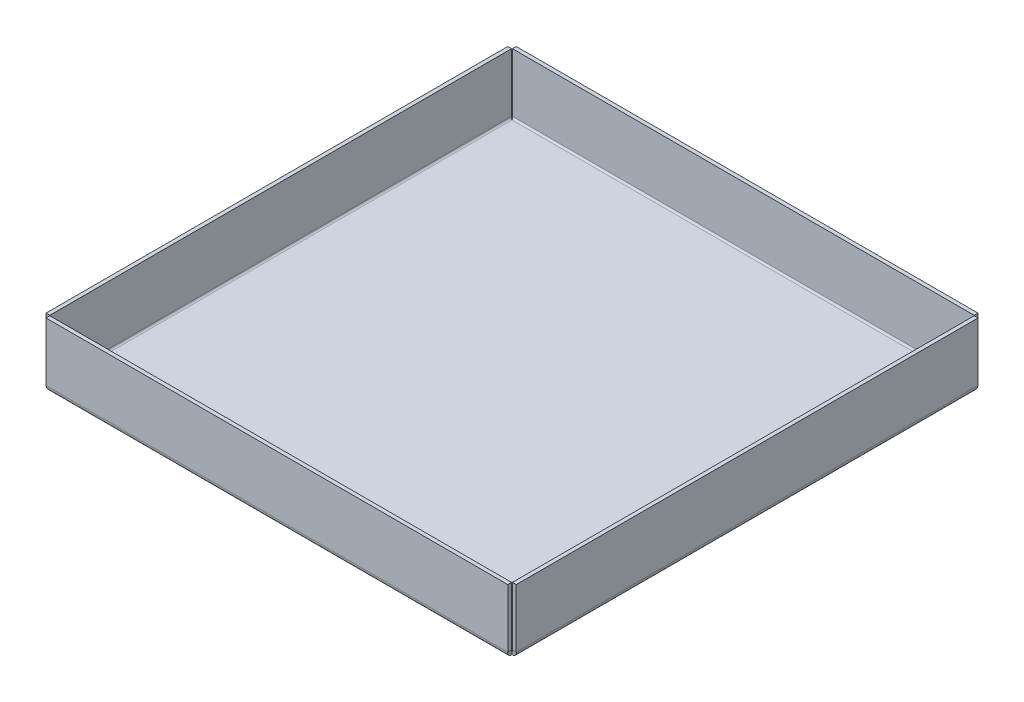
ISO-10303-21;
HEADER;
FILE_DESCRIPTION(('STEP AP214'),'2;1');
FILE_NAME('part.step','',(''),(''),'','','');
FILE_SCHEMA(('AUTOMOTIVE_DESIGN { 1 0 10303 214 1 1 1 1 }'));
ENDSEC;
DATA;
#1=APPLICATION_CONTEXT('core data for automotive mechanical design processes');
#2=APPLICATION_PROTOCOL_DEFINITION('international standard','automotive_design',2000,#1);
#3=PRODUCT_CONTEXT('',#1,'mechanical');
#4=PRODUCT('Part','Part','',(#3));
#5=PRODUCT_RELATED_PRODUCT_CATEGORY('part','',(#4));
#6=PRODUCT_DEFINITION_FORMATION('','',#4);
#7=PRODUCT_DEFINITION_CONTEXT('part definition',#1,'design');
#8=PRODUCT_DEFINITION('design','',#6,#7);
#9=PRODUCT_DEFINITION_SHAPE('','',#8);
#10=(LENGTH_UNIT() NAMED_UNIT(*) SI_UNIT(.MILLI.,.METRE.));
#11=(NAMED_UNIT(*) PLANE_ANGLE_UNIT() SI_UNIT($,.RADIAN.));
#12=(NAMED_UNIT(*) SI_UNIT($,.STERADIAN.) SOLID_ANGLE_UNIT());
#13=UNCERTAINTY_MEASURE_WITH_UNIT(LENGTH_MEASURE(1.E-05),#10,'distance_accuracy_value','');
#14=(GEOMETRIC_REPRESENTATION_CONTEXT(3) GLOBAL_UNCERTAINTY_ASSIGNED_CONTEXT((#13)) GLOBAL_UNIT_ASSIGNED_CONTEXT((#10,
#11,#12)) REPRESENTATION_CONTEXT('',''));
#15=CARTESIAN_POINT('',(0.,0.,0.));
#16=DIRECTION('',(0.,0.,1.));
#17=DIRECTION('',(1.,0.,0.));
#18=AXIS2_PLACEMENT_3D('',#15,#16,#17);
#19=CARTESIAN_POINT('',(0.,1.6002,-193.675));
#20=DIRECTION('',(0.,-1.,0.));
#21=DIRECTION('',(0.,0.,-1.));
#22=AXIS2_PLACEMENT_3D('',#19,#20,#21);
#23=PLANE('',#22);
#24=DIRECTION('',(0.,0.,1.));
#25=VECTOR('',#24,1.);
#26=CARTESIAN_POINT('',(0.,1.6002,0.));
#27=LINE('',#26,#25);
#28=CARTESIAN_POINT('',(0.,1.6002,-193.675));
#29=VERTEX_POINT('',#28);
#30=CARTESIAN_POINT('',(0.,1.6002,0.));
#31=VERTEX_POINT('',#30);
#32=EDGE_CURVE('E569',#29,#31,#27,.T.);
#33=ORIENTED_EDGE('',*,*,#32,.T.);
#34=DIRECTION('',(1.,0.,0.));
#35=VECTOR('',#34,1.);
#36=CARTESIAN_POINT('',(0.,1.6002,0.));
#37=LINE('',#36,#35);
#38=CARTESIAN_POINT('',(193.675,1.6002,0.));
#39=VERTEX_POINT('',#38);
#40=EDGE_CURVE('E576',#31,#39,#37,.T.);
#41=ORIENTED_EDGE('',*,*,#40,.T.);
#42=DIRECTION('',(0.,0.,-1.));
#43=VECTOR('',#42,1.);
#44=CARTESIAN_POINT('',(193.675,1.6002,0.));
#45=LINE('',#44,#43);
#46=CARTESIAN_POINT('',(193.675,1.6002,-193.675));
#47=VERTEX_POINT('',#46);
#48=EDGE_CURVE('E133',#39,#47,#45,.T.);
#49=ORIENTED_EDGE('',*,*,#48,.T.);
#50=DIRECTION('',(-1.,0.,0.));
#51=VECTOR('',#50,1.);
#52=CARTESIAN_POINT('',(0.,1.6002,-193.675));
#53=LINE('',#52,#51);
#54=EDGE_CURVE('E128',#47,#29,#53,.T.);
#55=ORIENTED_EDGE('',*,*,#54,.T.);
#56=EDGE_LOOP('',(#33,#41,#49,#55));
#57=FACE_BOUND('',#56,.T.);
#58=ADVANCED_FACE('F113',(#57),#23,.F.);
#59=CARTESIAN_POINT('',(0.,0.,-193.675));
#60=DIRECTION('',(0.,-1.,0.));
#61=DIRECTION('',(0.,0.,-1.));
#62=AXIS2_PLACEMENT_3D('',#59,#60,#61);
#63=PLANE('',#62);
#64=DIRECTION('',(0.,0.,1.));
#65=VECTOR('',#64,1.);
#66=CARTESIAN_POINT('',(0.,0.,0.));
#67=LINE('',#66,#65);
#68=CARTESIAN_POINT('',(0.,0.,-193.675));
#69=VERTEX_POINT('',#68);
#70=CARTESIAN_POINT('',(0.,0.,0.));
#71=VERTEX_POINT('',#70);
#72=EDGE_CURVE('E582',#69,#71,#67,.T.);
#73=ORIENTED_EDGE('',*,*,#72,.F.);
#74=DIRECTION('',(-1.,0.,0.));
#75=VECTOR('',#74,1.);
#76=CARTESIAN_POINT('',(0.,0.,-193.675));
#77=LINE('',#76,#75);
#78=CARTESIAN_POINT('',(193.675,0.,-193.675));
#79=VERTEX_POINT('',#78);
#80=EDGE_CURVE('E577',#79,#69,#77,.T.);
#81=ORIENTED_EDGE('',*,*,#80,.F.);
#82=DIRECTION('',(0.,0.,-1.));
#83=VECTOR('',#82,1.);
#84=CARTESIAN_POINT('',(193.675,0.,0.));
#85=LINE('',#84,#83);
#86=CARTESIAN_POINT('',(193.675,0.,0.));
#87=VERTEX_POINT('',#86);
#88=EDGE_CURVE('E588',#87,#79,#85,.T.);
#89=ORIENTED_EDGE('',*,*,#88,.F.);
#90=DIRECTION('',(1.,0.,0.));
#91=VECTOR('',#90,1.);
#92=CARTESIAN_POINT('',(0.,0.,0.));
#93=LINE('',#92,#91);
#94=EDGE_CURVE('E585',#71,#87,#93,.T.);
#95=ORIENTED_EDGE('',*,*,#94,.F.);
#96=EDGE_LOOP('',(#73,#81,#89,#95));
#97=FACE_BOUND('',#96,.T.);
#98=ADVANCED_FACE('F115',(#97),#63,.T.);
#99=CARTESIAN_POINT('',(0.,-0.0160020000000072,0.));
#100=CARTESIAN_POINT('',(-0.0464244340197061,-0.0160020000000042,0.308035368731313));
#101=CARTESIAN_POINT('',(-0.0928324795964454,0.0452351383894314,0.615840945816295));
#102=CARTESIAN_POINT('',(-0.185664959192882,0.280953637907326,1.18491574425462));
#103=CARTESIAN_POINT('',(-0.232081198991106,0.455342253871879,1.44590675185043));
#104=CARTESIAN_POINT('',(-0.324913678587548,0.890893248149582,1.88145774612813));
#105=CARTESIAN_POINT('',(-0.371329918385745,1.15188425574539,2.05584636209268));
#106=CARTESIAN_POINT('',(-0.464162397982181,1.72095905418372,2.29156486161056));
#107=CARTESIAN_POINT('',(-0.51057044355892,2.0287646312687,2.352802));
#108=CARTESIAN_POINT('',(-0.556994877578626,2.3368,2.352802));
#109=CARTESIAN_POINT('',(0.,0.,0.));
#110=CARTESIAN_POINT('',(-0.0464244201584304,0.,0.305940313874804));
#111=CARTESIAN_POINT('',(-0.0928324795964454,0.0608206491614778,0.611652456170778));
#112=CARTESIAN_POINT('',(-0.185664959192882,0.294935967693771,1.17685683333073));
#113=CARTESIAN_POINT('',(-0.232081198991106,0.468138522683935,1.43607277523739));
#114=CARTESIAN_POINT('',(-0.324913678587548,0.900727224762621,1.86866147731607));
#115=CARTESIAN_POINT('',(-0.371329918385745,1.15994316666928,2.04186403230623));
#116=CARTESIAN_POINT('',(-0.464162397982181,1.72514754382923,2.27597935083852));
#117=CARTESIAN_POINT('',(-0.510570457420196,2.03085968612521,2.3368));
#118=CARTESIAN_POINT('',(-0.556994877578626,2.3368,2.3368));
#119=CARTESIAN_POINT('',(0.,1.60019999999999,0.));
#120=CARTESIAN_POINT('',(-0.0464230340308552,1.60019999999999,0.0964348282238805));
#121=CARTESIAN_POINT('',(-0.0928324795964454,1.61937172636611,0.192803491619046));
#122=CARTESIAN_POINT('',(-0.185664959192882,1.69316894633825,0.370965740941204));
#123=CARTESIAN_POINT('',(-0.232081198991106,1.7477654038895,0.452675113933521));
#124=CARTESIAN_POINT('',(-0.324913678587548,1.88412488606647,0.589034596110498));
#125=CARTESIAN_POINT('',(-0.371329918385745,1.96583425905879,0.643631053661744));
#126=CARTESIAN_POINT('',(-0.464162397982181,2.14399650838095,0.717428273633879));
#127=CARTESIAN_POINT('',(-0.510571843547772,2.24036517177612,0.736599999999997));
#128=CARTESIAN_POINT('',(-0.556994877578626,2.3368,0.736599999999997));
#129=CARTESIAN_POINT('',(0.,1.61636201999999,0.));
#130=CARTESIAN_POINT('',(-0.0464230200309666,1.61636201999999,0.0943188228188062));
#131=CARTESIAN_POINT('',(-0.0928324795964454,1.63511309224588,0.188573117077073));
#132=CARTESIAN_POINT('',(-0.185664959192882,1.70729109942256,0.36282624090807));
#133=CARTESIAN_POINT('',(-0.232081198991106,1.76068963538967,0.442742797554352));
#134=CARTESIAN_POINT('',(-0.324913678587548,1.89405720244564,0.576110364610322));
#135=CARTESIAN_POINT('',(-0.371329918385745,1.97397375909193,0.629508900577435));
#136=CARTESIAN_POINT('',(-0.464162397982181,2.14822688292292,0.701686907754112));
#137=CARTESIAN_POINT('',(-0.510571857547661,2.24248117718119,0.720437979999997));
#138=CARTESIAN_POINT('',(-0.556994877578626,2.3368,0.720437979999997));
#139=B_SPLINE_SURFACE_WITH_KNOTS('',1,3,((#99,#100,#101,#102,#103,#104,#105,#106,#107,#108),
(#109,#110,#111,#112,#113,#114,#115,#116,#117,#118),(#119,#120,#121,#122,#123,#124,#125,#126,
#127,#128),(#129,#130,#131,#132,#133,#134,#135,#136,#137,#138)),.UNSPECIFIED.,.F.,.F.,.F.,(2,1,
1,2),(4,2,2,2,4),(-0.01,0.,1.,1.0101),(0.,0.25,0.5,0.75,1.),.UNSPECIFIED.);
#140=DIRECTION('',(0.,0.,-1.));
#141=VECTOR('',#140,1.);
#142=CARTESIAN_POINT('',(-0.556994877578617,2.3368,2.3368));
#143=LINE('',#142,#141);
#144=CARTESIAN_POINT('',(-0.556994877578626,2.3368,0.736599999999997));
#145=VERTEX_POINT('',#144);
#146=CARTESIAN_POINT('',(-0.556994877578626,2.3368,2.3368));
#147=VERTEX_POINT('',#146);
#148=EDGE_CURVE('E513',#145,#147,#143,.F.);
#149=CARTESIAN_POINT('',(0.,1.60019999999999,0.));
#150=CARTESIAN_POINT('',(-0.00580202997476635,1.6001997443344,0.0120526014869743));
#151=CARTESIAN_POINT('',(-0.0116040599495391,1.60049580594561,0.0241051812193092));
#152=CARTESIAN_POINT('',(-0.0232081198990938,1.60167872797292,0.0481813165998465));
#153=CARTESIAN_POINT('',(-0.0290101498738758,1.60256558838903,0.0602048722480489));
#154=CARTESIAN_POINT('',(-0.040614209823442,1.60492827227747,0.0841939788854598));
#155=CARTESIAN_POINT('',(-0.0464162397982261,1.60640409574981,0.0961595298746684));
#156=CARTESIAN_POINT('',(-0.0580202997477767,1.60994106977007,0.120003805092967));
#157=CARTESIAN_POINT('',(-0.0638223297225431,1.61200222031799,0.131882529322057));
#158=CARTESIAN_POINT('',(-0.0754263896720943,1.61670490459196,0.155524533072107));
#159=CARTESIAN_POINT('',(-0.081228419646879,1.619346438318,0.167287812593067));
#160=CARTESIAN_POINT('',(-0.0928324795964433,1.62520351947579,0.190670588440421));
#161=CARTESIAN_POINT('',(-0.0986345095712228,1.62841906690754,0.202290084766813));
#162=CARTESIAN_POINT('',(-0.110238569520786,1.63541643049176,0.22535730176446));
#163=CARTESIAN_POINT('',(-0.11604059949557,1.63919824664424,0.236805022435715));
#164=CARTESIAN_POINT('',(-0.127644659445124,1.64731903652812,0.2595011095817));
#165=CARTESIAN_POINT('',(-0.133446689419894,1.65165801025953,0.27074947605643));
#166=CARTESIAN_POINT('',(-0.145050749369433,1.66088266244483,0.293019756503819));
#167=CARTESIAN_POINT('',(-0.150852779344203,1.66576834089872,0.304041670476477));
#168=CARTESIAN_POINT('',(-0.162456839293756,1.67607463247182,0.325832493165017));
#169=CARTESIAN_POINT('',(-0.168258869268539,1.68149524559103,0.3366014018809));
#170=CARTESIAN_POINT('',(-0.179862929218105,1.69285834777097,0.357860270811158));
#171=CARTESIAN_POINT('',(-0.185664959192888,1.6988008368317,0.368350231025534));
#172=CARTESIAN_POINT('',(-0.197269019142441,1.71119337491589,0.389025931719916));
#173=CARTESIAN_POINT('',(-0.203071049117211,1.71764342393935,0.399211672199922));
#174=CARTESIAN_POINT('',(-0.214675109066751,1.73103554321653,0.419254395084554));
#175=CARTESIAN_POINT('',(-0.220477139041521,1.73797761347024,0.42911137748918));
#176=CARTESIAN_POINT('',(-0.232081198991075,1.75233705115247,0.448472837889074));
#177=CARTESIAN_POINT('',(-0.237883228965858,1.75975441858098,0.457977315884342));
#178=CARTESIAN_POINT('',(-0.249487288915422,1.77504658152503,0.476610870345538));
#179=CARTESIAN_POINT('',(-0.255289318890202,1.78292137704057,0.485739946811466));
#180=CARTESIAN_POINT('',(-0.266893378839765,1.7991094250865,0.503600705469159));
#181=CARTESIAN_POINT('',(-0.272695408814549,1.8074226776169,0.512332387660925));
#182=CARTESIAN_POINT('',(-0.284299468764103,1.82446761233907,0.529377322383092));
#183=CARTESIAN_POINT('',(-0.290101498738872,1.83319929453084,0.537690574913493));
#184=CARTESIAN_POINT('',(-0.301705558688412,1.85106005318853,0.55387862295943));
#185=CARTESIAN_POINT('',(-0.307507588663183,1.86018912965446,0.561753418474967));
#186=CARTESIAN_POINT('',(-0.319111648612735,1.87882268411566,0.577045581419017));
#187=CARTESIAN_POINT('',(-0.324913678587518,1.88832716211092,0.584462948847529));
#188=CARTESIAN_POINT('',(-0.336517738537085,1.90768862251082,0.598822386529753));
#189=CARTESIAN_POINT('',(-0.34231976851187,1.91754560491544,0.605764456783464));
#190=CARTESIAN_POINT('',(-0.353923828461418,1.93758832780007,0.61915657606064));
#191=CARTESIAN_POINT('',(-0.35972585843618,1.94777406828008,0.625606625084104));
#192=CARTESIAN_POINT('',(-0.371329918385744,1.96844976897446,0.637999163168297));
#193=CARTESIAN_POINT('',(-0.377131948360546,1.97893972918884,0.643941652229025));
#194=CARTESIAN_POINT('',(-0.388736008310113,2.00019859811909,0.655304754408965));
#195=CARTESIAN_POINT('',(-0.394538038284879,2.01096750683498,0.660725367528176));
#196=CARTESIAN_POINT('',(-0.406142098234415,2.03275832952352,0.671031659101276));
#197=CARTESIAN_POINT('',(-0.411944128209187,2.04378024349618,0.675917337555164));
#198=CARTESIAN_POINT('',(-0.42354818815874,2.06605052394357,0.68514198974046));
#199=CARTESIAN_POINT('',(-0.429350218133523,2.0772988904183,0.689480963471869));
#200=CARTESIAN_POINT('',(-0.440954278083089,2.09999497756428,0.697601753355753));
#201=CARTESIAN_POINT('',(-0.446756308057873,2.11144269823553,0.701383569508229));
#202=CARTESIAN_POINT('',(-0.458360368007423,2.13450991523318,0.708380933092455));
#203=CARTESIAN_POINT('',(-0.464162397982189,2.14612941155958,0.711596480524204));
#204=CARTESIAN_POINT('',(-0.475766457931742,2.16951218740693,0.717453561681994));
#205=CARTESIAN_POINT('',(-0.481568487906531,2.18127546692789,0.720095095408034));
#206=CARTESIAN_POINT('',(-0.493172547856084,2.20491747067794,0.724797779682));
#207=CARTESIAN_POINT('',(-0.49897457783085,2.21679619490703,0.726858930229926));
#208=CARTESIAN_POINT('',(-0.5105786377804,2.24064047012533,0.730395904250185));
#209=CARTESIAN_POINT('',(-0.516380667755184,2.25260602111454,0.731871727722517));
#210=CARTESIAN_POINT('',(-0.52798472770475,2.27659512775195,0.734234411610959));
#211=CARTESIAN_POINT('',(-0.533786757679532,2.28861868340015,0.73512127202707));
#212=CARTESIAN_POINT('',(-0.545390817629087,2.31269481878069,0.736304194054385));
#213=CARTESIAN_POINT('',(-0.55119284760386,2.32474739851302,0.736600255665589));
#214=CARTESIAN_POINT('',(-0.556994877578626,2.3368,0.736599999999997));
#215=B_SPLINE_CURVE_WITH_KNOTS('',3,(#149,#150,#151,#152,#153,#154,#155,#156,#157,#158,#159,
#160,#161,#162,#163,#164,#165,#166,#167,#168,#169,#170,#171,#172,#173,#174,#175,#176,#177,#178,
#179,#180,#181,#182,#183,#184,#185,#186,#187,#188,#189,#190,#191,#192,#193,#194,#195,#196,#197,
#198,#199,#200,#201,#202,#203,#204,#205,#206,#207,#208,#209,#210,#211,#212,#213,#214),
.UNSPECIFIED.,.F.,.F.,(4,2,2,2,2,2,2,2,2,2,2,2,2,2,2,2,2,2,2,2,2,2,2,2,2,2,2,2,2,2,2,2,4),(0.,
0.0401259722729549,0.0802519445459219,0.120377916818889,0.160503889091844,0.200629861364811,
0.240755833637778,0.280881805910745,0.3210077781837,0.361133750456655,0.401259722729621,
0.441385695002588,0.481511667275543,0.521637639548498,0.561763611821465,0.601889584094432,
0.642015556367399,0.682141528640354,0.722267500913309,0.762393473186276,0.802519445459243,
0.842645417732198,0.882771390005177,0.922897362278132,0.963023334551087,1.00314930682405,
1.04327527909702,1.08340125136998,1.12352722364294,1.1636531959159,1.20377916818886,
1.24390514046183,1.28403111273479),.UNSPECIFIED.);
#216=EDGE_CURVE('E528',#31,#145,#215,.T.);
#217=DIRECTION('',(0.,-1.,0.));
#218=VECTOR('',#217,1.);
#219=CARTESIAN_POINT('',(0.,1.6002,0.));
#220=LINE('',#219,#218);
#221=EDGE_CURVE('E13',#31,#71,#220,.T.);
#222=CARTESIAN_POINT('',(0.,0.,0.));
#223=CARTESIAN_POINT('',(-0.00580202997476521,-8.11077055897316E-07,0.0382358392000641));
#224=CARTESIAN_POINT('',(-0.0116040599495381,0.000938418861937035,0.0764716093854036));
#225=CARTESIAN_POINT('',(-0.0232081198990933,0.00469113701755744,0.152851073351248));
#226=CARTESIAN_POINT('',(-0.0290101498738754,0.00750462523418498,0.190994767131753));
#227=CARTESIAN_POINT('',(-0.0406142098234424,0.0150000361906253,0.26709813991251));
#228=CARTESIAN_POINT('',(-0.0464162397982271,0.0196819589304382,0.305057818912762));
#229=CARTESIAN_POINT('',(-0.0580202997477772,0.030902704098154,0.380701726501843));
#230=CARTESIAN_POINT('',(-0.0638223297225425,0.0374415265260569,0.418385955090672));
#231=CARTESIAN_POINT('',(-0.0754263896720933,0.0523603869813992,0.493388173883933));
#232=CARTESIAN_POINT('',(-0.0812284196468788,0.0607404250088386,0.530706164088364));
#233=CARTESIAN_POINT('',(-0.0928324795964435,0.0793215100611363,0.604886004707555));
#234=CARTESIAN_POINT('',(-0.0986345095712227,0.0895225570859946,0.641747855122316));
#235=CARTESIAN_POINT('',(-0.110238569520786,0.111721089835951,0.714926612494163));
#236=CARTESIAN_POINT('',(-0.116040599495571,0.12371857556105,0.751243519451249));
#237=CARTESIAN_POINT('',(-0.127644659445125,0.149481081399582,0.823244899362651));
#238=CARTESIAN_POINT('',(-0.133446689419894,0.163246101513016,0.858929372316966));
#239=CARTESIAN_POINT('',(-0.145050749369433,0.192510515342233,0.929579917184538));
#240=CARTESIAN_POINT('',(-0.150852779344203,0.208009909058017,0.964545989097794));
#241=CARTESIAN_POINT('',(-0.162456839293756,0.24070573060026,1.03367549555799));
#242=CARTESIAN_POINT('',(-0.168258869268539,0.25790215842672,1.06783893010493));
#243=CARTESIAN_POINT('',(-0.179862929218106,0.293950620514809,1.13528085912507));
#244=CARTESIAN_POINT('',(-0.185664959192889,0.312802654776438,1.16855935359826));
#245=CARTESIAN_POINT('',(-0.197269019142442,0.352116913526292,1.2341512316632));
#246=CARTESIAN_POINT('',(-0.203071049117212,0.372579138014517,1.26646461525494));
#247=CARTESIAN_POINT('',(-0.214675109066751,0.415064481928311,1.33004842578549));
#248=CARTESIAN_POINT('',(-0.22047713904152,0.43708760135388,1.3613188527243));
#249=CARTESIAN_POINT('',(-0.232081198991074,0.482641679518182,1.42274141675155));
#250=CARTESIAN_POINT('',(-0.237883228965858,0.506172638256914,1.45289355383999));
#251=CARTESIAN_POINT('',(-0.249487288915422,0.554685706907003,1.51200689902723));
#252=CARTESIAN_POINT('',(-0.255289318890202,0.579667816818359,1.54096810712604));
#253=CARTESIAN_POINT('',(-0.266893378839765,0.631023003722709,1.597629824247));
#254=CARTESIAN_POINT('',(-0.27269540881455,0.657396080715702,1.62533033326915));
#255=CARTESIAN_POINT('',(-0.284299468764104,0.711469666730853,1.6794039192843));
#256=CARTESIAN_POINT('',(-0.290101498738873,0.739170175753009,1.7057769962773));
#257=CARTESIAN_POINT('',(-0.301705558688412,0.79583189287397,1.75713218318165));
#258=CARTESIAN_POINT('',(-0.307507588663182,0.824793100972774,1.782114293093));
#259=CARTESIAN_POINT('',(-0.319111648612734,0.883906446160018,1.83062736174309));
#260=CARTESIAN_POINT('',(-0.324913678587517,0.914058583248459,1.85415832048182));
#261=CARTESIAN_POINT('',(-0.336517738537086,0.975481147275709,1.89971239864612));
#262=CARTESIAN_POINT('',(-0.342319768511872,1.00675157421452,1.92173551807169));
#263=CARTESIAN_POINT('',(-0.353923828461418,1.07033538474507,1.96422086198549));
#264=CARTESIAN_POINT('',(-0.359725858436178,1.10264876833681,1.98468308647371));
#265=CARTESIAN_POINT('',(-0.371329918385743,1.16824064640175,2.02399734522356));
#266=CARTESIAN_POINT('',(-0.377131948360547,1.20151914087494,2.04284937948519));
#267=CARTESIAN_POINT('',(-0.388736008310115,1.26896106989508,2.07889784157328));
#268=CARTESIAN_POINT('',(-0.394538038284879,1.30312450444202,2.09609426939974));
#269=CARTESIAN_POINT('',(-0.406142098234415,1.37225401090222,2.12879009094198));
#270=CARTESIAN_POINT('',(-0.411944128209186,1.40722008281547,2.14428948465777));
#271=CARTESIAN_POINT('',(-0.42354818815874,1.47787062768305,2.17355389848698));
#272=CARTESIAN_POINT('',(-0.429350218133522,1.51355510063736,2.18731891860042));
#273=CARTESIAN_POINT('',(-0.44095427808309,1.58555648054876,2.21308142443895));
#274=CARTESIAN_POINT('',(-0.446756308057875,1.62187338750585,2.22507891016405));
#275=CARTESIAN_POINT('',(-0.458360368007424,1.6950521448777,2.247277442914));
#276=CARTESIAN_POINT('',(-0.464162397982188,1.73191399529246,2.25747848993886));
#277=CARTESIAN_POINT('',(-0.475766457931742,1.80609383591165,2.27605957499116));
#278=CARTESIAN_POINT('',(-0.481568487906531,1.84341182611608,2.2844396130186));
#279=CARTESIAN_POINT('',(-0.493172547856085,1.91841404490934,2.29935847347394));
#280=CARTESIAN_POINT('',(-0.498974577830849,1.95609827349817,2.30589729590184));
#281=CARTESIAN_POINT('',(-0.510578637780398,2.03174218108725,2.31711804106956));
#282=CARTESIAN_POINT('',(-0.516380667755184,2.0697018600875,2.32179996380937));
#283=CARTESIAN_POINT('',(-0.527984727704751,2.14580523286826,2.32929537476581));
#284=CARTESIAN_POINT('',(-0.533786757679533,2.18394892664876,2.33210886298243));
#285=CARTESIAN_POINT('',(-0.545390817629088,2.26032839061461,2.33586158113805));
#286=CARTESIAN_POINT('',(-0.551192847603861,2.29856416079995,2.33680081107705));
#287=CARTESIAN_POINT('',(-0.556994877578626,2.3368,2.3368));
#288=B_SPLINE_CURVE_WITH_KNOTS('',3,(#222,#223,#224,#225,#226,#227,#228,#229,#230,#231,#232,
#233,#234,#235,#236,#237,#238,#239,#240,#241,#242,#243,#244,#245,#246,#247,#248,#249,#250,#251,
#252,#253,#254,#255,#256,#257,#258,#259,#260,#261,#262,#263,#264,#265,#266,#267,#268,#269,#270,
#271,#272,#273,#274,#275,#276,#277,#278,#279,#280,#281,#282,#283,#284,#285,#286,#287),
.UNSPECIFIED.,.F.,.F.,(4,2,2,2,2,2,2,2,2,2,2,2,2,2,2,2,2,2,2,2,2,2,2,2,2,2,2,2,2,2,2,2,4),(0.,
0.116009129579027,0.232018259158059,0.348027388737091,0.464036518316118,0.58004564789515,
0.696054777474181,0.812063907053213,0.92807303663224,1.04408216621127,1.1600912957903,
1.27610042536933,1.39210955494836,1.50811868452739,1.62412781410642,1.74013694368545,
1.85614607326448,1.97215520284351,2.08816433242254,2.20417346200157,2.3201825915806,
2.43619172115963,2.55220085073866,2.66820998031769,2.78421910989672,2.90022823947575,
3.01623736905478,3.13224649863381,3.24825562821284,3.36426475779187,3.4802738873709,
3.59628301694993,3.71229214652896),.UNSPECIFIED.);
#289=EDGE_CURVE('E534',#71,#147,#288,.T.);
#290=ORIENTED_EDGE('',*,*,#148,.F.);
#291=ORIENTED_EDGE('',*,*,#216,.F.);
#292=ORIENTED_EDGE('',*,*,#221,.T.);
#293=ORIENTED_EDGE('',*,*,#289,.T.);
#294=EDGE_LOOP('',(#290,#291,#292,#293));
#295=FACE_BOUND('',#294,.T.);
#296=ADVANCED_FACE('F553',(#295),#139,.F.);
#297=CARTESIAN_POINT('',(194.231994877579,2.3368,2.35280200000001));
#298=CARTESIAN_POINT('',(194.185570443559,2.02876463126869,2.35280200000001));
#299=CARTESIAN_POINT('',(194.139162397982,1.72095905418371,2.29156486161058));
#300=CARTESIAN_POINT('',(194.046329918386,1.15188425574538,2.05584636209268));
#301=CARTESIAN_POINT('',(193.999913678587,0.890893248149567,1.88145774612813));
#302=CARTESIAN_POINT('',(193.907081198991,0.455342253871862,1.44590675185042));
#303=CARTESIAN_POINT('',(193.860664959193,0.280953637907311,1.18491574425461));
#304=CARTESIAN_POINT('',(193.767832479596,0.0452351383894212,0.615840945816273));
#305=CARTESIAN_POINT('',(193.72142443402,-0.0160020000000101,0.308035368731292));
#306=CARTESIAN_POINT('',(193.675,-0.0160020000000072,0.));
#307=CARTESIAN_POINT('',(194.231994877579,2.3368,2.33680000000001));
#308=CARTESIAN_POINT('',(194.18557045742,2.0308596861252,2.33680000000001));
#309=CARTESIAN_POINT('',(194.139162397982,1.72514754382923,2.27597935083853));
#310=CARTESIAN_POINT('',(194.046329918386,1.15994316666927,2.04186403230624));
#311=CARTESIAN_POINT('',(193.999913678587,0.900727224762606,1.86866147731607));
#312=CARTESIAN_POINT('',(193.907081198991,0.468138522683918,1.43607277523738));
#313=CARTESIAN_POINT('',(193.860664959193,0.294935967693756,1.17685683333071));
#314=CARTESIAN_POINT('',(193.767832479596,0.0608206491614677,0.611652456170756));
#315=CARTESIAN_POINT('',(193.721424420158,0.,0.305940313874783));
#316=CARTESIAN_POINT('',(193.675,0.,0.));
#317=CARTESIAN_POINT('',(194.231994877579,2.3368,0.736600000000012));
#318=CARTESIAN_POINT('',(194.185571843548,2.2403651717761,0.736600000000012));
#319=CARTESIAN_POINT('',(194.139162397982,2.14399650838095,0.717428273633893));
#320=CARTESIAN_POINT('',(194.046329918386,1.96583425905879,0.643631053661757));
#321=CARTESIAN_POINT('',(193.999913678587,1.88412488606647,0.589034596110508));
#322=CARTESIAN_POINT('',(193.907081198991,1.74776540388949,0.452675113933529));
#323=CARTESIAN_POINT('',(193.860664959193,1.69316894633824,0.37096574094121));
#324=CARTESIAN_POINT('',(193.767832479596,1.61937172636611,0.192803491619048));
#325=CARTESIAN_POINT('',(193.721423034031,1.60019999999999,0.0964348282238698));
#326=CARTESIAN_POINT('',(193.675,1.60019999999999,0.));
#327=CARTESIAN_POINT('',(194.231994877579,2.3368,0.720437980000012));
#328=CARTESIAN_POINT('',(194.185571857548,2.24248117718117,0.720437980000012));
#329=CARTESIAN_POINT('',(194.139162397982,2.14822688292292,0.701686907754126));
#330=CARTESIAN_POINT('',(194.046329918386,1.97397375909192,0.629508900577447));
#331=CARTESIAN_POINT('',(193.999913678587,1.89405720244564,0.576110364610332));
#332=CARTESIAN_POINT('',(193.907081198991,1.76068963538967,0.44274279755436));
#333=CARTESIAN_POINT('',(193.860664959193,1.70729109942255,0.362826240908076));
#334=CARTESIAN_POINT('',(193.767832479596,1.63511309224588,0.188573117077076));
#335=CARTESIAN_POINT('',(193.721423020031,1.61636201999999,0.0943188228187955));
#336=CARTESIAN_POINT('',(193.675,1.61636201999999,0.));
#337=B_SPLINE_SURFACE_WITH_KNOTS('',1,3,((#297,#298,#299,#300,#301,#302,#303,#304,#305,#306),
(#307,#308,#309,#310,#311,#312,#313,#314,#315,#316),(#317,#318,#319,#320,#321,#322,#323,#324,
#325,#326),(#327,#328,#329,#330,#331,#332,#333,#334,#335,#336)),.UNSPECIFIED.,.F.,.F.,.F.,(2,1,
1,2),(4,2,2,2,4),(-0.01,0.,1.,1.0101),(0.,0.25,0.5,0.75,1.),.UNSPECIFIED.);
#338=CARTESIAN_POINT('',(194.231994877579,2.3368,0.736600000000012));
#339=CARTESIAN_POINT('',(194.226192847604,2.32474739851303,0.736600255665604));
#340=CARTESIAN_POINT('',(194.220390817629,2.31269481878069,0.7363041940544));
#341=CARTESIAN_POINT('',(194.208786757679,2.28861868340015,0.735121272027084));
#342=CARTESIAN_POINT('',(194.202984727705,2.27659512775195,0.734234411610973));
#343=CARTESIAN_POINT('',(194.191380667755,2.25260602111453,0.731871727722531));
#344=CARTESIAN_POINT('',(194.18557863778,2.24064047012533,0.730395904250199));
#345=CARTESIAN_POINT('',(194.173974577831,2.21679619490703,0.72685893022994));
#346=CARTESIAN_POINT('',(194.168172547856,2.20491747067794,0.724797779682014));
#347=CARTESIAN_POINT('',(194.156568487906,2.18127546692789,0.720095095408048));
#348=CARTESIAN_POINT('',(194.150766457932,2.16951218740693,0.717453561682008));
#349=CARTESIAN_POINT('',(194.139162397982,2.14612941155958,0.711596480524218));
#350=CARTESIAN_POINT('',(194.133360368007,2.13450991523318,0.708380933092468));
#351=CARTESIAN_POINT('',(194.121756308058,2.11144269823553,0.701383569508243));
#352=CARTESIAN_POINT('',(194.115954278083,2.09999497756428,0.697601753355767));
#353=CARTESIAN_POINT('',(194.104350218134,2.07729889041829,0.689480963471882));
#354=CARTESIAN_POINT('',(194.098548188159,2.06605052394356,0.685141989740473));
#355=CARTESIAN_POINT('',(194.086944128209,2.04378024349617,0.675917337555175));
#356=CARTESIAN_POINT('',(194.081142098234,2.03275832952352,0.671031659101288));
#357=CARTESIAN_POINT('',(194.069538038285,2.01096750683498,0.66072536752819));
#358=CARTESIAN_POINT('',(194.06373600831,2.0001985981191,0.655304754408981));
#359=CARTESIAN_POINT('',(194.05213194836,1.97893972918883,0.643941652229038));
#360=CARTESIAN_POINT('',(194.046329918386,1.96844976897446,0.637999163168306));
#361=CARTESIAN_POINT('',(194.034725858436,1.94777406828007,0.625606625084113));
#362=CARTESIAN_POINT('',(194.028923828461,1.93758832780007,0.619156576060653));
#363=CARTESIAN_POINT('',(194.017319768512,1.91754560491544,0.605764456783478));
#364=CARTESIAN_POINT('',(194.011517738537,1.90768862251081,0.598822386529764));
#365=CARTESIAN_POINT('',(193.999913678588,1.88832716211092,0.584462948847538));
#366=CARTESIAN_POINT('',(193.994111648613,1.87882268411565,0.577045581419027));
#367=CARTESIAN_POINT('',(193.982507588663,1.86018912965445,0.561753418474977));
#368=CARTESIAN_POINT('',(193.976705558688,1.85106005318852,0.553878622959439));
#369=CARTESIAN_POINT('',(193.965101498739,1.83319929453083,0.537690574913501));
#370=CARTESIAN_POINT('',(193.959299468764,1.82446761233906,0.529377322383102));
#371=CARTESIAN_POINT('',(193.947695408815,1.8074226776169,0.512332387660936));
#372=CARTESIAN_POINT('',(193.94189337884,1.7991094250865,0.50360070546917));
#373=CARTESIAN_POINT('',(193.93028931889,1.78292137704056,0.485739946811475));
#374=CARTESIAN_POINT('',(193.924487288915,1.77504658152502,0.476610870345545));
#375=CARTESIAN_POINT('',(193.912883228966,1.75975441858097,0.457977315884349));
#376=CARTESIAN_POINT('',(193.907081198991,1.75233705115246,0.448472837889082));
#377=CARTESIAN_POINT('',(193.895477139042,1.73797761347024,0.429111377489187));
#378=CARTESIAN_POINT('',(193.889675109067,1.73103554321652,0.419254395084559));
#379=CARTESIAN_POINT('',(193.878071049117,1.71764342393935,0.399211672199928));
#380=CARTESIAN_POINT('',(193.872269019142,1.71119337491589,0.389025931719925));
#381=CARTESIAN_POINT('',(193.860664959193,1.6988008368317,0.368350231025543));
#382=CARTESIAN_POINT('',(193.854862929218,1.69285834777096,0.357860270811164));
#383=CARTESIAN_POINT('',(193.843258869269,1.68149524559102,0.336601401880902));
#384=CARTESIAN_POINT('',(193.837456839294,1.67607463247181,0.32583249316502));
#385=CARTESIAN_POINT('',(193.825852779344,1.66576834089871,0.304041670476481));
#386=CARTESIAN_POINT('',(193.820050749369,1.66088266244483,0.293019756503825));
#387=CARTESIAN_POINT('',(193.80844668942,1.65165801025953,0.270749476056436));
#388=CARTESIAN_POINT('',(193.802644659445,1.64731903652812,0.259501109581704));
#389=CARTESIAN_POINT('',(193.791040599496,1.63919824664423,0.236805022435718));
#390=CARTESIAN_POINT('',(193.785238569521,1.63541643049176,0.225357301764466));
#391=CARTESIAN_POINT('',(193.773634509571,1.62841906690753,0.202290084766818));
#392=CARTESIAN_POINT('',(193.767832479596,1.62520351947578,0.190670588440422));
#393=CARTESIAN_POINT('',(193.756228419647,1.619346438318,0.167287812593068));
#394=CARTESIAN_POINT('',(193.750426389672,1.61670490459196,0.155524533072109));
#395=CARTESIAN_POINT('',(193.738822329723,1.61200222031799,0.131882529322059));
#396=CARTESIAN_POINT('',(193.733020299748,1.60994106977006,0.120003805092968));
#397=CARTESIAN_POINT('',(193.721416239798,1.6064040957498,0.0961595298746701));
#398=CARTESIAN_POINT('',(193.715614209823,1.60492827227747,0.0841939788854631));
#399=CARTESIAN_POINT('',(193.704010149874,1.60256558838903,0.060204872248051));
#400=CARTESIAN_POINT('',(193.698208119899,1.60167872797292,0.048181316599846));
#401=CARTESIAN_POINT('',(193.68660405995,1.6004958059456,0.0241051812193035));
#402=CARTESIAN_POINT('',(193.680802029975,1.6001997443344,0.0120526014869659));
#403=CARTESIAN_POINT('',(193.675,1.60019999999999,0.));
#404=B_SPLINE_CURVE_WITH_KNOTS('',3,(#338,#339,#340,#341,#342,#343,#344,#345,#346,#347,#348,
#349,#350,#351,#352,#353,#354,#355,#356,#357,#358,#359,#360,#361,#362,#363,#364,#365,#366,#367,
#368,#369,#370,#371,#372,#373,#374,#375,#376,#377,#378,#379,#380,#381,#382,#383,#384,#385,#386,
#387,#388,#389,#390,#391,#392,#393,#394,#395,#396,#397,#398,#399,#400,#401,#402,#403),
.UNSPECIFIED.,.F.,.F.,(4,2,2,2,2,2,2,2,2,2,2,2,2,2,2,2,2,2,2,2,2,2,2,2,2,2,2,2,2,2,2,2,4),(0.,
0.0401259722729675,0.0802519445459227,0.12037791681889,0.160503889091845,0.200629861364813,
0.240755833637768,0.280881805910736,0.321007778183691,0.361133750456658,0.401259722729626,
0.441385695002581,0.481511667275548,0.521637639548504,0.561763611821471,0.601889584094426,
0.642015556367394,0.682141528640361,0.722267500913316,0.762393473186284,0.802519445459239,
0.842645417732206,0.882771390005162,0.922897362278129,0.963023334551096,1.00314930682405,
1.04327527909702,1.08340125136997,1.12352722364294,1.1636531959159,1.20377916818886,
1.24390514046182,1.28403111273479),.UNSPECIFIED.);
#405=CARTESIAN_POINT('',(194.231994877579,2.3368,0.736600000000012));
#406=VERTEX_POINT('',#405);
#407=EDGE_CURVE('E497',#406,#39,#404,.T.);
#408=DIRECTION('',(0.,0.,-1.));
#409=VECTOR('',#408,1.);
#410=CARTESIAN_POINT('',(194.231994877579,2.3368,0.7366));
#411=LINE('',#410,#409);
#412=CARTESIAN_POINT('',(194.231994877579,2.3368,2.3368));
#413=VERTEX_POINT('',#412);
#414=EDGE_CURVE('E525',#406,#413,#411,.F.);
#415=CARTESIAN_POINT('',(194.231994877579,2.3368,2.33680000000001));
#416=CARTESIAN_POINT('',(194.226192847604,2.29856416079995,2.33680081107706));
#417=CARTESIAN_POINT('',(194.220390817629,2.26032839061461,2.33586158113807));
#418=CARTESIAN_POINT('',(194.208786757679,2.18394892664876,2.33210886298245));
#419=CARTESIAN_POINT('',(194.202984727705,2.14580523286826,2.32929537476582));
#420=CARTESIAN_POINT('',(194.191380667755,2.0697018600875,2.32179996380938));
#421=CARTESIAN_POINT('',(194.18557863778,2.03174218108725,2.31711804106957));
#422=CARTESIAN_POINT('',(194.173974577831,1.95609827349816,2.30589729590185));
#423=CARTESIAN_POINT('',(194.168172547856,1.91841404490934,2.29935847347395));
#424=CARTESIAN_POINT('',(194.156568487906,1.84341182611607,2.28443961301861));
#425=CARTESIAN_POINT('',(194.150766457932,1.80609383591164,2.27605957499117));
#426=CARTESIAN_POINT('',(194.139162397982,1.73191399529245,2.25747848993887));
#427=CARTESIAN_POINT('',(194.133360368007,1.69505214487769,2.24727744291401));
#428=CARTESIAN_POINT('',(194.121756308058,1.62187338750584,2.22507891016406));
#429=CARTESIAN_POINT('',(194.115954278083,1.58555648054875,2.21308142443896));
#430=CARTESIAN_POINT('',(194.104350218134,1.51355510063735,2.18731891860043));
#431=CARTESIAN_POINT('',(194.098548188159,1.47787062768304,2.17355389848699));
#432=CARTESIAN_POINT('',(194.086944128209,1.40722008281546,2.14428948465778));
#433=CARTESIAN_POINT('',(194.081142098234,1.37225401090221,2.12879009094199));
#434=CARTESIAN_POINT('',(194.069538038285,1.30312450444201,2.09609426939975));
#435=CARTESIAN_POINT('',(194.06373600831,1.26896106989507,2.07889784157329));
#436=CARTESIAN_POINT('',(194.05213194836,1.20151914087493,2.0428493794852));
#437=CARTESIAN_POINT('',(194.046329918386,1.16824064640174,2.02399734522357));
#438=CARTESIAN_POINT('',(194.034725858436,1.1026487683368,1.98468308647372));
#439=CARTESIAN_POINT('',(194.028923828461,1.07033538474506,1.96422086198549));
#440=CARTESIAN_POINT('',(194.017319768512,1.00675157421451,1.9217355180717));
#441=CARTESIAN_POINT('',(194.011517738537,0.975481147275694,1.89971239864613));
#442=CARTESIAN_POINT('',(193.999913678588,0.914058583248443,1.85415832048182));
#443=CARTESIAN_POINT('',(193.994111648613,0.883906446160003,1.83062736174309));
#444=CARTESIAN_POINT('',(193.982507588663,0.824793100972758,1.782114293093));
#445=CARTESIAN_POINT('',(193.976705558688,0.795831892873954,1.75713218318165));
#446=CARTESIAN_POINT('',(193.965101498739,0.739170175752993,1.7057769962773));
#447=CARTESIAN_POINT('',(193.959299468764,0.711469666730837,1.6794039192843));
#448=CARTESIAN_POINT('',(193.947695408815,0.657396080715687,1.62533033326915));
#449=CARTESIAN_POINT('',(193.94189337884,0.631023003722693,1.59762982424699));
#450=CARTESIAN_POINT('',(193.93028931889,0.579667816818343,1.54096810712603));
#451=CARTESIAN_POINT('',(193.924487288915,0.554685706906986,1.51200689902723));
#452=CARTESIAN_POINT('',(193.912883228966,0.506172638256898,1.45289355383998));
#453=CARTESIAN_POINT('',(193.907081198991,0.482641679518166,1.42274141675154));
#454=CARTESIAN_POINT('',(193.895477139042,0.437087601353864,1.36131885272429));
#455=CARTESIAN_POINT('',(193.889675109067,0.415064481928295,1.33004842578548));
#456=CARTESIAN_POINT('',(193.878071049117,0.372579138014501,1.26646461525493));
#457=CARTESIAN_POINT('',(193.872269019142,0.352116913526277,1.23415123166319));
#458=CARTESIAN_POINT('',(193.860664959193,0.312802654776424,1.16855935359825));
#459=CARTESIAN_POINT('',(193.854862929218,0.293950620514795,1.13528085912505));
#460=CARTESIAN_POINT('',(193.843258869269,0.257902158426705,1.06783893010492));
#461=CARTESIAN_POINT('',(193.837456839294,0.240705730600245,1.03367549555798));
#462=CARTESIAN_POINT('',(193.825852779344,0.208009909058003,0.964545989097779));
#463=CARTESIAN_POINT('',(193.820050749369,0.192510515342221,0.929579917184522));
#464=CARTESIAN_POINT('',(193.80844668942,0.163246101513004,0.858929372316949));
#465=CARTESIAN_POINT('',(193.802644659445,0.14948108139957,0.823244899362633));
#466=CARTESIAN_POINT('',(193.791040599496,0.123718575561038,0.75124351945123));
#467=CARTESIAN_POINT('',(193.785238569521,0.11172108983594,0.714926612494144));
#468=CARTESIAN_POINT('',(193.773634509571,0.0895225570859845,0.641747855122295));
#469=CARTESIAN_POINT('',(193.767832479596,0.0793215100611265,0.604886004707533));
#470=CARTESIAN_POINT('',(193.756228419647,0.0607404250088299,0.530706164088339));
#471=CARTESIAN_POINT('',(193.750426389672,0.0523603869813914,0.493388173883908));
#472=CARTESIAN_POINT('',(193.738822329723,0.0374415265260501,0.418385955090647));
#473=CARTESIAN_POINT('',(193.733020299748,0.0309027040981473,0.380701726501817));
#474=CARTESIAN_POINT('',(193.721416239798,0.0196819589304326,0.305057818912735));
#475=CARTESIAN_POINT('',(193.715614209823,0.0150000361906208,0.267098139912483));
#476=CARTESIAN_POINT('',(193.704010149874,0.00750462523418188,0.190994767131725));
#477=CARTESIAN_POINT('',(193.698208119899,0.00469113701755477,0.152851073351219));
#478=CARTESIAN_POINT('',(193.68660405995,0.000938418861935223,0.0764716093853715));
#479=CARTESIAN_POINT('',(193.680802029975,-8.1107705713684E-07,0.0382358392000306));
#480=CARTESIAN_POINT('',(193.675,0.,0.));
#481=B_SPLINE_CURVE_WITH_KNOTS('',3,(#415,#416,#417,#418,#419,#420,#421,#422,#423,#424,#425,
#426,#427,#428,#429,#430,#431,#432,#433,#434,#435,#436,#437,#438,#439,#440,#441,#442,#443,#444,
#445,#446,#447,#448,#449,#450,#451,#452,#453,#454,#455,#456,#457,#458,#459,#460,#461,#462,#463,
#464,#465,#466,#467,#468,#469,#470,#471,#472,#473,#474,#475,#476,#477,#478,#479,#480),
.UNSPECIFIED.,.F.,.F.,(4,2,2,2,2,2,2,2,2,2,2,2,2,2,2,2,2,2,2,2,2,2,2,2,2,2,2,2,2,2,2,2,4),(0.,
0.116009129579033,0.232018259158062,0.348027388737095,0.464036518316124,0.580045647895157,
0.696054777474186,0.812063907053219,0.928073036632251,1.04408216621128,1.16009129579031,
1.27610042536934,1.39210955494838,1.5081186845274,1.62412781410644,1.74013694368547,
1.8561460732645,1.97215520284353,2.08816433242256,2.20417346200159,2.32018259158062,
2.43619172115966,2.55220085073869,2.66820998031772,2.78421910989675,2.90022823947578,
3.01623736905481,3.13224649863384,3.24825562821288,3.3642647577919,3.48027388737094,
3.59628301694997,3.712292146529),.UNSPECIFIED.);
#482=EDGE_CURVE('E533',#413,#87,#481,.T.);
#483=DIRECTION('',(0.,-1.,0.));
#484=VECTOR('',#483,1.);
#485=CARTESIAN_POINT('',(193.675,1.6002,0.));
#486=LINE('',#485,#484);
#487=EDGE_CURVE('E121',#39,#87,#486,.T.);
#488=ORIENTED_EDGE('',*,*,#407,.F.);
#489=ORIENTED_EDGE('',*,*,#414,.T.);
#490=ORIENTED_EDGE('',*,*,#482,.T.);
#491=ORIENTED_EDGE('',*,*,#487,.F.);
#492=EDGE_LOOP('',(#488,#489,#490,#491));
#493=FACE_BOUND('',#492,.T.);
#494=ADVANCED_FACE('F550',(#493),#337,.F.);
#495=CARTESIAN_POINT('',(194.231994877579,2.3368,0.));
#496=DIRECTION('',(1.,0.,0.));
#497=DIRECTION('',(0.,0.,1.));
#498=AXIS2_PLACEMENT_3D('',#495,#496,#497);
#499=CYLINDRICAL_SURFACE('',#498,2.3368);
#500=ORIENTED_EDGE('',*,*,#94,.T.);
#501=ORIENTED_EDGE('',*,*,#482,.F.);
#502=DIRECTION('',(1.,0.,0.));
#503=VECTOR('',#502,1.);
#504=CARTESIAN_POINT('',(0.,2.3368,2.3368));
#505=LINE('',#504,#503);
#506=EDGE_CURVE('E500',#413,#147,#505,.F.);
#507=ORIENTED_EDGE('',*,*,#506,.T.);
#508=ORIENTED_EDGE('',*,*,#289,.F.);
#509=EDGE_LOOP('',(#500,#501,#507,#508));
#510=FACE_BOUND('',#509,.T.);
#511=ADVANCED_FACE('F548',(#510),#499,.T.);
#512=CARTESIAN_POINT('',(194.231994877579,2.3368,0.));
#513=DIRECTION('',(1.,0.,0.));
#514=DIRECTION('',(0.,0.,1.));
#515=AXIS2_PLACEMENT_3D('',#512,#513,#514);
#516=CYLINDRICAL_SURFACE('',#515,0.736600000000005);
#517=ORIENTED_EDGE('',*,*,#40,.F.);
#518=ORIENTED_EDGE('',*,*,#216,.T.);
#519=DIRECTION('',(1.,0.,0.));
#520=VECTOR('',#519,1.);
#521=CARTESIAN_POINT('',(0.,2.3368,0.736599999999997));
#522=LINE('',#521,#520);
#523=EDGE_CURVE('E502',#145,#406,#522,.T.);
#524=ORIENTED_EDGE('',*,*,#523,.T.);
#525=ORIENTED_EDGE('',*,*,#407,.T.);
#526=EDGE_LOOP('',(#517,#518,#524,#525));
#527=FACE_BOUND('',#526,.T.);
#528=ADVANCED_FACE('F538',(#527),#516,.F.);
#529=CARTESIAN_POINT('',(193.675,1.6002,2.3368));
#530=DIRECTION('',(0.,0.,-1.));
#531=DIRECTION('',(-1.,0.,0.));
#532=AXIS2_PLACEMENT_3D('',#529,#530,#531);
#533=PLANE('',#532);
#534=ORIENTED_EDGE('',*,*,#506,.F.);
#535=DIRECTION('',(0.,1.,0.));
#536=VECTOR('',#535,1.);
#537=CARTESIAN_POINT('',(194.231994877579,1.6002,2.3368));
#538=LINE('',#537,#536);
#539=CARTESIAN_POINT('',(194.231994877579,27.0002,2.3368));
#540=VERTEX_POINT('',#539);
#541=EDGE_CURVE('E516',#413,#540,#538,.T.);
#542=ORIENTED_EDGE('',*,*,#541,.T.);
#543=DIRECTION('',(-1.,0.,0.));
#544=VECTOR('',#543,1.);
#545=CARTESIAN_POINT('',(193.675,27.0002,2.3368));
#546=LINE('',#545,#544);
#547=CARTESIAN_POINT('',(-0.556994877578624,27.0002,2.3368));
#548=VERTEX_POINT('',#547);
#549=EDGE_CURVE('E490',#540,#548,#546,.T.);
#550=ORIENTED_EDGE('',*,*,#549,.T.);
#551=DIRECTION('',(0.,-1.,0.));
#552=VECTOR('',#551,1.);
#553=CARTESIAN_POINT('',(-0.556994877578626,1.6002,2.3368));
#554=LINE('',#553,#552);
#555=EDGE_CURVE('E510',#548,#147,#554,.T.);
#556=ORIENTED_EDGE('',*,*,#555,.T.);
#557=EDGE_LOOP('',(#534,#542,#550,#556));
#558=FACE_BOUND('',#557,.T.);
#559=ADVANCED_FACE('F547',(#558),#533,.F.);
#560=CARTESIAN_POINT('',(193.675,1.6002,0.736599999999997));
#561=DIRECTION('',(0.,0.,-1.));
#562=DIRECTION('',(-1.,0.,0.));
#563=AXIS2_PLACEMENT_3D('',#560,#561,#562);
#564=PLANE('',#563);
#565=DIRECTION('',(1.,0.,0.));
#566=VECTOR('',#565,1.);
#567=CARTESIAN_POINT('',(0.,27.0002,0.736599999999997));
#568=LINE('',#567,#566);
#569=CARTESIAN_POINT('',(194.231994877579,27.0002,0.736599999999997));
#570=VERTEX_POINT('',#569);
#571=CARTESIAN_POINT('',(-0.556994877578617,27.0002,0.736599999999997));
#572=VERTEX_POINT('',#571);
#573=EDGE_CURVE('E498',#570,#572,#568,.F.);
#574=ORIENTED_EDGE('',*,*,#573,.F.);
#575=DIRECTION('',(0.,-1.,0.));
#576=VECTOR('',#575,1.);
#577=CARTESIAN_POINT('',(194.231994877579,27.0002,0.736599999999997));
#578=LINE('',#577,#576);
#579=EDGE_CURVE('E522',#406,#570,#578,.F.);
#580=ORIENTED_EDGE('',*,*,#579,.F.);
#581=ORIENTED_EDGE('',*,*,#523,.F.);
#582=DIRECTION('',(0.,1.,0.));
#583=VECTOR('',#582,1.);
#584=CARTESIAN_POINT('',(-0.556994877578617,1.6002,0.736599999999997));
#585=LINE('',#584,#583);
#586=EDGE_CURVE('E504',#572,#145,#585,.F.);
#587=ORIENTED_EDGE('',*,*,#586,.F.);
#588=EDGE_LOOP('',(#574,#580,#581,#587));
#589=FACE_BOUND('',#588,.T.);
#590=ADVANCED_FACE('F661',(#589),#564,.T.);
#591=CARTESIAN_POINT('',(0.,27.0002,2.3368));
#592=DIRECTION('',(0.,-1.,0.));
#593=DIRECTION('',(0.,0.,-1.));
#594=AXIS2_PLACEMENT_3D('',#591,#592,#593);
#595=PLANE('',#594);
#596=ORIENTED_EDGE('',*,*,#573,.T.);
#597=DIRECTION('',(0.,0.,-1.));
#598=VECTOR('',#597,1.);
#599=CARTESIAN_POINT('',(-0.556994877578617,27.0002,2.3368));
#600=LINE('',#599,#598);
#601=EDGE_CURVE('E507',#548,#572,#600,.T.);
#602=ORIENTED_EDGE('',*,*,#601,.F.);
#603=ORIENTED_EDGE('',*,*,#549,.F.);
#604=DIRECTION('',(0.,0.,-1.));
#605=VECTOR('',#604,1.);
#606=CARTESIAN_POINT('',(194.231994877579,27.0002,2.3368));
#607=LINE('',#606,#605);
#608=EDGE_CURVE('E519',#540,#570,#607,.T.);
#609=ORIENTED_EDGE('',*,*,#608,.T.);
#610=EDGE_LOOP('',(#596,#602,#603,#609));
#611=FACE_BOUND('',#610,.T.);
#612=ADVANCED_FACE('F665',(#611),#595,.F.);
#613=CARTESIAN_POINT('',(-0.556994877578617,1.6002,2.3368));
#614=DIRECTION('',(1.,0.,0.));
#615=DIRECTION('',(0.,0.,-1.));
#616=AXIS2_PLACEMENT_3D('',#613,#614,#615);
#617=PLANE('',#616);
#618=ORIENTED_EDGE('',*,*,#148,.T.);
#619=ORIENTED_EDGE('',*,*,#555,.F.);
#620=ORIENTED_EDGE('',*,*,#601,.T.);
#621=ORIENTED_EDGE('',*,*,#586,.T.);
#622=EDGE_LOOP('',(#618,#619,#620,#621));
#623=FACE_BOUND('',#622,.T.);
#624=ADVANCED_FACE('F668',(#623),#617,.F.);
#625=CARTESIAN_POINT('',(194.231994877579,27.0002,2.3368));
#626=DIRECTION('',(-1.,0.,0.));
#627=DIRECTION('',(0.,0.,1.));
#628=AXIS2_PLACEMENT_3D('',#625,#626,#627);
#629=PLANE('',#628);
#630=ORIENTED_EDGE('',*,*,#414,.F.);
#631=ORIENTED_EDGE('',*,*,#579,.T.);
#632=ORIENTED_EDGE('',*,*,#608,.F.);
#633=ORIENTED_EDGE('',*,*,#541,.F.);
#634=EDGE_LOOP('',(#630,#631,#632,#633));
#635=FACE_BOUND('',#634,.T.);
#636=ADVANCED_FACE('F657',(#635),#629,.F.);
#637=CARTESIAN_POINT('',(193.675,-0.0160020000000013,0.));
#638=CARTESIAN_POINT('',(193.983035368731,-0.0160020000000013,0.0464244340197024));
#639=CARTESIAN_POINT('',(194.290840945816,0.045235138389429,0.0928324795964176));
#640=CARTESIAN_POINT('',(194.859915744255,0.280953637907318,0.185664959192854));
#641=CARTESIAN_POINT('',(195.12090675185,0.455342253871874,0.232081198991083));
#642=CARTESIAN_POINT('',(195.556457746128,0.890893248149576,0.324913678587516));
#643=CARTESIAN_POINT('',(195.730846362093,1.15188425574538,0.371329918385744));
#644=CARTESIAN_POINT('',(195.966564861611,1.72095905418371,0.464162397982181));
#645=CARTESIAN_POINT('',(196.027802,2.02876463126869,0.510570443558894));
#646=CARTESIAN_POINT('',(196.027802,2.33679999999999,0.556994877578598));
#647=CARTESIAN_POINT('',(193.675,0.,0.));
#648=CARTESIAN_POINT('',(193.980940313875,0.,0.046424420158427));
#649=CARTESIAN_POINT('',(194.286652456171,0.0608206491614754,0.0928324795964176));
#650=CARTESIAN_POINT('',(194.851856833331,0.294935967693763,0.185664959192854));
#651=CARTESIAN_POINT('',(195.111072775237,0.46813852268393,0.232081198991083));
#652=CARTESIAN_POINT('',(195.543661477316,0.900727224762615,0.324913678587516));
#653=CARTESIAN_POINT('',(195.716864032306,1.15994316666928,0.371329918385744));
#654=CARTESIAN_POINT('',(195.950979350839,1.72514754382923,0.464162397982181));
#655=CARTESIAN_POINT('',(196.0118,2.0308596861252,0.51057045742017));
#656=CARTESIAN_POINT('',(196.0118,2.33679999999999,0.556994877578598));
#657=CARTESIAN_POINT('',(193.675,1.6002,0.));
#658=CARTESIAN_POINT('',(193.771434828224,1.6002,0.046423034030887));
#659=CARTESIAN_POINT('',(193.867803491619,1.61937172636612,0.0928324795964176));
#660=CARTESIAN_POINT('',(194.045965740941,1.69316894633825,0.185664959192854));
#661=CARTESIAN_POINT('',(194.127675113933,1.7477654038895,0.232081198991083));
#662=CARTESIAN_POINT('',(194.26403459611,1.88412488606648,0.324913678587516));
#663=CARTESIAN_POINT('',(194.318631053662,1.96583425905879,0.371329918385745));
#664=CARTESIAN_POINT('',(194.392428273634,2.14399650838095,0.464162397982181));
#665=CARTESIAN_POINT('',(194.4116,2.2403651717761,0.510571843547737));
#666=CARTESIAN_POINT('',(194.4116,2.3368,0.556994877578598));
#667=CARTESIAN_POINT('',(193.675,1.61636202,0.));
#668=CARTESIAN_POINT('',(193.769318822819,1.61636202,0.0464230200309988));
#669=CARTESIAN_POINT('',(193.863573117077,1.63511309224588,0.0928324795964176));
#670=CARTESIAN_POINT('',(194.037826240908,1.70729109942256,0.185664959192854));
#671=CARTESIAN_POINT('',(194.117742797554,1.76068963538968,0.232081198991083));
#672=CARTESIAN_POINT('',(194.25111036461,1.89405720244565,0.324913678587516));
#673=CARTESIAN_POINT('',(194.304508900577,1.97397375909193,0.371329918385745));
#674=CARTESIAN_POINT('',(194.376686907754,2.14822688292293,0.464162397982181));
#675=CARTESIAN_POINT('',(194.39543798,2.24248117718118,0.510571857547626));
#676=CARTESIAN_POINT('',(194.39543798,2.3368,0.556994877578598));
#677=B_SPLINE_SURFACE_WITH_KNOTS('',1,3,((#637,#638,#639,#640,#641,#642,#643,#644,#645,#646),
(#647,#648,#649,#650,#651,#652,#653,#654,#655,#656),(#657,#658,#659,#660,#661,#662,#663,#664,
#665,#666),(#667,#668,#669,#670,#671,#672,#673,#674,#675,#676)),.UNSPECIFIED.,.F.,.F.,.F.,(2,1,
1,2),(4,2,2,2,4),(-0.01,0.,1.,1.0101),(0.,0.25,0.5,0.75,1.),.UNSPECIFIED.);
#678=DIRECTION('',(-1.,0.,0.));
#679=VECTOR('',#678,1.);
#680=CARTESIAN_POINT('',(196.0118,2.33679999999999,0.556994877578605));
#681=LINE('',#680,#679);
#682=CARTESIAN_POINT('',(194.4116,2.3368,0.556994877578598));
#683=VERTEX_POINT('',#682);
#684=CARTESIAN_POINT('',(196.0118,2.33679999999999,0.556994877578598));
#685=VERTEX_POINT('',#684);
#686=EDGE_CURVE('E434',#683,#685,#681,.F.);
#687=CARTESIAN_POINT('',(193.675,1.6002,0.));
#688=CARTESIAN_POINT('',(193.687052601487,1.60019974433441,0.00580202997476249));
#689=CARTESIAN_POINT('',(193.699105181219,1.60049580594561,0.0116040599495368));
#690=CARTESIAN_POINT('',(193.7231813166,1.60167872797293,0.0232081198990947));
#691=CARTESIAN_POINT('',(193.735204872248,1.60256558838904,0.0290101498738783));
#692=CARTESIAN_POINT('',(193.759193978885,1.60492827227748,0.0406142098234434));
#693=CARTESIAN_POINT('',(193.771159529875,1.60640409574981,0.0464162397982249));
#694=CARTESIAN_POINT('',(193.795003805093,1.60994106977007,0.0580202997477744));
#695=CARTESIAN_POINT('',(193.806882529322,1.612002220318,0.0638223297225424));
#696=CARTESIAN_POINT('',(193.830524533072,1.61670490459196,0.075426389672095));
#697=CARTESIAN_POINT('',(193.842287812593,1.619346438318,0.0812284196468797));
#698=CARTESIAN_POINT('',(193.86567058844,1.62520351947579,0.092832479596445));
#699=CARTESIAN_POINT('',(193.877290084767,1.62841906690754,0.0986345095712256));
#700=CARTESIAN_POINT('',(193.900357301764,1.63541643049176,0.110238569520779));
#701=CARTESIAN_POINT('',(193.911805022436,1.63919824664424,0.116040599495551));
#702=CARTESIAN_POINT('',(193.934501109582,1.64731903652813,0.127644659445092));
#703=CARTESIAN_POINT('',(193.945749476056,1.65165801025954,0.13344668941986));
#704=CARTESIAN_POINT('',(193.968019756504,1.66088266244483,0.145050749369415));
#705=CARTESIAN_POINT('',(193.979041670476,1.66576834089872,0.150852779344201));
#706=CARTESIAN_POINT('',(194.000832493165,1.67607463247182,0.162456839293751));
#707=CARTESIAN_POINT('',(194.011601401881,1.68149524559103,0.168258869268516));
#708=CARTESIAN_POINT('',(194.032860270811,1.69285834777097,0.17986292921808));
#709=CARTESIAN_POINT('',(194.043350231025,1.6988008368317,0.18566495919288));
#710=CARTESIAN_POINT('',(194.06402593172,1.71119337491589,0.197269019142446));
#711=CARTESIAN_POINT('',(194.0742116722,1.71764342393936,0.203071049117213));
#712=CARTESIAN_POINT('',(194.094254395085,1.73103554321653,0.21467510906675));
#713=CARTESIAN_POINT('',(194.104111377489,1.73797761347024,0.22047713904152));
#714=CARTESIAN_POINT('',(194.123472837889,1.75233705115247,0.232081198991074));
#715=CARTESIAN_POINT('',(194.132977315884,1.75975441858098,0.237883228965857));
#716=CARTESIAN_POINT('',(194.151610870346,1.77504658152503,0.249487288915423));
#717=CARTESIAN_POINT('',(194.160739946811,1.78292137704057,0.255289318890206));
#718=CARTESIAN_POINT('',(194.178600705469,1.7991094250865,0.266893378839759));
#719=CARTESIAN_POINT('',(194.187332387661,1.80742267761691,0.27269540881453));
#720=CARTESIAN_POINT('',(194.204377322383,1.82446761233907,0.284299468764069));
#721=CARTESIAN_POINT('',(194.212690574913,1.83319929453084,0.290101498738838));
#722=CARTESIAN_POINT('',(194.228878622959,1.85106005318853,0.301705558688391));
#723=CARTESIAN_POINT('',(194.236753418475,1.86018912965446,0.307507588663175));
#724=CARTESIAN_POINT('',(194.252045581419,1.87882268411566,0.319111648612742));
#725=CARTESIAN_POINT('',(194.259462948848,1.88832716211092,0.324913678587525));
#726=CARTESIAN_POINT('',(194.27382238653,1.90768862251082,0.336517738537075));
#727=CARTESIAN_POINT('',(194.280764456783,1.91754560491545,0.342319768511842));
#728=CARTESIAN_POINT('',(194.294156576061,1.93758832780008,0.353923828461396));
#729=CARTESIAN_POINT('',(194.300606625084,1.94777406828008,0.359725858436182));
#730=CARTESIAN_POINT('',(194.312999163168,1.96844976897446,0.371329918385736));
#731=CARTESIAN_POINT('',(194.318941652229,1.97893972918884,0.377131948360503));
#732=CARTESIAN_POINT('',(194.330304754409,2.0001985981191,0.388736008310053));
#733=CARTESIAN_POINT('',(194.335725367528,2.01096750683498,0.394538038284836));
#734=CARTESIAN_POINT('',(194.346031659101,2.03275832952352,0.406142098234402));
#735=CARTESIAN_POINT('',(194.350917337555,2.04378024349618,0.411944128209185));
#736=CARTESIAN_POINT('',(194.36014198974,2.06605052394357,0.423548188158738));
#737=CARTESIAN_POINT('',(194.364480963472,2.0772988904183,0.429350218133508));
#738=CARTESIAN_POINT('',(194.372601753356,2.09999497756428,0.440954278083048));
#739=CARTESIAN_POINT('',(194.376383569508,2.11144269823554,0.446756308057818));
#740=CARTESIAN_POINT('',(194.383380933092,2.13450991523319,0.458360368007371));
#741=CARTESIAN_POINT('',(194.386596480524,2.14612941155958,0.464162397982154));
#742=CARTESIAN_POINT('',(194.392453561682,2.16951218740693,0.47576645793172));
#743=CARTESIAN_POINT('',(194.395095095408,2.18127546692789,0.481568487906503));
#744=CARTESIAN_POINT('',(194.399797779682,2.20491747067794,0.493172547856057));
#745=CARTESIAN_POINT('',(194.40185893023,2.21679619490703,0.498974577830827));
#746=CARTESIAN_POINT('',(194.40539590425,2.24064047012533,0.510578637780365));
#747=CARTESIAN_POINT('',(194.406871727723,2.25260602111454,0.516380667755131));
#748=CARTESIAN_POINT('',(194.409234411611,2.27659512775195,0.527984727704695));
#749=CARTESIAN_POINT('',(194.410121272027,2.28861868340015,0.533786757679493));
#750=CARTESIAN_POINT('',(194.411304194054,2.31269481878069,0.545390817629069));
#751=CARTESIAN_POINT('',(194.411600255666,2.32474739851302,0.551192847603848));
#752=CARTESIAN_POINT('',(194.4116,2.3368,0.556994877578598));
#753=B_SPLINE_CURVE_WITH_KNOTS('',3,(#687,#688,#689,#690,#691,#692,#693,#694,#695,#696,#697,
#698,#699,#700,#701,#702,#703,#704,#705,#706,#707,#708,#709,#710,#711,#712,#713,#714,#715,#716,
#717,#718,#719,#720,#721,#722,#723,#724,#725,#726,#727,#728,#729,#730,#731,#732,#733,#734,#735,
#736,#737,#738,#739,#740,#741,#742,#743,#744,#745,#746,#747,#748,#749,#750,#751,#752),
.UNSPECIFIED.,.F.,.F.,(4,2,2,2,2,2,2,2,2,2,2,2,2,2,2,2,2,2,2,2,2,2,2,2,2,2,2,2,2,2,2,2,4),(0.,
0.0401259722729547,0.0802519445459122,0.120377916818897,0.160503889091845,0.200629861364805,
0.240755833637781,0.280881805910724,0.321007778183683,0.361133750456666,0.401259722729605,
0.441385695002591,0.481511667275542,0.5216376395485,0.561763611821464,0.601889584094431,
0.642015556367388,0.682141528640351,0.722267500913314,0.762393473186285,0.802519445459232,
0.842645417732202,0.88277139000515,0.922897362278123,0.963023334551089,1.00314930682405,
1.043275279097,1.08340125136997,1.12352722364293,1.16365319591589,1.20377916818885,
1.24390514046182,1.28403111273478),.UNSPECIFIED.);
#754=EDGE_CURVE('E449',#39,#683,#753,.T.);
#755=CARTESIAN_POINT('',(193.675,0.,0.));
#756=CARTESIAN_POINT('',(193.7132358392,-8.11077050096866E-07,0.0058020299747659));
#757=CARTESIAN_POINT('',(193.751471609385,0.000938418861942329,0.0116040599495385));
#758=CARTESIAN_POINT('',(193.827851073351,0.0046911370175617,0.023208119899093));
#759=CARTESIAN_POINT('',(193.865994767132,0.00750462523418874,0.0290101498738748));
#760=CARTESIAN_POINT('',(193.942098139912,0.0150000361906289,0.0406142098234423));
#761=CARTESIAN_POINT('',(193.980057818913,0.0196819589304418,0.0464162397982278));
#762=CARTESIAN_POINT('',(194.055701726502,0.0309027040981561,0.0580202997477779));
#763=CARTESIAN_POINT('',(194.093385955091,0.0374415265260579,0.0638223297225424));
#764=CARTESIAN_POINT('',(194.168388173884,0.0523603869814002,0.0754263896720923));
#765=CARTESIAN_POINT('',(194.205706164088,0.0607404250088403,0.0812284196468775));
#766=CARTESIAN_POINT('',(194.279886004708,0.0793215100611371,0.0928324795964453));
#767=CARTESIAN_POINT('',(194.316747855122,0.0895225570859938,0.0986345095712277));
#768=CARTESIAN_POINT('',(194.389926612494,0.11172108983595,0.110238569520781));
#769=CARTESIAN_POINT('',(194.426243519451,0.123718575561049,0.116040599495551));
#770=CARTESIAN_POINT('',(194.498244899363,0.149481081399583,0.12764465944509));
#771=CARTESIAN_POINT('',(194.533929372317,0.163246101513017,0.133446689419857));
#772=CARTESIAN_POINT('',(194.604579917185,0.192510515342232,0.145050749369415));
#773=CARTESIAN_POINT('',(194.639545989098,0.208009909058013,0.150852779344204));
#774=CARTESIAN_POINT('',(194.708675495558,0.240705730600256,0.162456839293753));
#775=CARTESIAN_POINT('',(194.742838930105,0.257902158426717,0.168258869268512));
#776=CARTESIAN_POINT('',(194.810280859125,0.293950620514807,0.179862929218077));
#777=CARTESIAN_POINT('',(194.843559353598,0.312802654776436,0.185664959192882));
#778=CARTESIAN_POINT('',(194.909151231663,0.35211691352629,0.19726901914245));
#779=CARTESIAN_POINT('',(194.941464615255,0.372579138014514,0.203071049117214));
#780=CARTESIAN_POINT('',(195.005048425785,0.415064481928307,0.214675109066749));
#781=CARTESIAN_POINT('',(195.036318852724,0.437087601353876,0.22047713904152));
#782=CARTESIAN_POINT('',(195.097741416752,0.482641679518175,0.232081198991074));
#783=CARTESIAN_POINT('',(195.12789355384,0.506172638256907,0.237883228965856));
#784=CARTESIAN_POINT('',(195.187006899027,0.554685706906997,0.249487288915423));
#785=CARTESIAN_POINT('',(195.215968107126,0.579667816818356,0.255289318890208));
#786=CARTESIAN_POINT('',(195.272629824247,0.631023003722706,0.266893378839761));
#787=CARTESIAN_POINT('',(195.300330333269,0.657396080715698,0.27269540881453));
#788=CARTESIAN_POINT('',(195.354403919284,0.711469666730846,0.284299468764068));
#789=CARTESIAN_POINT('',(195.380776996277,0.739170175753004,0.290101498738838));
#790=CARTESIAN_POINT('',(195.432132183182,0.795831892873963,0.301705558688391));
#791=CARTESIAN_POINT('',(195.457114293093,0.824793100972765,0.307507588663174));
#792=CARTESIAN_POINT('',(195.505627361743,0.883906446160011,0.319111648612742));
#793=CARTESIAN_POINT('',(195.529158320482,0.914058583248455,0.324913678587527));
#794=CARTESIAN_POINT('',(195.574712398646,0.975481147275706,0.336517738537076));
#795=CARTESIAN_POINT('',(195.596735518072,1.00675157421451,0.34231976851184));
#796=CARTESIAN_POINT('',(195.639220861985,1.07033538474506,0.353923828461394));
#797=CARTESIAN_POINT('',(195.659683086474,1.10264876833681,0.359725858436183));
#798=CARTESIAN_POINT('',(195.698997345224,1.16824064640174,0.371329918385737));
#799=CARTESIAN_POINT('',(195.717849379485,1.20151914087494,0.377131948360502));
#800=CARTESIAN_POINT('',(195.753897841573,1.26896106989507,0.388736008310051));
#801=CARTESIAN_POINT('',(195.7710942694,1.30312450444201,0.394538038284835));
#802=CARTESIAN_POINT('',(195.803790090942,1.37225401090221,0.406142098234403));
#803=CARTESIAN_POINT('',(195.819289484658,1.40722008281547,0.411944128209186));
#804=CARTESIAN_POINT('',(195.848553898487,1.47787062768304,0.423548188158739));
#805=CARTESIAN_POINT('',(195.8623189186,1.51355510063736,0.429350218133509));
#806=CARTESIAN_POINT('',(195.888081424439,1.58555648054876,0.440954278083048));
#807=CARTESIAN_POINT('',(195.900078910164,1.62187338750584,0.446756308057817));
#808=CARTESIAN_POINT('',(195.922277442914,1.69505214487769,0.45836036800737));
#809=CARTESIAN_POINT('',(195.932478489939,1.73191399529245,0.464162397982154));
#810=CARTESIAN_POINT('',(195.951059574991,1.80609383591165,0.475766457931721));
#811=CARTESIAN_POINT('',(195.959439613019,1.84341182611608,0.481568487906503));
#812=CARTESIAN_POINT('',(195.974358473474,1.91841404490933,0.493172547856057));
#813=CARTESIAN_POINT('',(195.980897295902,1.95609827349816,0.498974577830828));
#814=CARTESIAN_POINT('',(195.99211804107,2.03174218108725,0.510578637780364));
#815=CARTESIAN_POINT('',(195.996799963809,2.0697018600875,0.51638066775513));
#816=CARTESIAN_POINT('',(196.004295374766,2.14580523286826,0.527984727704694));
#817=CARTESIAN_POINT('',(196.007108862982,2.18394892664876,0.533786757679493));
#818=CARTESIAN_POINT('',(196.010861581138,2.2603283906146,0.545390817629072));
#819=CARTESIAN_POINT('',(196.011800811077,2.29856416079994,0.551192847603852));
#820=CARTESIAN_POINT('',(196.0118,2.33679999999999,0.556994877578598));
#821=B_SPLINE_CURVE_WITH_KNOTS('',3,(#755,#756,#757,#758,#759,#760,#761,#762,#763,#764,#765,
#766,#767,#768,#769,#770,#771,#772,#773,#774,#775,#776,#777,#778,#779,#780,#781,#782,#783,#784,
#785,#786,#787,#788,#789,#790,#791,#792,#793,#794,#795,#796,#797,#798,#799,#800,#801,#802,#803,
#804,#805,#806,#807,#808,#809,#810,#811,#812,#813,#814,#815,#816,#817,#818,#819,#820),
.UNSPECIFIED.,.F.,.F.,(4,2,2,2,2,2,2,2,2,2,2,2,2,2,2,2,2,2,2,2,2,2,2,2,2,2,2,2,2,2,2,2,4),(0.,
0.116009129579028,0.232018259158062,0.34802738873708,0.464036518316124,0.580045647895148,
0.69605477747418,0.812063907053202,0.928073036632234,1.04408216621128,1.1600912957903,
1.27610042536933,1.39210955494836,1.5081186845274,1.62412781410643,1.74013694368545,
1.85614607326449,1.97215520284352,2.08816433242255,2.20417346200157,2.3201825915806,
2.43619172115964,2.55220085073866,2.6682099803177,2.78421910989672,2.90022823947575,
3.01623736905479,3.13224649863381,3.24825562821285,3.36426475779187,3.4802738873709,
3.59628301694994,3.71229214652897),.UNSPECIFIED.);
#822=EDGE_CURVE('E455',#87,#685,#821,.T.);
#823=ORIENTED_EDGE('',*,*,#686,.F.);
#824=ORIENTED_EDGE('',*,*,#754,.F.);
#825=ORIENTED_EDGE('',*,*,#487,.T.);
#826=ORIENTED_EDGE('',*,*,#822,.T.);
#827=EDGE_LOOP('',(#823,#824,#825,#826));
#828=FACE_BOUND('',#827,.T.);
#829=ADVANCED_FACE('F474',(#828),#677,.F.);
#830=CARTESIAN_POINT('',(196.027802,2.33679999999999,-194.231994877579));
#831=CARTESIAN_POINT('',(196.027802,2.02876463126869,-194.185570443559));
#832=CARTESIAN_POINT('',(195.966564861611,1.72095905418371,-194.139162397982));
#833=CARTESIAN_POINT('',(195.730846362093,1.15188425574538,-194.046329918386));
#834=CARTESIAN_POINT('',(195.556457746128,0.890893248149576,-193.999913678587));
#835=CARTESIAN_POINT('',(195.12090675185,0.455342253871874,-193.907081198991));
#836=CARTESIAN_POINT('',(194.859915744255,0.280953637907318,-193.860664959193));
#837=CARTESIAN_POINT('',(194.290840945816,0.045235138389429,-193.767832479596));
#838=CARTESIAN_POINT('',(193.983035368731,-0.0160020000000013,-193.72142443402));
#839=CARTESIAN_POINT('',(193.675,-0.0160020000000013,-193.675));
#840=CARTESIAN_POINT('',(196.0118,2.33679999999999,-194.231994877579));
#841=CARTESIAN_POINT('',(196.0118,2.0308596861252,-194.18557045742));
#842=CARTESIAN_POINT('',(195.950979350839,1.72514754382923,-194.139162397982));
#843=CARTESIAN_POINT('',(195.716864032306,1.15994316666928,-194.046329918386));
#844=CARTESIAN_POINT('',(195.543661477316,0.900727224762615,-193.999913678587));
#845=CARTESIAN_POINT('',(195.111072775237,0.46813852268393,-193.907081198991));
#846=CARTESIAN_POINT('',(194.851856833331,0.294935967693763,-193.860664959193));
#847=CARTESIAN_POINT('',(194.286652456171,0.0608206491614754,-193.767832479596));
#848=CARTESIAN_POINT('',(193.980940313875,0.,-193.721424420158));
#849=CARTESIAN_POINT('',(193.675,0.,-193.675));
#850=CARTESIAN_POINT('',(194.4116,2.3368,-194.231994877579));
#851=CARTESIAN_POINT('',(194.4116,2.2403651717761,-194.185571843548));
#852=CARTESIAN_POINT('',(194.392428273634,2.14399650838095,-194.139162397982));
#853=CARTESIAN_POINT('',(194.318631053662,1.96583425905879,-194.046329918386));
#854=CARTESIAN_POINT('',(194.26403459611,1.88412488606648,-193.999913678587));
#855=CARTESIAN_POINT('',(194.127675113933,1.7477654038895,-193.907081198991));
#856=CARTESIAN_POINT('',(194.045965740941,1.69316894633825,-193.860664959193));
#857=CARTESIAN_POINT('',(193.867803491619,1.61937172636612,-193.767832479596));
#858=CARTESIAN_POINT('',(193.771434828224,1.6002,-193.721423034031));
#859=CARTESIAN_POINT('',(193.675,1.6002,-193.675));
#860=CARTESIAN_POINT('',(194.39543798,2.3368,-194.231994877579));
#861=CARTESIAN_POINT('',(194.39543798,2.24248117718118,-194.185571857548));
#862=CARTESIAN_POINT('',(194.376686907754,2.14822688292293,-194.139162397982));
#863=CARTESIAN_POINT('',(194.304508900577,1.97397375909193,-194.046329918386));
#864=CARTESIAN_POINT('',(194.25111036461,1.89405720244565,-193.999913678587));
#865=CARTESIAN_POINT('',(194.117742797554,1.76068963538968,-193.907081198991));
#866=CARTESIAN_POINT('',(194.037826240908,1.70729109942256,-193.860664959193));
#867=CARTESIAN_POINT('',(193.863573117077,1.63511309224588,-193.767832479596));
#868=CARTESIAN_POINT('',(193.769318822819,1.61636202,-193.721423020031));
#869=CARTESIAN_POINT('',(193.675,1.61636202,-193.675));
#870=B_SPLINE_SURFACE_WITH_KNOTS('',1,3,((#830,#831,#832,#833,#834,#835,#836,#837,#838,#839),
(#840,#841,#842,#843,#844,#845,#846,#847,#848,#849),(#850,#851,#852,#853,#854,#855,#856,#857,
#858,#859),(#860,#861,#862,#863,#864,#865,#866,#867,#868,#869)),.UNSPECIFIED.,.F.,.F.,.F.,(2,1,
1,2),(4,2,2,2,4),(-0.01,0.,1.,1.0101),(0.,0.25,0.5,0.75,1.),.UNSPECIFIED.);
#871=CARTESIAN_POINT('',(194.4116,2.3368,-194.231994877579));
#872=CARTESIAN_POINT('',(194.411600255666,2.32474739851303,-194.226192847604));
#873=CARTESIAN_POINT('',(194.411304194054,2.3126948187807,-194.220390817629));
#874=CARTESIAN_POINT('',(194.410121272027,2.28861868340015,-194.208786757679));
#875=CARTESIAN_POINT('',(194.409234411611,2.27659512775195,-194.202984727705));
#876=CARTESIAN_POINT('',(194.406871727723,2.25260602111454,-194.191380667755));
#877=CARTESIAN_POINT('',(194.40539590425,2.24064047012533,-194.18557863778));
#878=CARTESIAN_POINT('',(194.40185893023,2.21679619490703,-194.173974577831));
#879=CARTESIAN_POINT('',(194.399797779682,2.20491747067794,-194.168172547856));
#880=CARTESIAN_POINT('',(194.395095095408,2.18127546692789,-194.156568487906));
#881=CARTESIAN_POINT('',(194.392453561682,2.16951218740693,-194.150766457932));
#882=CARTESIAN_POINT('',(194.386596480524,2.14612941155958,-194.139162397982));
#883=CARTESIAN_POINT('',(194.383380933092,2.13450991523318,-194.133360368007));
#884=CARTESIAN_POINT('',(194.376383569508,2.11144269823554,-194.121756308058));
#885=CARTESIAN_POINT('',(194.372601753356,2.09999497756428,-194.115954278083));
#886=CARTESIAN_POINT('',(194.364480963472,2.0772988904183,-194.104350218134));
#887=CARTESIAN_POINT('',(194.36014198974,2.06605052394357,-194.098548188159));
#888=CARTESIAN_POINT('',(194.350917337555,2.04378024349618,-194.086944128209));
#889=CARTESIAN_POINT('',(194.346031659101,2.03275832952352,-194.081142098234));
#890=CARTESIAN_POINT('',(194.335725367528,2.01096750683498,-194.069538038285));
#891=CARTESIAN_POINT('',(194.330304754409,2.0001985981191,-194.06373600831));
#892=CARTESIAN_POINT('',(194.318941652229,1.97893972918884,-194.05213194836));
#893=CARTESIAN_POINT('',(194.312999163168,1.96844976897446,-194.046329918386));
#894=CARTESIAN_POINT('',(194.300606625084,1.94777406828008,-194.034725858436));
#895=CARTESIAN_POINT('',(194.294156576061,1.93758832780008,-194.028923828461));
#896=CARTESIAN_POINT('',(194.280764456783,1.91754560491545,-194.017319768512));
#897=CARTESIAN_POINT('',(194.27382238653,1.90768862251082,-194.011517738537));
#898=CARTESIAN_POINT('',(194.259462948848,1.88832716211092,-193.999913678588));
#899=CARTESIAN_POINT('',(194.252045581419,1.87882268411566,-193.994111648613));
#900=CARTESIAN_POINT('',(194.236753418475,1.86018912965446,-193.982507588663));
#901=CARTESIAN_POINT('',(194.228878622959,1.85106005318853,-193.976705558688));
#902=CARTESIAN_POINT('',(194.212690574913,1.83319929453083,-193.965101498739));
#903=CARTESIAN_POINT('',(194.204377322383,1.82446761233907,-193.959299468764));
#904=CARTESIAN_POINT('',(194.187332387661,1.80742267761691,-193.947695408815));
#905=CARTESIAN_POINT('',(194.178600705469,1.79910942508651,-193.94189337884));
#906=CARTESIAN_POINT('',(194.160739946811,1.78292137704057,-193.93028931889));
#907=CARTESIAN_POINT('',(194.151610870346,1.77504658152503,-193.924487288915));
#908=CARTESIAN_POINT('',(194.132977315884,1.75975441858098,-193.912883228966));
#909=CARTESIAN_POINT('',(194.123472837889,1.75233705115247,-193.907081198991));
#910=CARTESIAN_POINT('',(194.104111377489,1.73797761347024,-193.895477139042));
#911=CARTESIAN_POINT('',(194.094254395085,1.73103554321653,-193.889675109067));
#912=CARTESIAN_POINT('',(194.0742116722,1.71764342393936,-193.878071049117));
#913=CARTESIAN_POINT('',(194.06402593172,1.71119337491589,-193.872269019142));
#914=CARTESIAN_POINT('',(194.043350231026,1.6988008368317,-193.860664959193));
#915=CARTESIAN_POINT('',(194.032860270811,1.69285834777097,-193.854862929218));
#916=CARTESIAN_POINT('',(194.011601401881,1.68149524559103,-193.843258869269));
#917=CARTESIAN_POINT('',(194.000832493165,1.67607463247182,-193.837456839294));
#918=CARTESIAN_POINT('',(193.979041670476,1.66576834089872,-193.825852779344));
#919=CARTESIAN_POINT('',(193.968019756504,1.66088266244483,-193.820050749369));
#920=CARTESIAN_POINT('',(193.945749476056,1.65165801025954,-193.80844668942));
#921=CARTESIAN_POINT('',(193.934501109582,1.64731903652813,-193.802644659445));
#922=CARTESIAN_POINT('',(193.911805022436,1.63919824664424,-193.791040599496));
#923=CARTESIAN_POINT('',(193.900357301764,1.63541643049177,-193.785238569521));
#924=CARTESIAN_POINT('',(193.877290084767,1.62841906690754,-193.773634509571));
#925=CARTESIAN_POINT('',(193.86567058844,1.62520351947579,-193.767832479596));
#926=CARTESIAN_POINT('',(193.842287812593,1.619346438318,-193.756228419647));
#927=CARTESIAN_POINT('',(193.830524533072,1.61670490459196,-193.750426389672));
#928=CARTESIAN_POINT('',(193.806882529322,1.612002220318,-193.738822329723));
#929=CARTESIAN_POINT('',(193.795003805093,1.60994106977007,-193.733020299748));
#930=CARTESIAN_POINT('',(193.771159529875,1.60640409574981,-193.721416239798));
#931=CARTESIAN_POINT('',(193.759193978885,1.60492827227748,-193.715614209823));
#932=CARTESIAN_POINT('',(193.735204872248,1.60256558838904,-193.704010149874));
#933=CARTESIAN_POINT('',(193.7231813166,1.60167872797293,-193.698208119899));
#934=CARTESIAN_POINT('',(193.699105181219,1.60049580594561,-193.68660405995));
#935=CARTESIAN_POINT('',(193.687052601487,1.60019974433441,-193.680802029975));
#936=CARTESIAN_POINT('',(193.675,1.6002,-193.675));
#937=B_SPLINE_CURVE_WITH_KNOTS('',3,(#871,#872,#873,#874,#875,#876,#877,#878,#879,#880,#881,
#882,#883,#884,#885,#886,#887,#888,#889,#890,#891,#892,#893,#894,#895,#896,#897,#898,#899,#900,
#901,#902,#903,#904,#905,#906,#907,#908,#909,#910,#911,#912,#913,#914,#915,#916,#917,#918,#919,
#920,#921,#922,#923,#924,#925,#926,#927,#928,#929,#930,#931,#932,#933,#934,#935,#936),
.UNSPECIFIED.,.F.,.F.,(4,2,2,2,2,2,2,2,2,2,2,2,2,2,2,2,2,2,2,2,2,2,2,2,2,2,2,2,2,2,2,2,4),(0.,
0.040125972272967,0.0802519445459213,0.12037791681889,0.160503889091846,0.20062986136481,
0.240755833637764,0.280881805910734,0.32100777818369,0.361133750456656,0.401259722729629,
0.441385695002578,0.481511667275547,0.521637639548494,0.561763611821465,0.601889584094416,
0.642015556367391,0.68214152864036,0.722267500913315,0.762393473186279,0.802519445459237,
0.8426454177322,0.882771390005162,0.922897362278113,0.963023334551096,1.00314930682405,
1.04327527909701,1.08340125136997,1.12352722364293,1.16365319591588,1.20377916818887,
1.24390514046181,1.28403111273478),.UNSPECIFIED.);
#938=CARTESIAN_POINT('',(194.4116,2.3368,-194.231994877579));
#939=VERTEX_POINT('',#938);
#940=EDGE_CURVE('E418',#939,#47,#937,.T.);
#941=DIRECTION('',(-1.,0.,0.));
#942=VECTOR('',#941,1.);
#943=CARTESIAN_POINT('',(194.4116,2.3368,-194.231994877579));
#944=LINE('',#943,#942);
#945=CARTESIAN_POINT('',(196.0118,2.3368,-194.231994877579));
#946=VERTEX_POINT('',#945);
#947=EDGE_CURVE('E446',#939,#946,#944,.F.);
#948=CARTESIAN_POINT('',(196.0118,2.33679999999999,-194.231994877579));
#949=CARTESIAN_POINT('',(196.011800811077,2.29856416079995,-194.226192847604));
#950=CARTESIAN_POINT('',(196.010861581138,2.26032839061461,-194.220390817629));
#951=CARTESIAN_POINT('',(196.007108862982,2.18394892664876,-194.208786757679));
#952=CARTESIAN_POINT('',(196.004295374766,2.14580523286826,-194.202984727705));
#953=CARTESIAN_POINT('',(195.996799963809,2.0697018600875,-194.191380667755));
#954=CARTESIAN_POINT('',(195.99211804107,2.03174218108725,-194.18557863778));
#955=CARTESIAN_POINT('',(195.980897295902,1.95609827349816,-194.173974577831));
#956=CARTESIAN_POINT('',(195.974358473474,1.91841404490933,-194.168172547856));
#957=CARTESIAN_POINT('',(195.959439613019,1.84341182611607,-194.156568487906));
#958=CARTESIAN_POINT('',(195.951059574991,1.80609383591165,-194.150766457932));
#959=CARTESIAN_POINT('',(195.932478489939,1.73191399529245,-194.139162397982));
#960=CARTESIAN_POINT('',(195.922277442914,1.69505214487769,-194.133360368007));
#961=CARTESIAN_POINT('',(195.900078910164,1.62187338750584,-194.121756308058));
#962=CARTESIAN_POINT('',(195.888081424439,1.58555648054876,-194.115954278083));
#963=CARTESIAN_POINT('',(195.8623189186,1.51355510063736,-194.104350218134));
#964=CARTESIAN_POINT('',(195.848553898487,1.47787062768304,-194.098548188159));
#965=CARTESIAN_POINT('',(195.819289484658,1.40722008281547,-194.086944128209));
#966=CARTESIAN_POINT('',(195.803790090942,1.37225401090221,-194.081142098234));
#967=CARTESIAN_POINT('',(195.7710942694,1.30312450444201,-194.069538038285));
#968=CARTESIAN_POINT('',(195.753897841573,1.26896106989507,-194.06373600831));
#969=CARTESIAN_POINT('',(195.717849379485,1.20151914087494,-194.05213194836));
#970=CARTESIAN_POINT('',(195.698997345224,1.16824064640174,-194.046329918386));
#971=CARTESIAN_POINT('',(195.659683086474,1.10264876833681,-194.034725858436));
#972=CARTESIAN_POINT('',(195.639220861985,1.07033538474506,-194.028923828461));
#973=CARTESIAN_POINT('',(195.596735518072,1.00675157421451,-194.017319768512));
#974=CARTESIAN_POINT('',(195.574712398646,0.975481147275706,-194.011517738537));
#975=CARTESIAN_POINT('',(195.529158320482,0.914058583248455,-193.999913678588));
#976=CARTESIAN_POINT('',(195.505627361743,0.883906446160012,-193.994111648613));
#977=CARTESIAN_POINT('',(195.457114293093,0.824793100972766,-193.982507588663));
#978=CARTESIAN_POINT('',(195.432132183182,0.795831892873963,-193.976705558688));
#979=CARTESIAN_POINT('',(195.380776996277,0.739170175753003,-193.965101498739));
#980=CARTESIAN_POINT('',(195.354403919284,0.711469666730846,-193.959299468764));
#981=CARTESIAN_POINT('',(195.300330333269,0.657396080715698,-193.947695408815));
#982=CARTESIAN_POINT('',(195.272629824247,0.631023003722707,-193.94189337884));
#983=CARTESIAN_POINT('',(195.215968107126,0.579667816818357,-193.93028931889));
#984=CARTESIAN_POINT('',(195.187006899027,0.554685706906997,-193.924487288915));
#985=CARTESIAN_POINT('',(195.12789355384,0.506172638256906,-193.912883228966));
#986=CARTESIAN_POINT('',(195.097741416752,0.482641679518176,-193.907081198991));
#987=CARTESIAN_POINT('',(195.036318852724,0.437087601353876,-193.895477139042));
#988=CARTESIAN_POINT('',(195.005048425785,0.415064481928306,-193.889675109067));
#989=CARTESIAN_POINT('',(194.941464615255,0.372579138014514,-193.878071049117));
#990=CARTESIAN_POINT('',(194.909151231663,0.352116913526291,-193.872269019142));
#991=CARTESIAN_POINT('',(194.843559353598,0.312802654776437,-193.860664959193));
#992=CARTESIAN_POINT('',(194.810280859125,0.293950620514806,-193.854862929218));
#993=CARTESIAN_POINT('',(194.742838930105,0.257902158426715,-193.843258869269));
#994=CARTESIAN_POINT('',(194.708675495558,0.240705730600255,-193.837456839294));
#995=CARTESIAN_POINT('',(194.639545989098,0.208009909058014,-193.825852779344));
#996=CARTESIAN_POINT('',(194.604579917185,0.192510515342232,-193.820050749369));
#997=CARTESIAN_POINT('',(194.533929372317,0.163246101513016,-193.80844668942));
#998=CARTESIAN_POINT('',(194.498244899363,0.149481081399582,-193.802644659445));
#999=CARTESIAN_POINT('',(194.426243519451,0.123718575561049,-193.791040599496));
#1000=CARTESIAN_POINT('',(194.389926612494,0.11172108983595,-193.785238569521));
#1001=CARTESIAN_POINT('',(194.316747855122,0.0895225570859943,-193.773634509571));
#1002=CARTESIAN_POINT('',(194.279886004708,0.0793215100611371,-193.767832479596));
#1003=CARTESIAN_POINT('',(194.205706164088,0.06074042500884,-193.756228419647));
#1004=CARTESIAN_POINT('',(194.168388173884,0.0523603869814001,-193.750426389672));
#1005=CARTESIAN_POINT('',(194.093385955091,0.037441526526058,-193.738822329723));
#1006=CARTESIAN_POINT('',(194.055701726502,0.0309027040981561,-193.733020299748));
#1007=CARTESIAN_POINT('',(193.980057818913,0.0196819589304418,-193.721416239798));
#1008=CARTESIAN_POINT('',(193.942098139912,0.0150000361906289,-193.715614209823));
#1009=CARTESIAN_POINT('',(193.865994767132,0.00750462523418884,-193.704010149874));
#1010=CARTESIAN_POINT('',(193.827851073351,0.00469113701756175,-193.698208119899));
#1011=CARTESIAN_POINT('',(193.751471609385,0.000938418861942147,-193.68660405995));
#1012=CARTESIAN_POINT('',(193.7132358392,-8.11077050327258E-07,-193.680802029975));
#1013=CARTESIAN_POINT('',(193.675,0.,-193.675));
#1014=B_SPLINE_CURVE_WITH_KNOTS('',3,(#948,#949,#950,#951,#952,#953,#954,#955,#956,#957,#958,
#959,#960,#961,#962,#963,#964,#965,#966,#967,#968,#969,#970,#971,#972,#973,#974,#975,#976,#977,
#978,#979,#980,#981,#982,#983,#984,#985,#986,#987,#988,#989,#990,#991,#992,#993,#994,#995,#996,
#997,#998,#999,#1000,#1001,#1002,#1003,#1004,#1005,#1006,#1007,#1008,#1009,#1010,#1011,#1012,
#1013),.UNSPECIFIED.,.F.,.F.,(4,2,2,2,2,2,2,2,2,2,2,2,2,2,2,2,2,2,2,2,2,2,2,2,2,2,2,2,2,2,2,2,
4),(0.,0.116009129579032,0.23201825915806,0.348027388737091,0.464036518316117,0.580045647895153,
0.696054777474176,0.812063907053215,0.928073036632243,1.04408216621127,1.16009129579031,
1.27610042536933,1.39210955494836,1.5081186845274,1.62412781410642,1.74013694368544,
1.85614607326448,1.97215520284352,2.08816433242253,2.20417346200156,2.3201825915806,
2.43619172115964,2.55220085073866,2.66820998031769,2.78421910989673,2.90022823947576,
3.01623736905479,3.13224649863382,3.24825562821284,3.36426475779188,3.4802738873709,
3.59628301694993,3.71229214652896),.UNSPECIFIED.);
#1015=EDGE_CURVE('E454',#946,#79,#1014,.T.);
#1016=DIRECTION('',(0.,-1.,0.));
#1017=VECTOR('',#1016,1.);
#1018=CARTESIAN_POINT('',(193.675,1.6002,-193.675));
#1019=LINE('',#1018,#1017);
#1020=EDGE_CURVE('E595',#47,#79,#1019,.T.);
#1021=ORIENTED_EDGE('',*,*,#940,.F.);
#1022=ORIENTED_EDGE('',*,*,#947,.T.);
#1023=ORIENTED_EDGE('',*,*,#1015,.T.);
#1024=ORIENTED_EDGE('',*,*,#1020,.F.);
#1025=EDGE_LOOP('',(#1021,#1022,#1023,#1024));
#1026=FACE_BOUND('',#1025,.T.);
#1027=ADVANCED_FACE('F471',(#1026),#870,.F.);
#1028=CARTESIAN_POINT('',(193.675,2.3368,-194.231994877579));
#1029=DIRECTION('',(0.,0.,-1.));
#1030=DIRECTION('',(1.,0.,0.));
#1031=AXIS2_PLACEMENT_3D('',#1028,#1029,#1030);
#1032=CYLINDRICAL_SURFACE('',#1031,2.3368);
#1033=ORIENTED_EDGE('',*,*,#88,.T.);
#1034=ORIENTED_EDGE('',*,*,#1015,.F.);
#1035=DIRECTION('',(0.,0.,-1.));
#1036=VECTOR('',#1035,1.);
#1037=CARTESIAN_POINT('',(196.0118,2.33679999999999,0.));
#1038=LINE('',#1037,#1036);
#1039=EDGE_CURVE('E421',#946,#685,#1038,.F.);
#1040=ORIENTED_EDGE('',*,*,#1039,.T.);
#1041=ORIENTED_EDGE('',*,*,#822,.F.);
#1042=EDGE_LOOP('',(#1033,#1034,#1040,#1041));
#1043=FACE_BOUND('',#1042,.T.);
#1044=ADVANCED_FACE('F469',(#1043),#1032,.T.);
#1045=CARTESIAN_POINT('',(193.675,2.3368,-194.231994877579));
#1046=DIRECTION('',(0.,0.,-1.));
#1047=DIRECTION('',(1.,0.,0.));
#1048=AXIS2_PLACEMENT_3D('',#1045,#1046,#1047);
#1049=CYLINDRICAL_SURFACE('',#1048,0.736600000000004);
#1050=ORIENTED_EDGE('',*,*,#48,.F.);
#1051=ORIENTED_EDGE('',*,*,#754,.T.);
#1052=DIRECTION('',(0.,0.,-1.));
#1053=VECTOR('',#1052,1.);
#1054=CARTESIAN_POINT('',(194.4116,2.3368,0.));
#1055=LINE('',#1054,#1053);
#1056=EDGE_CURVE('E423',#683,#939,#1055,.T.);
#1057=ORIENTED_EDGE('',*,*,#1056,.T.);
#1058=ORIENTED_EDGE('',*,*,#940,.T.);
#1059=EDGE_LOOP('',(#1050,#1051,#1057,#1058));
#1060=FACE_BOUND('',#1059,.T.);
#1061=ADVANCED_FACE('F459',(#1060),#1049,.F.);
#1062=CARTESIAN_POINT('',(196.0118,27.0002,0.));
#1063=DIRECTION('',(-1.,0.,0.));
#1064=DIRECTION('',(0.,-1.,0.));
#1065=AXIS2_PLACEMENT_3D('',#1062,#1063,#1064);
#1066=PLANE('',#1065);
#1067=ORIENTED_EDGE('',*,*,#1039,.F.);
#1068=DIRECTION('',(0.,1.,0.));
#1069=VECTOR('',#1068,1.);
#1070=CARTESIAN_POINT('',(196.0118,27.0002,-194.231994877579));
#1071=LINE('',#1070,#1069);
#1072=CARTESIAN_POINT('',(196.0118,27.0002,-194.231994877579));
#1073=VERTEX_POINT('',#1072);
#1074=EDGE_CURVE('E437',#946,#1073,#1071,.T.);
#1075=ORIENTED_EDGE('',*,*,#1074,.T.);
#1076=DIRECTION('',(0.,0.,1.));
#1077=VECTOR('',#1076,1.);
#1078=CARTESIAN_POINT('',(196.0118,27.0002,0.));
#1079=LINE('',#1078,#1077);
#1080=CARTESIAN_POINT('',(196.0118,27.0002,0.556994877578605));
#1081=VERTEX_POINT('',#1080);
#1082=EDGE_CURVE('E411',#1073,#1081,#1079,.T.);
#1083=ORIENTED_EDGE('',*,*,#1082,.T.);
#1084=DIRECTION('',(0.,-1.,0.));
#1085=VECTOR('',#1084,1.);
#1086=CARTESIAN_POINT('',(196.0118,27.0002,0.556994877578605));
#1087=LINE('',#1086,#1085);
#1088=EDGE_CURVE('E431',#1081,#685,#1087,.T.);
#1089=ORIENTED_EDGE('',*,*,#1088,.T.);
#1090=EDGE_LOOP('',(#1067,#1075,#1083,#1089));
#1091=FACE_BOUND('',#1090,.T.);
#1092=ADVANCED_FACE('F468',(#1091),#1066,.F.);
#1093=CARTESIAN_POINT('',(194.4116,27.0002,0.));
#1094=DIRECTION('',(-1.,0.,0.));
#1095=DIRECTION('',(0.,-1.,0.));
#1096=AXIS2_PLACEMENT_3D('',#1093,#1094,#1095);
#1097=PLANE('',#1096);
#1098=DIRECTION('',(0.,0.,-1.));
#1099=VECTOR('',#1098,1.);
#1100=CARTESIAN_POINT('',(194.4116,27.0002,0.));
#1101=LINE('',#1100,#1099);
#1102=CARTESIAN_POINT('',(194.4116,27.0002,-194.231994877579));
#1103=VERTEX_POINT('',#1102);
#1104=CARTESIAN_POINT('',(194.4116,27.0002,0.556994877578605));
#1105=VERTEX_POINT('',#1104);
#1106=EDGE_CURVE('E419',#1103,#1105,#1101,.F.);
#1107=ORIENTED_EDGE('',*,*,#1106,.F.);
#1108=DIRECTION('',(0.,-1.,0.));
#1109=VECTOR('',#1108,1.);
#1110=CARTESIAN_POINT('',(194.4116,27.0002,-194.231994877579));
#1111=LINE('',#1110,#1109);
#1112=EDGE_CURVE('E443',#939,#1103,#1111,.F.);
#1113=ORIENTED_EDGE('',*,*,#1112,.F.);
#1114=ORIENTED_EDGE('',*,*,#1056,.F.);
#1115=DIRECTION('',(0.,1.,0.));
#1116=VECTOR('',#1115,1.);
#1117=CARTESIAN_POINT('',(194.4116,1.6002,0.556994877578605));
#1118=LINE('',#1117,#1116);
#1119=EDGE_CURVE('E425',#1105,#683,#1118,.F.);
#1120=ORIENTED_EDGE('',*,*,#1119,.F.);
#1121=EDGE_LOOP('',(#1107,#1113,#1114,#1120));
#1122=FACE_BOUND('',#1121,.T.);
#1123=ADVANCED_FACE('F624',(#1122),#1097,.T.);
#1124=CARTESIAN_POINT('',(196.0118,27.0002,0.));
#1125=DIRECTION('',(0.,-1.,0.));
#1126=DIRECTION('',(1.,0.,0.));
#1127=AXIS2_PLACEMENT_3D('',#1124,#1125,#1126);
#1128=PLANE('',#1127);
#1129=ORIENTED_EDGE('',*,*,#1106,.T.);
#1130=DIRECTION('',(-1.,0.,0.));
#1131=VECTOR('',#1130,1.);
#1132=CARTESIAN_POINT('',(196.0118,27.0002,0.556994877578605));
#1133=LINE('',#1132,#1131);
#1134=EDGE_CURVE('E428',#1081,#1105,#1133,.T.);
#1135=ORIENTED_EDGE('',*,*,#1134,.F.);
#1136=ORIENTED_EDGE('',*,*,#1082,.F.);
#1137=DIRECTION('',(-1.,0.,0.));
#1138=VECTOR('',#1137,1.);
#1139=CARTESIAN_POINT('',(196.0118,27.0002,-194.231994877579));
#1140=LINE('',#1139,#1138);
#1141=EDGE_CURVE('E440',#1073,#1103,#1140,.T.);
#1142=ORIENTED_EDGE('',*,*,#1141,.T.);
#1143=EDGE_LOOP('',(#1129,#1135,#1136,#1142));
#1144=FACE_BOUND('',#1143,.T.);
#1145=ADVANCED_FACE('F616',(#1144),#1128,.F.);
#1146=CARTESIAN_POINT('',(196.0118,1.60019999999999,0.556994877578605));
#1147=DIRECTION('',(0.,0.,-1.));
#1148=DIRECTION('',(-1.,0.,0.));
#1149=AXIS2_PLACEMENT_3D('',#1146,#1147,#1148);
#1150=PLANE('',#1149);
#1151=ORIENTED_EDGE('',*,*,#686,.T.);
#1152=ORIENTED_EDGE('',*,*,#1088,.F.);
#1153=ORIENTED_EDGE('',*,*,#1134,.T.);
#1154=ORIENTED_EDGE('',*,*,#1119,.T.);
#1155=EDGE_LOOP('',(#1151,#1152,#1153,#1154));
#1156=FACE_BOUND('',#1155,.T.);
#1157=ADVANCED_FACE('F619',(#1156),#1150,.F.);
#1158=CARTESIAN_POINT('',(196.0118,27.0002,-194.231994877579));
#1159=DIRECTION('',(0.,0.,1.));
#1160=DIRECTION('',(1.,0.,0.));
#1161=AXIS2_PLACEMENT_3D('',#1158,#1159,#1160);
#1162=PLANE('',#1161);
#1163=ORIENTED_EDGE('',*,*,#947,.F.);
#1164=ORIENTED_EDGE('',*,*,#1112,.T.);
#1165=ORIENTED_EDGE('',*,*,#1141,.F.);
#1166=ORIENTED_EDGE('',*,*,#1074,.F.);
#1167=EDGE_LOOP('',(#1163,#1164,#1165,#1166));
#1168=FACE_BOUND('',#1167,.T.);
#1169=ADVANCED_FACE('F613',(#1168),#1162,.F.);
#1170=CARTESIAN_POINT('',(193.675,-0.0160020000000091,-193.675));
#1171=CARTESIAN_POINT('',(193.72142443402,-0.0160020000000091,-193.983035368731));
#1172=CARTESIAN_POINT('',(193.767832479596,0.0452351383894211,-194.290840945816));
#1173=CARTESIAN_POINT('',(193.860664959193,0.280953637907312,-194.859915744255));
#1174=CARTESIAN_POINT('',(193.907081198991,0.45534225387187,-195.12090675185));
#1175=CARTESIAN_POINT('',(193.999913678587,0.890893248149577,-195.556457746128));
#1176=CARTESIAN_POINT('',(194.046329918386,1.15188425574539,-195.730846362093));
#1177=CARTESIAN_POINT('',(194.139162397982,1.72095905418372,-195.966564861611));
#1178=CARTESIAN_POINT('',(194.185570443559,2.02876463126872,-196.027802));
#1179=CARTESIAN_POINT('',(194.231994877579,2.33680000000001,-196.027802));
#1180=CARTESIAN_POINT('',(193.675,0.,-193.675));
#1181=CARTESIAN_POINT('',(193.721424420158,0.,-193.980940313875));
#1182=CARTESIAN_POINT('',(193.767832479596,0.0608206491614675,-194.286652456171));
#1183=CARTESIAN_POINT('',(193.860664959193,0.294935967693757,-194.851856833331));
#1184=CARTESIAN_POINT('',(193.907081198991,0.468138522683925,-195.111072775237));
#1185=CARTESIAN_POINT('',(193.999913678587,0.900727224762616,-195.543661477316));
#1186=CARTESIAN_POINT('',(194.046329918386,1.15994316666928,-195.716864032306));
#1187=CARTESIAN_POINT('',(194.139162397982,1.72514754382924,-195.950979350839));
#1188=CARTESIAN_POINT('',(194.18557045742,2.03085968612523,-196.0118));
#1189=CARTESIAN_POINT('',(194.231994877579,2.33680000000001,-196.0118));
#1190=CARTESIAN_POINT('',(193.675,1.60019999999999,-193.675));
#1191=CARTESIAN_POINT('',(193.721423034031,1.60019999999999,-193.771434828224));
#1192=CARTESIAN_POINT('',(193.767832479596,1.61937172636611,-193.867803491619));
#1193=CARTESIAN_POINT('',(193.860664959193,1.69316894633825,-194.045965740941));
#1194=CARTESIAN_POINT('',(193.907081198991,1.74776540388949,-194.127675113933));
#1195=CARTESIAN_POINT('',(193.999913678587,1.88412488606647,-194.26403459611));
#1196=CARTESIAN_POINT('',(194.046329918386,1.96583425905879,-194.318631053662));
#1197=CARTESIAN_POINT('',(194.139162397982,2.14399650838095,-194.392428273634));
#1198=CARTESIAN_POINT('',(194.185571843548,2.2403651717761,-194.4116));
#1199=CARTESIAN_POINT('',(194.231994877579,2.3368,-194.4116));
#1200=CARTESIAN_POINT('',(193.675,1.61636201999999,-193.675));
#1201=CARTESIAN_POINT('',(193.721423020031,1.61636201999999,-193.769318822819));
#1202=CARTESIAN_POINT('',(193.767832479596,1.63511309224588,-193.863573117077));
#1203=CARTESIAN_POINT('',(193.860664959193,1.70729109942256,-194.037826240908));
#1204=CARTESIAN_POINT('',(193.907081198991,1.76068963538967,-194.117742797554));
#1205=CARTESIAN_POINT('',(193.999913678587,1.89405720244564,-194.25111036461));
#1206=CARTESIAN_POINT('',(194.046329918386,1.97397375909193,-194.304508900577));
#1207=CARTESIAN_POINT('',(194.139162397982,2.14822688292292,-194.376686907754));
#1208=CARTESIAN_POINT('',(194.185571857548,2.24248117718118,-194.39543798));
#1209=CARTESIAN_POINT('',(194.231994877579,2.3368,-194.39543798));
#1210=B_SPLINE_SURFACE_WITH_KNOTS('',1,3,((#1170,#1171,#1172,#1173,#1174,#1175,#1176,#1177,
#1178,#1179),(#1180,#1181,#1182,#1183,#1184,#1185,#1186,#1187,#1188,#1189),(#1190,#1191,#1192,
#1193,#1194,#1195,#1196,#1197,#1198,#1199),(#1200,#1201,#1202,#1203,#1204,#1205,#1206,#1207,
#1208,#1209)),.UNSPECIFIED.,.F.,.F.,.F.,(2,1,1,2),(4,2,2,2,4),(-0.01,0.,1.,1.0101),(0.,0.25,0.5,
0.75,1.),.UNSPECIFIED.);
#1211=DIRECTION('',(0.,0.,1.));
#1212=VECTOR('',#1211,1.);
#1213=CARTESIAN_POINT('',(194.231994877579,2.33680000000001,-196.0118));
#1214=LINE('',#1213,#1212);
#1215=CARTESIAN_POINT('',(194.231994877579,2.33679999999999,-194.4116));
#1216=VERTEX_POINT('',#1215);
#1217=CARTESIAN_POINT('',(194.231994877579,2.33679999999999,-196.0118));
#1218=VERTEX_POINT('',#1217);
#1219=EDGE_CURVE('E355',#1216,#1218,#1214,.F.);
#1220=CARTESIAN_POINT('',(193.675,1.60019999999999,-193.675));
#1221=CARTESIAN_POINT('',(193.680802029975,1.6001997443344,-193.687052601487));
#1222=CARTESIAN_POINT('',(193.68660405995,1.6004958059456,-193.699105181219));
#1223=CARTESIAN_POINT('',(193.698208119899,1.60167872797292,-193.7231813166));
#1224=CARTESIAN_POINT('',(193.704010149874,1.60256558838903,-193.735204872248));
#1225=CARTESIAN_POINT('',(193.715614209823,1.60492827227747,-193.759193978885));
#1226=CARTESIAN_POINT('',(193.721416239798,1.6064040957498,-193.771159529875));
#1227=CARTESIAN_POINT('',(193.733020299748,1.60994106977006,-193.795003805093));
#1228=CARTESIAN_POINT('',(193.738822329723,1.61200222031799,-193.806882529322));
#1229=CARTESIAN_POINT('',(193.750426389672,1.61670490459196,-193.830524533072));
#1230=CARTESIAN_POINT('',(193.756228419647,1.619346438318,-193.842287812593));
#1231=CARTESIAN_POINT('',(193.767832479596,1.62520351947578,-193.86567058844));
#1232=CARTESIAN_POINT('',(193.773634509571,1.62841906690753,-193.877290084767));
#1233=CARTESIAN_POINT('',(193.785238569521,1.63541643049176,-193.900357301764));
#1234=CARTESIAN_POINT('',(193.791040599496,1.63919824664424,-193.911805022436));
#1235=CARTESIAN_POINT('',(193.802644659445,1.64731903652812,-193.934501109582));
#1236=CARTESIAN_POINT('',(193.80844668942,1.65165801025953,-193.945749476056));
#1237=CARTESIAN_POINT('',(193.820050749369,1.66088266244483,-193.968019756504));
#1238=CARTESIAN_POINT('',(193.825852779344,1.66576834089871,-193.979041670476));
#1239=CARTESIAN_POINT('',(193.837456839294,1.67607463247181,-194.000832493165));
#1240=CARTESIAN_POINT('',(193.843258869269,1.68149524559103,-194.011601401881));
#1241=CARTESIAN_POINT('',(193.854862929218,1.69285834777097,-194.032860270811));
#1242=CARTESIAN_POINT('',(193.860664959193,1.69880083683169,-194.043350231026));
#1243=CARTESIAN_POINT('',(193.872269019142,1.71119337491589,-194.06402593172));
#1244=CARTESIAN_POINT('',(193.878071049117,1.71764342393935,-194.0742116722));
#1245=CARTESIAN_POINT('',(193.889675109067,1.73103554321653,-194.094254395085));
#1246=CARTESIAN_POINT('',(193.895477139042,1.73797761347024,-194.104111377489));
#1247=CARTESIAN_POINT('',(193.907081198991,1.75233705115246,-194.123472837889));
#1248=CARTESIAN_POINT('',(193.912883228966,1.75975441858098,-194.132977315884));
#1249=CARTESIAN_POINT('',(193.924487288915,1.77504658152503,-194.151610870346));
#1250=CARTESIAN_POINT('',(193.93028931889,1.78292137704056,-194.160739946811));
#1251=CARTESIAN_POINT('',(193.94189337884,1.7991094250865,-194.178600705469));
#1252=CARTESIAN_POINT('',(193.947695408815,1.8074226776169,-194.187332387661));
#1253=CARTESIAN_POINT('',(193.959299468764,1.82446761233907,-194.204377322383));
#1254=CARTESIAN_POINT('',(193.965101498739,1.83319929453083,-194.212690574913));
#1255=CARTESIAN_POINT('',(193.976705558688,1.85106005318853,-194.228878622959));
#1256=CARTESIAN_POINT('',(193.982507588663,1.86018912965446,-194.236753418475));
#1257=CARTESIAN_POINT('',(193.994111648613,1.87882268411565,-194.252045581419));
#1258=CARTESIAN_POINT('',(193.999913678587,1.88832716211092,-194.259462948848));
#1259=CARTESIAN_POINT('',(194.011517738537,1.90768862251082,-194.27382238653));
#1260=CARTESIAN_POINT('',(194.017319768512,1.91754560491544,-194.280764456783));
#1261=CARTESIAN_POINT('',(194.028923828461,1.93758832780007,-194.294156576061));
#1262=CARTESIAN_POINT('',(194.034725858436,1.94777406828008,-194.300606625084));
#1263=CARTESIAN_POINT('',(194.046329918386,1.96844976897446,-194.312999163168));
#1264=CARTESIAN_POINT('',(194.052131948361,1.97893972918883,-194.318941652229));
#1265=CARTESIAN_POINT('',(194.06373600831,2.00019859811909,-194.330304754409));
#1266=CARTESIAN_POINT('',(194.069538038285,2.01096750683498,-194.335725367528));
#1267=CARTESIAN_POINT('',(194.081142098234,2.03275832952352,-194.346031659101));
#1268=CARTESIAN_POINT('',(194.086944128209,2.04378024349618,-194.350917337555));
#1269=CARTESIAN_POINT('',(194.098548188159,2.06605052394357,-194.36014198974));
#1270=CARTESIAN_POINT('',(194.104350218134,2.0772988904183,-194.364480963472));
#1271=CARTESIAN_POINT('',(194.115954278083,2.09999497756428,-194.372601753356));
#1272=CARTESIAN_POINT('',(194.121756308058,2.11144269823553,-194.376383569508));
#1273=CARTESIAN_POINT('',(194.133360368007,2.13450991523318,-194.383380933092));
#1274=CARTESIAN_POINT('',(194.139162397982,2.14612941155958,-194.386596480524));
#1275=CARTESIAN_POINT('',(194.150766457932,2.16951218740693,-194.392453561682));
#1276=CARTESIAN_POINT('',(194.156568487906,2.18127546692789,-194.395095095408));
#1277=CARTESIAN_POINT('',(194.168172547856,2.20491747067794,-194.399797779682));
#1278=CARTESIAN_POINT('',(194.173974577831,2.21679619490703,-194.40185893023));
#1279=CARTESIAN_POINT('',(194.18557863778,2.24064047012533,-194.40539590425));
#1280=CARTESIAN_POINT('',(194.191380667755,2.25260602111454,-194.406871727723));
#1281=CARTESIAN_POINT('',(194.202984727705,2.27659512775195,-194.409234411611));
#1282=CARTESIAN_POINT('',(194.208786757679,2.28861868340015,-194.410121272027));
#1283=CARTESIAN_POINT('',(194.220390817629,2.31269481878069,-194.411304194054));
#1284=CARTESIAN_POINT('',(194.226192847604,2.32474739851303,-194.411600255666));
#1285=CARTESIAN_POINT('',(194.231994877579,2.3368,-194.4116));
#1286=B_SPLINE_CURVE_WITH_KNOTS('',3,(#1220,#1221,#1222,#1223,#1224,#1225,#1226,#1227,#1228,
#1229,#1230,#1231,#1232,#1233,#1234,#1235,#1236,#1237,#1238,#1239,#1240,#1241,#1242,#1243,#1244,
#1245,#1246,#1247,#1248,#1249,#1250,#1251,#1252,#1253,#1254,#1255,#1256,#1257,#1258,#1259,#1260,
#1261,#1262,#1263,#1264,#1265,#1266,#1267,#1268,#1269,#1270,#1271,#1272,#1273,#1274,#1275,#1276,
#1277,#1278,#1279,#1280,#1281,#1282,#1283,#1284,#1285),.UNSPECIFIED.,.F.,.F.,(4,2,2,2,2,2,2,2,2,
2,2,2,2,2,2,2,2,2,2,2,2,2,2,2,2,2,2,2,2,2,2,2,4),(0.,0.0401259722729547,0.0802519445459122,
0.120377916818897,0.160503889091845,0.200629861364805,0.240755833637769,0.280881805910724,
0.321007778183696,0.361133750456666,0.401259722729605,0.441385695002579,0.481511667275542,
0.521637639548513,0.561763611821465,0.60188958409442,0.64201555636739,0.682141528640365,
0.722267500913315,0.762393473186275,0.802519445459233,0.842645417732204,0.882771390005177,
0.922897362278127,0.963023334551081,1.00314930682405,1.04327527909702,1.08340125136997,
1.12352722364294,1.16365319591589,1.20377916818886,1.24390514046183,1.28403111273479),.UNSPECIFIED.);
#1287=EDGE_CURVE('E370',#47,#1216,#1286,.T.);
#1288=CARTESIAN_POINT('',(193.675,0.,-193.675));
#1289=CARTESIAN_POINT('',(193.680802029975,-8.1107705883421E-07,-193.7132358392));
#1290=CARTESIAN_POINT('',(193.68660405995,0.000938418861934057,-193.751471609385));
#1291=CARTESIAN_POINT('',(193.698208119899,0.00469113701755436,-193.827851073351));
#1292=CARTESIAN_POINT('',(193.704010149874,0.00750462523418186,-193.865994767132));
#1293=CARTESIAN_POINT('',(193.715614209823,0.015000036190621,-193.942098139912));
#1294=CARTESIAN_POINT('',(193.721416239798,0.0196819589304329,-193.980057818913));
#1295=CARTESIAN_POINT('',(193.733020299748,0.0309027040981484,-194.055701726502));
#1296=CARTESIAN_POINT('',(193.738822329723,0.0374415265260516,-194.093385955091));
#1297=CARTESIAN_POINT('',(193.750426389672,0.0523603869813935,-194.168388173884));
#1298=CARTESIAN_POINT('',(193.756228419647,0.0607404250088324,-194.205706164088));
#1299=CARTESIAN_POINT('',(193.767832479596,0.0793215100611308,-194.279886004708));
#1300=CARTESIAN_POINT('',(193.773634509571,0.0895225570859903,-194.316747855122));
#1301=CARTESIAN_POINT('',(193.785238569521,0.111721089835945,-194.389926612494));
#1302=CARTESIAN_POINT('',(193.791040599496,0.12371857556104,-194.426243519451));
#1303=CARTESIAN_POINT('',(193.802644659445,0.149481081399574,-194.498244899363));
#1304=CARTESIAN_POINT('',(193.80844668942,0.163246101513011,-194.533929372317));
#1305=CARTESIAN_POINT('',(193.820050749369,0.192510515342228,-194.604579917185));
#1306=CARTESIAN_POINT('',(193.825852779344,0.208009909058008,-194.639545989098));
#1307=CARTESIAN_POINT('',(193.837456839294,0.240705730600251,-194.708675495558));
#1308=CARTESIAN_POINT('',(193.843258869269,0.257902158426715,-194.742838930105));
#1309=CARTESIAN_POINT('',(193.854862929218,0.293950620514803,-194.810280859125));
#1310=CARTESIAN_POINT('',(193.860664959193,0.312802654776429,-194.843559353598));
#1311=CARTESIAN_POINT('',(193.872269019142,0.352116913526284,-194.909151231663));
#1312=CARTESIAN_POINT('',(193.878071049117,0.372579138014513,-194.941464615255));
#1313=CARTESIAN_POINT('',(193.889675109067,0.415064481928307,-195.005048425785));
#1314=CARTESIAN_POINT('',(193.895477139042,0.437087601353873,-195.036318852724));
#1315=CARTESIAN_POINT('',(193.907081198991,0.482641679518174,-195.097741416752));
#1316=CARTESIAN_POINT('',(193.912883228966,0.506172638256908,-195.12789355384));
#1317=CARTESIAN_POINT('',(193.924487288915,0.554685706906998,-195.187006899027));
#1318=CARTESIAN_POINT('',(193.93028931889,0.579667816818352,-195.215968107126));
#1319=CARTESIAN_POINT('',(193.94189337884,0.631023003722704,-195.272629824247));
#1320=CARTESIAN_POINT('',(193.947695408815,0.6573960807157,-195.300330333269));
#1321=CARTESIAN_POINT('',(193.959299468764,0.711469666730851,-195.354403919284));
#1322=CARTESIAN_POINT('',(193.965101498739,0.739170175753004,-195.380776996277));
#1323=CARTESIAN_POINT('',(193.976705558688,0.795831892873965,-195.432132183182));
#1324=CARTESIAN_POINT('',(193.982507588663,0.824793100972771,-195.457114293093));
#1325=CARTESIAN_POINT('',(193.994111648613,0.883906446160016,-195.505627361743));
#1326=CARTESIAN_POINT('',(193.999913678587,0.914058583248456,-195.529158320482));
#1327=CARTESIAN_POINT('',(194.011517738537,0.975481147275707,-195.574712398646));
#1328=CARTESIAN_POINT('',(194.017319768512,1.00675157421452,-195.596735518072));
#1329=CARTESIAN_POINT('',(194.028923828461,1.07033538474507,-195.639220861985));
#1330=CARTESIAN_POINT('',(194.034725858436,1.10264876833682,-195.659683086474));
#1331=CARTESIAN_POINT('',(194.046329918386,1.16824064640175,-195.698997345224));
#1332=CARTESIAN_POINT('',(194.052131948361,1.20151914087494,-195.717849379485));
#1333=CARTESIAN_POINT('',(194.06373600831,1.26896106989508,-195.753897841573));
#1334=CARTESIAN_POINT('',(194.069538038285,1.30312450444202,-195.7710942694));
#1335=CARTESIAN_POINT('',(194.081142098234,1.37225401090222,-195.803790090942));
#1336=CARTESIAN_POINT('',(194.086944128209,1.40722008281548,-195.819289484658));
#1337=CARTESIAN_POINT('',(194.098548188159,1.47787062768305,-195.848553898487));
#1338=CARTESIAN_POINT('',(194.104350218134,1.51355510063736,-195.8623189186));
#1339=CARTESIAN_POINT('',(194.115954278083,1.58555648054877,-195.888081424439));
#1340=CARTESIAN_POINT('',(194.121756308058,1.62187338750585,-195.900078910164));
#1341=CARTESIAN_POINT('',(194.133360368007,1.6950521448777,-195.922277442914));
#1342=CARTESIAN_POINT('',(194.139162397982,1.73191399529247,-195.932478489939));
#1343=CARTESIAN_POINT('',(194.150766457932,1.80609383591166,-195.951059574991));
#1344=CARTESIAN_POINT('',(194.156568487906,1.84341182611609,-195.959439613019));
#1345=CARTESIAN_POINT('',(194.168172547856,1.91841404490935,-195.974358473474));
#1346=CARTESIAN_POINT('',(194.173974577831,1.95609827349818,-195.980897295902));
#1347=CARTESIAN_POINT('',(194.18557863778,2.03174218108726,-195.99211804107));
#1348=CARTESIAN_POINT('',(194.191380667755,2.06970186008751,-195.996799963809));
#1349=CARTESIAN_POINT('',(194.202984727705,2.14580523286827,-196.004295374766));
#1350=CARTESIAN_POINT('',(194.208786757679,2.18394892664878,-196.007108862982));
#1351=CARTESIAN_POINT('',(194.220390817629,2.26032839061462,-196.010861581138));
#1352=CARTESIAN_POINT('',(194.226192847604,2.29856416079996,-196.011800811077));
#1353=CARTESIAN_POINT('',(194.231994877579,2.33680000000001,-196.0118));
#1354=B_SPLINE_CURVE_WITH_KNOTS('',3,(#1288,#1289,#1290,#1291,#1292,#1293,#1294,#1295,#1296,
#1297,#1298,#1299,#1300,#1301,#1302,#1303,#1304,#1305,#1306,#1307,#1308,#1309,#1310,#1311,#1312,
#1313,#1314,#1315,#1316,#1317,#1318,#1319,#1320,#1321,#1322,#1323,#1324,#1325,#1326,#1327,#1328,
#1329,#1330,#1331,#1332,#1333,#1334,#1335,#1336,#1337,#1338,#1339,#1340,#1341,#1342,#1343,#1344,
#1345,#1346,#1347,#1348,#1349,#1350,#1351,#1352,#1353),.UNSPECIFIED.,.F.,.F.,(4,2,2,2,2,2,2,2,2,
2,2,2,2,2,2,2,2,2,2,2,2,2,2,2,2,2,2,2,2,2,2,2,4),(0.,0.116009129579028,0.232018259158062,
0.348027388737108,0.464036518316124,0.580045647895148,0.696054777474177,0.812063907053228,
0.92807303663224,1.04408216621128,1.1600912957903,1.27610042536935,1.39210955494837,
1.50811868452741,1.62412781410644,1.74013694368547,1.85614607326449,1.97215520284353,
2.08816433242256,2.20417346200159,2.32018259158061,2.43619172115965,2.55220085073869,
2.66820998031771,2.78421910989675,2.90022823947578,3.01623736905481,3.13224649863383,
3.24825562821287,3.3642647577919,3.48027388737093,3.59628301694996,3.71229214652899),.UNSPECIFIED.);
#1355=EDGE_CURVE('E376',#79,#1218,#1354,.T.);
#1356=ORIENTED_EDGE('',*,*,#1219,.F.);
#1357=ORIENTED_EDGE('',*,*,#1287,.F.);
#1358=ORIENTED_EDGE('',*,*,#1020,.T.);
#1359=ORIENTED_EDGE('',*,*,#1355,.T.);
#1360=EDGE_LOOP('',(#1356,#1357,#1358,#1359));
#1361=FACE_BOUND('',#1360,.T.);
#1362=ADVANCED_FACE('F395',(#1361),#1210,.F.);
#1363=CARTESIAN_POINT('',(-0.556994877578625,2.33680000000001,-196.027802));
#1364=CARTESIAN_POINT('',(-0.510570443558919,2.02876463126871,-196.027802));
#1365=CARTESIAN_POINT('',(-0.464162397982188,1.72095905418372,-195.966564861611));
#1366=CARTESIAN_POINT('',(-0.37132991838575,1.15188425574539,-195.730846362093));
#1367=CARTESIAN_POINT('',(-0.324913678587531,0.890893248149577,-195.556457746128));
#1368=CARTESIAN_POINT('',(-0.232081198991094,0.45534225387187,-195.12090675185));
#1369=CARTESIAN_POINT('',(-0.185664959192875,0.280953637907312,-194.859915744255));
#1370=CARTESIAN_POINT('',(-0.0928324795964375,0.0452351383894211,-194.290840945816));
#1371=CARTESIAN_POINT('',(-0.046424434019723,-0.0160020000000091,-193.983035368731));
#1372=CARTESIAN_POINT('',(0.,-0.0160020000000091,-193.675));
#1373=CARTESIAN_POINT('',(-0.556994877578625,2.33680000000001,-196.0118));
#1374=CARTESIAN_POINT('',(-0.510570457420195,2.03085968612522,-196.0118));
#1375=CARTESIAN_POINT('',(-0.464162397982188,1.72514754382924,-195.950979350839));
#1376=CARTESIAN_POINT('',(-0.37132991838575,1.15994316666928,-195.716864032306));
#1377=CARTESIAN_POINT('',(-0.324913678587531,0.900727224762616,-195.543661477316));
#1378=CARTESIAN_POINT('',(-0.232081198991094,0.468138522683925,-195.111072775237));
#1379=CARTESIAN_POINT('',(-0.185664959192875,0.294935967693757,-194.851856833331));
#1380=CARTESIAN_POINT('',(-0.0928324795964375,0.0608206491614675,-194.286652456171));
#1381=CARTESIAN_POINT('',(-0.0464244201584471,0.,-193.980940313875));
#1382=CARTESIAN_POINT('',(0.,0.,-193.675));
#1383=CARTESIAN_POINT('',(-0.556994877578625,2.3368,-194.4116));
#1384=CARTESIAN_POINT('',(-0.510571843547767,2.24036517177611,-194.4116));
#1385=CARTESIAN_POINT('',(-0.464162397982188,2.14399650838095,-194.392428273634));
#1386=CARTESIAN_POINT('',(-0.37132991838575,1.96583425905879,-194.318631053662));
#1387=CARTESIAN_POINT('',(-0.324913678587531,1.88412488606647,-194.26403459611));
#1388=CARTESIAN_POINT('',(-0.232081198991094,1.74776540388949,-194.127675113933));
#1389=CARTESIAN_POINT('',(-0.185664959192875,1.69316894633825,-194.045965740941));
#1390=CARTESIAN_POINT('',(-0.0928324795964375,1.61937172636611,-193.867803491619));
#1391=CARTESIAN_POINT('',(-0.0464230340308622,1.60019999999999,-193.771434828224));
#1392=CARTESIAN_POINT('',(0.,1.60019999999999,-193.675));
#1393=CARTESIAN_POINT('',(-0.556994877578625,2.3368,-194.39543798));
#1394=CARTESIAN_POINT('',(-0.510571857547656,2.24248117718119,-194.39543798));
#1395=CARTESIAN_POINT('',(-0.464162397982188,2.14822688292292,-194.376686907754));
#1396=CARTESIAN_POINT('',(-0.37132991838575,1.97397375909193,-194.304508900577));
#1397=CARTESIAN_POINT('',(-0.324913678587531,1.89405720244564,-194.25111036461));
#1398=CARTESIAN_POINT('',(-0.232081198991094,1.76068963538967,-194.117742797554));
#1399=CARTESIAN_POINT('',(-0.185664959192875,1.70729109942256,-194.037826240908));
#1400=CARTESIAN_POINT('',(-0.0928324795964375,1.63511309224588,-193.863573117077));
#1401=CARTESIAN_POINT('',(-0.0464230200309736,1.61636201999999,-193.769318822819));
#1402=CARTESIAN_POINT('',(0.,1.61636201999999,-193.675));
#1403=B_SPLINE_SURFACE_WITH_KNOTS('',1,3,((#1363,#1364,#1365,#1366,#1367,#1368,#1369,#1370,
#1371,#1372),(#1373,#1374,#1375,#1376,#1377,#1378,#1379,#1380,#1381,#1382),(#1383,#1384,#1385,
#1386,#1387,#1388,#1389,#1390,#1391,#1392),(#1393,#1394,#1395,#1396,#1397,#1398,#1399,#1400,
#1401,#1402)),.UNSPECIFIED.,.F.,.F.,.F.,(2,1,1,2),(4,2,2,2,4),(-0.01,0.,1.,1.0101),(0.,0.25,0.5,
0.75,1.),.UNSPECIFIED.);
#1404=CARTESIAN_POINT('',(-0.556994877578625,2.3368,-194.4116));
#1405=CARTESIAN_POINT('',(-0.551192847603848,2.32474739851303,-194.411600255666));
#1406=CARTESIAN_POINT('',(-0.545390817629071,2.31269481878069,-194.411304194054));
#1407=CARTESIAN_POINT('',(-0.533786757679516,2.28861868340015,-194.410121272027));
#1408=CARTESIAN_POINT('',(-0.527984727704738,2.27659512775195,-194.409234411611));
#1409=CARTESIAN_POINT('',(-0.516380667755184,2.25260602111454,-194.406871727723));
#1410=CARTESIAN_POINT('',(-0.510578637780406,2.24064047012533,-194.40539590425));
#1411=CARTESIAN_POINT('',(-0.498974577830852,2.21679619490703,-194.40185893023));
#1412=CARTESIAN_POINT('',(-0.493172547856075,2.20491747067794,-194.399797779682));
#1413=CARTESIAN_POINT('',(-0.48156848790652,2.18127546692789,-194.395095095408));
#1414=CARTESIAN_POINT('',(-0.475766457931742,2.16951218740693,-194.392453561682));
#1415=CARTESIAN_POINT('',(-0.464162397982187,2.14612941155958,-194.386596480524));
#1416=CARTESIAN_POINT('',(-0.45836036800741,2.13450991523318,-194.383380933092));
#1417=CARTESIAN_POINT('',(-0.446756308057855,2.11144269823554,-194.376383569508));
#1418=CARTESIAN_POINT('',(-0.440954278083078,2.09999497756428,-194.372601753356));
#1419=CARTESIAN_POINT('',(-0.429350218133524,2.0772988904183,-194.364480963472));
#1420=CARTESIAN_POINT('',(-0.423548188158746,2.06605052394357,-194.36014198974));
#1421=CARTESIAN_POINT('',(-0.411944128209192,2.04378024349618,-194.350917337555));
#1422=CARTESIAN_POINT('',(-0.406142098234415,2.03275832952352,-194.346031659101));
#1423=CARTESIAN_POINT('',(-0.39453803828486,2.01096750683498,-194.335725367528));
#1424=CARTESIAN_POINT('',(-0.388736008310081,2.00019859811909,-194.330304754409));
#1425=CARTESIAN_POINT('',(-0.377131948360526,1.97893972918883,-194.318941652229));
#1426=CARTESIAN_POINT('',(-0.37132991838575,1.96844976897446,-194.312999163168));
#1427=CARTESIAN_POINT('',(-0.359725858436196,1.94777406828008,-194.300606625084));
#1428=CARTESIAN_POINT('',(-0.353923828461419,1.93758832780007,-194.294156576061));
#1429=CARTESIAN_POINT('',(-0.342319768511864,1.91754560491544,-194.280764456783));
#1430=CARTESIAN_POINT('',(-0.336517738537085,1.90768862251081,-194.27382238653));
#1431=CARTESIAN_POINT('',(-0.32491367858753,1.88832716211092,-194.259462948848));
#1432=CARTESIAN_POINT('',(-0.319111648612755,1.87882268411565,-194.252045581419));
#1433=CARTESIAN_POINT('',(-0.3075075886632,1.86018912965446,-194.236753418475));
#1434=CARTESIAN_POINT('',(-0.301705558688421,1.85106005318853,-194.228878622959));
#1435=CARTESIAN_POINT('',(-0.290101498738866,1.83319929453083,-194.212690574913));
#1436=CARTESIAN_POINT('',(-0.28429946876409,1.82446761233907,-194.204377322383));
#1437=CARTESIAN_POINT('',(-0.272695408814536,1.8074226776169,-194.187332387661));
#1438=CARTESIAN_POINT('',(-0.266893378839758,1.7991094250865,-194.178600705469));
#1439=CARTESIAN_POINT('',(-0.255289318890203,1.78292137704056,-194.160739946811));
#1440=CARTESIAN_POINT('',(-0.249487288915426,1.77504658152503,-194.151610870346));
#1441=CARTESIAN_POINT('',(-0.237883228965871,1.75975441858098,-194.132977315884));
#1442=CARTESIAN_POINT('',(-0.232081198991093,1.75233705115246,-194.123472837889));
#1443=CARTESIAN_POINT('',(-0.220477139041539,1.73797761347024,-194.104111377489));
#1444=CARTESIAN_POINT('',(-0.214675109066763,1.73103554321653,-194.094254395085));
#1445=CARTESIAN_POINT('',(-0.203071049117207,1.71764342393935,-194.0742116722));
#1446=CARTESIAN_POINT('',(-0.197269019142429,1.71119337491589,-194.06402593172));
#1447=CARTESIAN_POINT('',(-0.185664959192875,1.69880083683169,-194.043350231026));
#1448=CARTESIAN_POINT('',(-0.1798629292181,1.69285834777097,-194.032860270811));
#1449=CARTESIAN_POINT('',(-0.168258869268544,1.68149524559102,-194.011601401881));
#1450=CARTESIAN_POINT('',(-0.162456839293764,1.67607463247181,-194.000832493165));
#1451=CARTESIAN_POINT('',(-0.150852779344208,1.66576834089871,-193.979041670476));
#1452=CARTESIAN_POINT('',(-0.145050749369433,1.66088266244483,-193.968019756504));
#1453=CARTESIAN_POINT('',(-0.133446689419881,1.65165801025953,-193.945749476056));
#1454=CARTESIAN_POINT('',(-0.127644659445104,1.64731903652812,-193.934501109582));
#1455=CARTESIAN_POINT('',(-0.116040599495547,1.63919824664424,-193.911805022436));
#1456=CARTESIAN_POINT('',(-0.110238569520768,1.63541643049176,-193.900357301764));
#1457=CARTESIAN_POINT('',(-0.0986345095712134,1.62841906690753,-193.877290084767));
#1458=CARTESIAN_POINT('',(-0.0928324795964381,1.62520351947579,-193.86567058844));
#1459=CARTESIAN_POINT('',(-0.0812284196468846,1.619346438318,-193.842287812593));
#1460=CARTESIAN_POINT('',(-0.0754263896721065,1.61670490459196,-193.830524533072));
#1461=CARTESIAN_POINT('',(-0.0638223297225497,1.61200222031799,-193.806882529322));
#1462=CARTESIAN_POINT('',(-0.0580202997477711,1.60994106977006,-193.795003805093));
#1463=CARTESIAN_POINT('',(-0.0464162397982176,1.6064040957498,-193.771159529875));
#1464=CARTESIAN_POINT('',(-0.0406142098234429,1.60492827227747,-193.759193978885));
#1465=CARTESIAN_POINT('',(-0.0290101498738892,1.60256558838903,-193.735204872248));
#1466=CARTESIAN_POINT('',(-0.0232081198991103,1.60167872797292,-193.7231813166));
#1467=CARTESIAN_POINT('',(-0.0116040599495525,1.6004958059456,-193.699105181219));
#1468=CARTESIAN_POINT('',(-0.00580202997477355,1.6001997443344,-193.687052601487));
#1469=CARTESIAN_POINT('',(0.,1.60019999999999,-193.675));
#1470=B_SPLINE_CURVE_WITH_KNOTS('',3,(#1404,#1405,#1406,#1407,#1408,#1409,#1410,#1411,#1412,
#1413,#1414,#1415,#1416,#1417,#1418,#1419,#1420,#1421,#1422,#1423,#1424,#1425,#1426,#1427,#1428,
#1429,#1430,#1431,#1432,#1433,#1434,#1435,#1436,#1437,#1438,#1439,#1440,#1441,#1442,#1443,#1444,
#1445,#1446,#1447,#1448,#1449,#1450,#1451,#1452,#1453,#1454,#1455,#1456,#1457,#1458,#1459,#1460,
#1461,#1462,#1463,#1464,#1465,#1466,#1467,#1468,#1469),.UNSPECIFIED.,.F.,.F.,(4,2,2,2,2,2,2,2,2,
2,2,2,2,2,2,2,2,2,2,2,2,2,2,2,2,2,2,2,2,2,2,2,4),(0.,0.0401259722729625,0.0802519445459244,
0.120377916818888,0.160503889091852,0.200629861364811,0.240755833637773,0.280881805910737,
0.321007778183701,0.361133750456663,0.40125972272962,0.441385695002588,0.481511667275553,
0.521637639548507,0.561763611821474,0.601889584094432,0.642015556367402,0.682141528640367,
0.722267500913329,0.762393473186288,0.802519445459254,0.842645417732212,0.882771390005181,
0.922897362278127,0.963023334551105,1.00314930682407,1.04327527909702,1.08340125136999,
1.12352722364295,1.1636531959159,1.20377916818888,1.24390514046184,1.2840311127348),.UNSPECIFIED.);
#1471=CARTESIAN_POINT('',(-0.556994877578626,2.33679999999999,-194.4116));
#1472=VERTEX_POINT('',#1471);
#1473=EDGE_CURVE('E339',#1472,#29,#1470,.T.);
#1474=DIRECTION('',(0.,0.,1.));
#1475=VECTOR('',#1474,1.);
#1476=CARTESIAN_POINT('',(-0.556994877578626,2.3368,-194.4116));
#1477=LINE('',#1476,#1475);
#1478=CARTESIAN_POINT('',(-0.556994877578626,2.33680000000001,-196.0118));
#1479=VERTEX_POINT('',#1478);
#1480=EDGE_CURVE('E367',#1472,#1479,#1477,.F.);
#1481=CARTESIAN_POINT('',(-0.556994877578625,2.33680000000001,-196.0118));
#1482=CARTESIAN_POINT('',(-0.551192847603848,2.29856416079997,-196.011800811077));
#1483=CARTESIAN_POINT('',(-0.545390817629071,2.26032839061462,-196.010861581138));
#1484=CARTESIAN_POINT('',(-0.533786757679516,2.18394892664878,-196.007108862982));
#1485=CARTESIAN_POINT('',(-0.527984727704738,2.14580523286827,-196.004295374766));
#1486=CARTESIAN_POINT('',(-0.516380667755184,2.06970186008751,-195.996799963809));
#1487=CARTESIAN_POINT('',(-0.510578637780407,2.03174218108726,-195.99211804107));
#1488=CARTESIAN_POINT('',(-0.498974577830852,1.95609827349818,-195.980897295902));
#1489=CARTESIAN_POINT('',(-0.493172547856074,1.91841404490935,-195.974358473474));
#1490=CARTESIAN_POINT('',(-0.481568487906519,1.84341182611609,-195.959439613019));
#1491=CARTESIAN_POINT('',(-0.475766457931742,1.80609383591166,-195.951059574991));
#1492=CARTESIAN_POINT('',(-0.464162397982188,1.73191399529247,-195.932478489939));
#1493=CARTESIAN_POINT('',(-0.45836036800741,1.6950521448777,-195.922277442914));
#1494=CARTESIAN_POINT('',(-0.446756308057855,1.62187338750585,-195.900078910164));
#1495=CARTESIAN_POINT('',(-0.440954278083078,1.58555648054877,-195.888081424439));
#1496=CARTESIAN_POINT('',(-0.429350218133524,1.51355510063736,-195.8623189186));
#1497=CARTESIAN_POINT('',(-0.423548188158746,1.47787062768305,-195.848553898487));
#1498=CARTESIAN_POINT('',(-0.411944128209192,1.40722008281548,-195.819289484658));
#1499=CARTESIAN_POINT('',(-0.406142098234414,1.37225401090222,-195.803790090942));
#1500=CARTESIAN_POINT('',(-0.39453803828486,1.30312450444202,-195.7710942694));
#1501=CARTESIAN_POINT('',(-0.388736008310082,1.26896106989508,-195.753897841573));
#1502=CARTESIAN_POINT('',(-0.377131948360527,1.20151914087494,-195.717849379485));
#1503=CARTESIAN_POINT('',(-0.37132991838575,1.16824064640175,-195.698997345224));
#1504=CARTESIAN_POINT('',(-0.359725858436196,1.10264876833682,-195.659683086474));
#1505=CARTESIAN_POINT('',(-0.353923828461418,1.07033538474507,-195.639220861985));
#1506=CARTESIAN_POINT('',(-0.342319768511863,1.00675157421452,-195.596735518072));
#1507=CARTESIAN_POINT('',(-0.336517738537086,0.975481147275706,-195.574712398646));
#1508=CARTESIAN_POINT('',(-0.324913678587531,0.914058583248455,-195.529158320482));
#1509=CARTESIAN_POINT('',(-0.319111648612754,0.883906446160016,-195.505627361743));
#1510=CARTESIAN_POINT('',(-0.307507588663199,0.824793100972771,-195.457114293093));
#1511=CARTESIAN_POINT('',(-0.301705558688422,0.795831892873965,-195.432132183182));
#1512=CARTESIAN_POINT('',(-0.290101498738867,0.739170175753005,-195.380776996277));
#1513=CARTESIAN_POINT('',(-0.28429946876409,0.711469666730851,-195.354403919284));
#1514=CARTESIAN_POINT('',(-0.272695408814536,0.6573960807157,-195.300330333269));
#1515=CARTESIAN_POINT('',(-0.266893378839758,0.631023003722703,-195.272629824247));
#1516=CARTESIAN_POINT('',(-0.255289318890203,0.579667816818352,-195.215968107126));
#1517=CARTESIAN_POINT('',(-0.249487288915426,0.554685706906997,-195.187006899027));
#1518=CARTESIAN_POINT('',(-0.237883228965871,0.506172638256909,-195.12789355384));
#1519=CARTESIAN_POINT('',(-0.232081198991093,0.482641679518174,-195.097741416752));
#1520=CARTESIAN_POINT('',(-0.220477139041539,0.437087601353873,-195.036318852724));
#1521=CARTESIAN_POINT('',(-0.214675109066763,0.415064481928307,-195.005048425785));
#1522=CARTESIAN_POINT('',(-0.203071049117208,0.372579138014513,-194.941464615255));
#1523=CARTESIAN_POINT('',(-0.197269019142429,0.352116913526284,-194.909151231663));
#1524=CARTESIAN_POINT('',(-0.185664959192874,0.312802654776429,-194.843559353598));
#1525=CARTESIAN_POINT('',(-0.179862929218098,0.293950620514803,-194.810280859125));
#1526=CARTESIAN_POINT('',(-0.168258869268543,0.257902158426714,-194.742838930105));
#1527=CARTESIAN_POINT('',(-0.162456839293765,0.240705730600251,-194.708675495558));
#1528=CARTESIAN_POINT('',(-0.150852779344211,0.208009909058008,-194.639545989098));
#1529=CARTESIAN_POINT('',(-0.145050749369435,0.192510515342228,-194.604579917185));
#1530=CARTESIAN_POINT('',(-0.13344668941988,0.163246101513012,-194.533929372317));
#1531=CARTESIAN_POINT('',(-0.127644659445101,0.149481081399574,-194.498244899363));
#1532=CARTESIAN_POINT('',(-0.116040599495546,0.12371857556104,-194.426243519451));
#1533=CARTESIAN_POINT('',(-0.11023856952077,0.111721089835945,-194.389926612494));
#1534=CARTESIAN_POINT('',(-0.0986345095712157,0.0895225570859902,-194.316747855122));
#1535=CARTESIAN_POINT('',(-0.0928324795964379,0.0793215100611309,-194.279886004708));
#1536=CARTESIAN_POINT('',(-0.0812284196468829,0.0607404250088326,-194.205706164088));
#1537=CARTESIAN_POINT('',(-0.0754263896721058,0.0523603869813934,-194.168388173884));
#1538=CARTESIAN_POINT('',(-0.0638223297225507,0.0374415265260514,-194.093385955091));
#1539=CARTESIAN_POINT('',(-0.0580202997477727,0.0309027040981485,-194.055701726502));
#1540=CARTESIAN_POINT('',(-0.0464162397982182,0.0196819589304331,-193.980057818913));
#1541=CARTESIAN_POINT('',(-0.0406142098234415,0.0150000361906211,-193.942098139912));
#1542=CARTESIAN_POINT('',(-0.0290101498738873,0.00750462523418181,-193.865994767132));
#1543=CARTESIAN_POINT('',(-0.0232081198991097,0.00469113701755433,-193.827851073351));
#1544=CARTESIAN_POINT('',(-0.0116040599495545,0.000938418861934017,-193.751471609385));
#1545=CARTESIAN_POINT('',(-0.00580202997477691,-8.11077058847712E-07,-193.7132358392));
#1546=CARTESIAN_POINT('',(0.,0.,-193.675));
#1547=B_SPLINE_CURVE_WITH_KNOTS('',3,(#1481,#1482,#1483,#1484,#1485,#1486,#1487,#1488,#1489,
#1490,#1491,#1492,#1493,#1494,#1495,#1496,#1497,#1498,#1499,#1500,#1501,#1502,#1503,#1504,#1505,
#1506,#1507,#1508,#1509,#1510,#1511,#1512,#1513,#1514,#1515,#1516,#1517,#1518,#1519,#1520,#1521,
#1522,#1523,#1524,#1525,#1526,#1527,#1528,#1529,#1530,#1531,#1532,#1533,#1534,#1535,#1536,#1537,
#1538,#1539,#1540,#1541,#1542,#1543,#1544,#1545,#1546),.UNSPECIFIED.,.F.,.F.,(4,2,2,2,2,2,2,2,2,
2,2,2,2,2,2,2,2,2,2,2,2,2,2,2,2,2,2,2,2,2,2,2,4),(0.,0.116009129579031,0.232018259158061,
0.348027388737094,0.464036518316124,0.580045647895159,0.696054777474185,0.812063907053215,
0.928073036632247,1.04408216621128,1.16009129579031,1.27610042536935,1.39210955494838,
1.5081186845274,1.62412781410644,1.74013694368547,1.8561460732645,1.97215520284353,
2.08816433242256,2.20417346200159,2.32018259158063,2.43619172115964,2.55220085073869,
2.66820998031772,2.78421910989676,2.90022823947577,3.01623736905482,3.13224649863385,
3.24825562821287,3.36426475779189,3.48027388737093,3.59628301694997,3.712292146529),.UNSPECIFIED.);
#1548=EDGE_CURVE('E375',#1479,#69,#1547,.T.);
#1549=DIRECTION('',(0.,-1.,0.));
#1550=VECTOR('',#1549,1.);
#1551=CARTESIAN_POINT('',(0.,1.6002,-193.675));
#1552=LINE('',#1551,#1550);
#1553=EDGE_CURVE('E581',#29,#69,#1552,.T.);
#1554=ORIENTED_EDGE('',*,*,#1473,.F.);
#1555=ORIENTED_EDGE('',*,*,#1480,.T.);
#1556=ORIENTED_EDGE('',*,*,#1548,.T.);
#1557=ORIENTED_EDGE('',*,*,#1553,.F.);
#1558=EDGE_LOOP('',(#1554,#1555,#1556,#1557));
#1559=FACE_BOUND('',#1558,.T.);
#1560=ADVANCED_FACE('F392',(#1559),#1403,.F.);
#1561=CARTESIAN_POINT('',(-0.556994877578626,2.33679999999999,-193.675));
#1562=DIRECTION('',(-1.,0.,0.));
#1563=DIRECTION('',(0.,0.,-1.));
#1564=AXIS2_PLACEMENT_3D('',#1561,#1562,#1563);
#1565=CYLINDRICAL_SURFACE('',#1564,2.3368);
#1566=ORIENTED_EDGE('',*,*,#80,.T.);
#1567=ORIENTED_EDGE('',*,*,#1548,.F.);
#1568=DIRECTION('',(-1.,0.,0.));
#1569=VECTOR('',#1568,1.);
#1570=CARTESIAN_POINT('',(193.675,2.33680000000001,-196.0118));
#1571=LINE('',#1570,#1569);
#1572=EDGE_CURVE('E342',#1479,#1218,#1571,.F.);
#1573=ORIENTED_EDGE('',*,*,#1572,.T.);
#1574=ORIENTED_EDGE('',*,*,#1355,.F.);
#1575=EDGE_LOOP('',(#1566,#1567,#1573,#1574));
#1576=FACE_BOUND('',#1575,.T.);
#1577=ADVANCED_FACE('F390',(#1576),#1565,.T.);
#1578=CARTESIAN_POINT('',(-0.556994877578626,2.33679999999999,-193.675));
#1579=DIRECTION('',(-1.,0.,0.));
#1580=DIRECTION('',(0.,0.,-1.));
#1581=AXIS2_PLACEMENT_3D('',#1578,#1579,#1580);
#1582=CYLINDRICAL_SURFACE('',#1581,0.736600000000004);
#1583=ORIENTED_EDGE('',*,*,#54,.F.);
#1584=ORIENTED_EDGE('',*,*,#1287,.T.);
#1585=DIRECTION('',(-1.,0.,0.));
#1586=VECTOR('',#1585,1.);
#1587=CARTESIAN_POINT('',(193.675,2.3368,-194.4116));
#1588=LINE('',#1587,#1586);
#1589=EDGE_CURVE('E344',#1216,#1472,#1588,.T.);
#1590=ORIENTED_EDGE('',*,*,#1589,.T.);
#1591=ORIENTED_EDGE('',*,*,#1473,.T.);
#1592=EDGE_LOOP('',(#1583,#1584,#1590,#1591));
#1593=FACE_BOUND('',#1592,.T.);
#1594=ADVANCED_FACE('F380',(#1593),#1582,.F.);
#1595=CARTESIAN_POINT('',(193.675,27.0002,-196.0118));
#1596=DIRECTION('',(0.,0.,1.));
#1597=DIRECTION('',(0.,-1.,0.));
#1598=AXIS2_PLACEMENT_3D('',#1595,#1596,#1597);
#1599=PLANE('',#1598);
#1600=ORIENTED_EDGE('',*,*,#1572,.F.);
#1601=DIRECTION('',(0.,1.,0.));
#1602=VECTOR('',#1601,1.);
#1603=CARTESIAN_POINT('',(-0.556994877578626,27.0002,-196.0118));
#1604=LINE('',#1603,#1602);
#1605=CARTESIAN_POINT('',(-0.556994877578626,27.0002,-196.0118));
#1606=VERTEX_POINT('',#1605);
#1607=EDGE_CURVE('E358',#1479,#1606,#1604,.T.);
#1608=ORIENTED_EDGE('',*,*,#1607,.T.);
#1609=DIRECTION('',(1.,0.,0.));
#1610=VECTOR('',#1609,1.);
#1611=CARTESIAN_POINT('',(193.675,27.0002,-196.0118));
#1612=LINE('',#1611,#1610);
#1613=CARTESIAN_POINT('',(194.231994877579,27.0002,-196.0118));
#1614=VERTEX_POINT('',#1613);
#1615=EDGE_CURVE('E332',#1606,#1614,#1612,.T.);
#1616=ORIENTED_EDGE('',*,*,#1615,.T.);
#1617=DIRECTION('',(0.,-1.,0.));
#1618=VECTOR('',#1617,1.);
#1619=CARTESIAN_POINT('',(194.231994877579,27.0002,-196.0118));
#1620=LINE('',#1619,#1618);
#1621=EDGE_CURVE('E352',#1614,#1218,#1620,.T.);
#1622=ORIENTED_EDGE('',*,*,#1621,.T.);
#1623=EDGE_LOOP('',(#1600,#1608,#1616,#1622));
#1624=FACE_BOUND('',#1623,.T.);
#1625=ADVANCED_FACE('F389',(#1624),#1599,.F.);
#1626=CARTESIAN_POINT('',(193.675,27.0002,-194.4116));
#1627=DIRECTION('',(0.,0.,1.));
#1628=DIRECTION('',(0.,-1.,0.));
#1629=AXIS2_PLACEMENT_3D('',#1626,#1627,#1628);
#1630=PLANE('',#1629);
#1631=DIRECTION('',(-1.,0.,0.));
#1632=VECTOR('',#1631,1.);
#1633=CARTESIAN_POINT('',(193.675,27.0002,-194.4116));
#1634=LINE('',#1633,#1632);
#1635=CARTESIAN_POINT('',(-0.556994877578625,27.0002,-194.4116));
#1636=VERTEX_POINT('',#1635);
#1637=CARTESIAN_POINT('',(194.231994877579,27.0002,-194.4116));
#1638=VERTEX_POINT('',#1637);
#1639=EDGE_CURVE('E340',#1636,#1638,#1634,.F.);
#1640=ORIENTED_EDGE('',*,*,#1639,.F.);
#1641=DIRECTION('',(0.,-1.,0.));
#1642=VECTOR('',#1641,1.);
#1643=CARTESIAN_POINT('',(-0.556994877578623,27.0002,-194.4116));
#1644=LINE('',#1643,#1642);
#1645=EDGE_CURVE('E364',#1472,#1636,#1644,.F.);
#1646=ORIENTED_EDGE('',*,*,#1645,.F.);
#1647=ORIENTED_EDGE('',*,*,#1589,.F.);
#1648=DIRECTION('',(0.,1.,0.));
#1649=VECTOR('',#1648,1.);
#1650=CARTESIAN_POINT('',(194.231994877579,1.6002,-194.4116));
#1651=LINE('',#1650,#1649);
#1652=EDGE_CURVE('E346',#1638,#1216,#1651,.F.);
#1653=ORIENTED_EDGE('',*,*,#1652,.F.);
#1654=EDGE_LOOP('',(#1640,#1646,#1647,#1653));
#1655=FACE_BOUND('',#1654,.T.);
#1656=ADVANCED_FACE('F785',(#1655),#1630,.T.);
#1657=CARTESIAN_POINT('',(193.675,27.0002,-196.0118));
#1658=DIRECTION('',(0.,-1.,0.));
#1659=DIRECTION('',(0.,0.,-1.));
#1660=AXIS2_PLACEMENT_3D('',#1657,#1658,#1659);
#1661=PLANE('',#1660);
#1662=ORIENTED_EDGE('',*,*,#1639,.T.);
#1663=DIRECTION('',(0.,0.,1.));
#1664=VECTOR('',#1663,1.);
#1665=CARTESIAN_POINT('',(194.231994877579,27.0002,-196.0118));
#1666=LINE('',#1665,#1664);
#1667=EDGE_CURVE('E349',#1614,#1638,#1666,.T.);
#1668=ORIENTED_EDGE('',*,*,#1667,.F.);
#1669=ORIENTED_EDGE('',*,*,#1615,.F.);
#1670=DIRECTION('',(0.,0.,1.));
#1671=VECTOR('',#1670,1.);
#1672=CARTESIAN_POINT('',(-0.556994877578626,27.0002,-196.0118));
#1673=LINE('',#1672,#1671);
#1674=EDGE_CURVE('E361',#1606,#1636,#1673,.T.);
#1675=ORIENTED_EDGE('',*,*,#1674,.T.);
#1676=EDGE_LOOP('',(#1662,#1668,#1669,#1675));
#1677=FACE_BOUND('',#1676,.T.);
#1678=ADVANCED_FACE('F775',(#1677),#1661,.F.);
#1679=CARTESIAN_POINT('',(194.231994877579,1.60019999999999,-196.0118));
#1680=DIRECTION('',(-1.,0.,0.));
#1681=DIRECTION('',(0.,0.,1.));
#1682=AXIS2_PLACEMENT_3D('',#1679,#1680,#1681);
#1683=PLANE('',#1682);
#1684=ORIENTED_EDGE('',*,*,#1219,.T.);
#1685=ORIENTED_EDGE('',*,*,#1621,.F.);
#1686=ORIENTED_EDGE('',*,*,#1667,.T.);
#1687=ORIENTED_EDGE('',*,*,#1652,.T.);
#1688=EDGE_LOOP('',(#1684,#1685,#1686,#1687));
#1689=FACE_BOUND('',#1688,.T.);
#1690=ADVANCED_FACE('F765',(#1689),#1683,.F.);
#1691=CARTESIAN_POINT('',(-0.556994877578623,27.0002,-196.0118));
#1692=DIRECTION('',(1.,0.,0.));
#1693=DIRECTION('',(0.,0.,-1.));
#1694=AXIS2_PLACEMENT_3D('',#1691,#1692,#1693);
#1695=PLANE('',#1694);
#1696=ORIENTED_EDGE('',*,*,#1480,.F.);
#1697=ORIENTED_EDGE('',*,*,#1645,.T.);
#1698=ORIENTED_EDGE('',*,*,#1674,.F.);
#1699=ORIENTED_EDGE('',*,*,#1607,.F.);
#1700=EDGE_LOOP('',(#1696,#1697,#1698,#1699));
#1701=FACE_BOUND('',#1700,.T.);
#1702=ADVANCED_FACE('F756',(#1701),#1695,.F.);
#1703=CARTESIAN_POINT('',(0.,-0.0160019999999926,-193.675));
#1704=CARTESIAN_POINT('',(-0.308035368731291,-0.0160019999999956,-193.72142443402));
#1705=CARTESIAN_POINT('',(-0.615840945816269,0.0452351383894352,-193.767832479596));
#1706=CARTESIAN_POINT('',(-1.1849157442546,0.280953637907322,-193.860664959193));
#1707=CARTESIAN_POINT('',(-1.44590675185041,0.455342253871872,-193.907081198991));
#1708=CARTESIAN_POINT('',(-1.88145774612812,0.890893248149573,-193.999913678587));
#1709=CARTESIAN_POINT('',(-2.05584636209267,1.15188425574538,-194.046329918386));
#1710=CARTESIAN_POINT('',(-2.29156486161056,1.72095905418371,-194.139162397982));
#1711=CARTESIAN_POINT('',(-2.352802,2.02876463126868,-194.185570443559));
#1712=CARTESIAN_POINT('',(-2.352802,2.33679999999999,-194.231994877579));
#1713=CARTESIAN_POINT('',(0.,0.,-193.675));
#1714=CARTESIAN_POINT('',(-0.305940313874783,0.,-193.721424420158));
#1715=CARTESIAN_POINT('',(-0.611652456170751,0.0608206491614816,-193.767832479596));
#1716=CARTESIAN_POINT('',(-1.17685683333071,0.294935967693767,-193.860664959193));
#1717=CARTESIAN_POINT('',(-1.43607277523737,0.468138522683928,-193.907081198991));
#1718=CARTESIAN_POINT('',(-1.86866147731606,0.900727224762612,-193.999913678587));
#1719=CARTESIAN_POINT('',(-2.04186403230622,1.15994316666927,-194.046329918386));
#1720=CARTESIAN_POINT('',(-2.27597935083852,1.72514754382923,-194.139162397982));
#1721=CARTESIAN_POINT('',(-2.3368,2.03085968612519,-194.18557045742));
#1722=CARTESIAN_POINT('',(-2.3368,2.33679999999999,-194.231994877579));
#1723=CARTESIAN_POINT('',(0.,1.60020000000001,-193.675));
#1724=CARTESIAN_POINT('',(-0.0964348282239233,1.60020000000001,-193.721423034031));
#1725=CARTESIAN_POINT('',(-0.192803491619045,1.61937172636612,-193.767832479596));
#1726=CARTESIAN_POINT('',(-0.370965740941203,1.69316894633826,-193.860664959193));
#1727=CARTESIAN_POINT('',(-0.452675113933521,1.7477654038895,-193.907081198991));
#1728=CARTESIAN_POINT('',(-0.589034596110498,1.88412488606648,-193.999913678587));
#1729=CARTESIAN_POINT('',(-0.643631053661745,1.9658342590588,-194.046329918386));
#1730=CARTESIAN_POINT('',(-0.717428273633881,2.14399650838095,-194.139162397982));
#1731=CARTESIAN_POINT('',(-0.7366,2.24036517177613,-194.185571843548));
#1732=CARTESIAN_POINT('',(-0.7366,2.3368,-194.231994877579));
#1733=CARTESIAN_POINT('',(0.,1.61636202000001,-193.675));
#1734=CARTESIAN_POINT('',(-0.0943188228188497,1.61636202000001,-193.721423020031));
#1735=CARTESIAN_POINT('',(-0.188573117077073,1.63511309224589,-193.767832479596));
#1736=CARTESIAN_POINT('',(-0.362826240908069,1.70729109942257,-193.860664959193));
#1737=CARTESIAN_POINT('',(-0.442742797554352,1.76068963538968,-193.907081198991));
#1738=CARTESIAN_POINT('',(-0.576110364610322,1.89405720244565,-193.999913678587));
#1739=CARTESIAN_POINT('',(-0.629508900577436,1.97397375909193,-194.046329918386));
#1740=CARTESIAN_POINT('',(-0.701686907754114,2.14822688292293,-194.139162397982));
#1741=CARTESIAN_POINT('',(-0.72043798,2.2424811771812,-194.185571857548));
#1742=CARTESIAN_POINT('',(-0.72043798,2.3368,-194.231994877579));
#1743=B_SPLINE_SURFACE_WITH_KNOTS('',1,3,((#1703,#1704,#1705,#1706,#1707,#1708,#1709,#1710,
#1711,#1712),(#1713,#1714,#1715,#1716,#1717,#1718,#1719,#1720,#1721,#1722),(#1723,#1724,#1725,
#1726,#1727,#1728,#1729,#1730,#1731,#1732),(#1733,#1734,#1735,#1736,#1737,#1738,#1739,#1740,
#1741,#1742)),.UNSPECIFIED.,.F.,.F.,.F.,(2,1,1,2),(4,2,2,2,4),(-0.01,0.,1.,1.0101),(0.,0.25,0.5,
0.75,1.),.UNSPECIFIED.);
#1744=DIRECTION('',(1.,0.,0.));
#1745=VECTOR('',#1744,1.);
#1746=CARTESIAN_POINT('',(-2.3368,2.33679999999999,-194.231994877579));
#1747=LINE('',#1746,#1745);
#1748=CARTESIAN_POINT('',(-0.7366,2.3368,-194.231994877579));
#1749=VERTEX_POINT('',#1748);
#1750=CARTESIAN_POINT('',(-2.3368,2.33679999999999,-194.231994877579));
#1751=VERTEX_POINT('',#1750);
#1752=EDGE_CURVE('E279',#1749,#1751,#1747,.F.);
#1753=CARTESIAN_POINT('',(0.,1.60020000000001,-193.675));
#1754=CARTESIAN_POINT('',(-0.0120526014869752,1.60019974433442,-193.680802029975));
#1755=CARTESIAN_POINT('',(-0.0241051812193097,1.60049580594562,-193.68660405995));
#1756=CARTESIAN_POINT('',(-0.048181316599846,1.60167872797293,-193.698208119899));
#1757=CARTESIAN_POINT('',(-0.0602048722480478,1.60256558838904,-193.704010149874));
#1758=CARTESIAN_POINT('',(-0.0841939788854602,1.60492827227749,-193.715614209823));
#1759=CARTESIAN_POINT('',(-0.0961595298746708,1.60640409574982,-193.721416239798));
#1760=CARTESIAN_POINT('',(-0.120003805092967,1.60994106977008,-193.733020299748));
#1761=CARTESIAN_POINT('',(-0.131882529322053,1.612002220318,-193.738822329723));
#1762=CARTESIAN_POINT('',(-0.155524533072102,1.61670490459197,-193.750426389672));
#1763=CARTESIAN_POINT('',(-0.167287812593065,1.61934643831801,-193.756228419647));
#1764=CARTESIAN_POINT('',(-0.190670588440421,1.6252035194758,-193.767832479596));
#1765=CARTESIAN_POINT('',(-0.202290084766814,1.62841906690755,-193.773634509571));
#1766=CARTESIAN_POINT('',(-0.225357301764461,1.63541643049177,-193.785238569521));
#1767=CARTESIAN_POINT('',(-0.236805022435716,1.63919824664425,-193.791040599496));
#1768=CARTESIAN_POINT('',(-0.259501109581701,1.64731903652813,-193.802644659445));
#1769=CARTESIAN_POINT('',(-0.270749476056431,1.65165801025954,-193.80844668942));
#1770=CARTESIAN_POINT('',(-0.293019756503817,1.66088266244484,-193.820050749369));
#1771=CARTESIAN_POINT('',(-0.304041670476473,1.66576834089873,-193.825852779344));
#1772=CARTESIAN_POINT('',(-0.325832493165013,1.67607463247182,-193.837456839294));
#1773=CARTESIAN_POINT('',(-0.336601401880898,1.68149524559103,-193.843258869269));
#1774=CARTESIAN_POINT('',(-0.357860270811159,1.69285834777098,-193.854862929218));
#1775=CARTESIAN_POINT('',(-0.368350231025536,1.69880083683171,-193.860664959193));
#1776=CARTESIAN_POINT('',(-0.389025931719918,1.7111933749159,-193.872269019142));
#1777=CARTESIAN_POINT('',(-0.399211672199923,1.71764342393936,-193.878071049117));
#1778=CARTESIAN_POINT('',(-0.419254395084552,1.73103554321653,-193.889675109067));
#1779=CARTESIAN_POINT('',(-0.429111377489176,1.73797761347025,-193.895477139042));
#1780=CARTESIAN_POINT('',(-0.448472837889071,1.75233705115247,-193.907081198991));
#1781=CARTESIAN_POINT('',(-0.457977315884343,1.75975441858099,-193.912883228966));
#1782=CARTESIAN_POINT('',(-0.47661087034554,1.77504658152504,-193.924487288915));
#1783=CARTESIAN_POINT('',(-0.485739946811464,1.78292137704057,-193.93028931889));
#1784=CARTESIAN_POINT('',(-0.503600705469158,1.79910942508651,-193.94189337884));
#1785=CARTESIAN_POINT('',(-0.512332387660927,1.80742267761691,-193.947695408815));
#1786=CARTESIAN_POINT('',(-0.529377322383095,1.82446761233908,-193.959299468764));
#1787=CARTESIAN_POINT('',(-0.537690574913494,1.83319929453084,-193.965101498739));
#1788=CARTESIAN_POINT('',(-0.553878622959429,1.85106005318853,-193.976705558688));
#1789=CARTESIAN_POINT('',(-0.561753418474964,1.86018912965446,-193.982507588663));
#1790=CARTESIAN_POINT('',(-0.577045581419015,1.87882268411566,-193.994111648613));
#1791=CARTESIAN_POINT('',(-0.58446294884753,1.88832716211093,-193.999913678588));
#1792=CARTESIAN_POINT('',(-0.598822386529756,1.90768862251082,-194.011517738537));
#1793=CARTESIAN_POINT('',(-0.605764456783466,1.91754560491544,-194.017319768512));
#1794=CARTESIAN_POINT('',(-0.619156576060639,1.93758832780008,-194.028923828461));
#1795=CARTESIAN_POINT('',(-0.625606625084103,1.94777406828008,-194.034725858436));
#1796=CARTESIAN_POINT('',(-0.637999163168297,1.96844976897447,-194.046329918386));
#1797=CARTESIAN_POINT('',(-0.643941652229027,1.97893972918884,-194.052131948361));
#1798=CARTESIAN_POINT('',(-0.655304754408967,2.0001985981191,-194.06373600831));
#1799=CARTESIAN_POINT('',(-0.660725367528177,2.01096750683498,-194.069538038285));
#1800=CARTESIAN_POINT('',(-0.671031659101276,2.03275832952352,-194.081142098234));
#1801=CARTESIAN_POINT('',(-0.675917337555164,2.04378024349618,-194.086944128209));
#1802=CARTESIAN_POINT('',(-0.685141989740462,2.06605052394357,-194.098548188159));
#1803=CARTESIAN_POINT('',(-0.689480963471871,2.0772988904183,-194.104350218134));
#1804=CARTESIAN_POINT('',(-0.697601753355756,2.09999497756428,-194.115954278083));
#1805=CARTESIAN_POINT('',(-0.701383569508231,2.11144269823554,-194.121756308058));
#1806=CARTESIAN_POINT('',(-0.708380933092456,2.13450991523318,-194.133360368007));
#1807=CARTESIAN_POINT('',(-0.711596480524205,2.14612941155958,-194.139162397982));
#1808=CARTESIAN_POINT('',(-0.717453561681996,2.16951218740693,-194.150766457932));
#1809=CARTESIAN_POINT('',(-0.720095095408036,2.1812754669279,-194.156568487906));
#1810=CARTESIAN_POINT('',(-0.724797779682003,2.20491747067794,-194.168172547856));
#1811=CARTESIAN_POINT('',(-0.726858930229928,2.21679619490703,-194.173974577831));
#1812=CARTESIAN_POINT('',(-0.730395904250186,2.24064047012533,-194.18557863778));
#1813=CARTESIAN_POINT('',(-0.731871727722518,2.25260602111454,-194.191380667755));
#1814=CARTESIAN_POINT('',(-0.734234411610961,2.27659512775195,-194.202984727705));
#1815=CARTESIAN_POINT('',(-0.735121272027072,2.28861868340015,-194.20878675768));
#1816=CARTESIAN_POINT('',(-0.736304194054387,2.31269481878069,-194.220390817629));
#1817=CARTESIAN_POINT('',(-0.736600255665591,2.32474739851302,-194.226192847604));
#1818=CARTESIAN_POINT('',(-0.7366,2.3368,-194.231994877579));
#1819=B_SPLINE_CURVE_WITH_KNOTS('',3,(#1753,#1754,#1755,#1756,#1757,#1758,#1759,#1760,#1761,
#1762,#1763,#1764,#1765,#1766,#1767,#1768,#1769,#1770,#1771,#1772,#1773,#1774,#1775,#1776,#1777,
#1778,#1779,#1780,#1781,#1782,#1783,#1784,#1785,#1786,#1787,#1788,#1789,#1790,#1791,#1792,#1793,
#1794,#1795,#1796,#1797,#1798,#1799,#1800,#1801,#1802,#1803,#1804,#1805,#1806,#1807,#1808,#1809,
#1810,#1811,#1812,#1813,#1814,#1815,#1816,#1817,#1818),.UNSPECIFIED.,.F.,.F.,(4,2,2,2,2,2,2,2,2,
2,2,2,2,2,2,2,2,2,2,2,2,2,2,2,2,2,2,2,2,2,2,2,4),(0.,0.0401259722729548,0.0802519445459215,
0.120377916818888,0.160503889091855,0.20062986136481,0.240755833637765,0.280881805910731,
0.321007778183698,0.361133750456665,0.40125972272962,0.441385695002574,0.481511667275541,
0.521637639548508,0.561763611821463,0.601889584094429,0.642015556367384,0.682141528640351,
0.722267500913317,0.762393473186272,0.802519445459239,0.842645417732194,0.88277139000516,
0.922897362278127,0.963023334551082,1.00314930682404,1.04327527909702,1.08340125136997,
1.12352722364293,1.16365319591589,1.20377916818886,1.24390514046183,1.28403111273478),.UNSPECIFIED.);
#1820=EDGE_CURVE('E290',#29,#1749,#1819,.T.);
#1821=CARTESIAN_POINT('',(0.,0.,-193.675));
#1822=CARTESIAN_POINT('',(-0.038235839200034,-8.11077042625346E-07,-193.680802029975));
#1823=CARTESIAN_POINT('',(-0.0764716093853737,0.000938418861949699,-193.68660405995));
#1824=CARTESIAN_POINT('',(-0.152851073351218,0.00469113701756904,-193.698208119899));
#1825=CARTESIAN_POINT('',(-0.190994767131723,0.00750462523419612,-193.704010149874));
#1826=CARTESIAN_POINT('',(-0.267098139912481,0.015000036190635,-193.715614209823));
#1827=CARTESIAN_POINT('',(-0.305057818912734,0.0196819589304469,-193.721416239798));
#1828=CARTESIAN_POINT('',(-0.380701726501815,0.030902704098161,-193.733020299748));
#1829=CARTESIAN_POINT('',(-0.418385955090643,0.0374415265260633,-193.738822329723));
#1830=CARTESIAN_POINT('',(-0.493388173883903,0.0523603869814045,-193.750426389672));
#1831=CARTESIAN_POINT('',(-0.530706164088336,0.0607404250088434,-193.756228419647));
#1832=CARTESIAN_POINT('',(-0.604886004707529,0.0793215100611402,-193.767832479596));
#1833=CARTESIAN_POINT('',(-0.64174785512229,0.0895225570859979,-193.773634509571));
#1834=CARTESIAN_POINT('',(-0.714926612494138,0.111721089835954,-193.785238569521));
#1835=CARTESIAN_POINT('',(-0.751243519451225,0.123718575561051,-193.791040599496));
#1836=CARTESIAN_POINT('',(-0.823244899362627,0.149481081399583,-193.802644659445));
#1837=CARTESIAN_POINT('',(-0.858929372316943,0.163246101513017,-193.80844668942));
#1838=CARTESIAN_POINT('',(-0.929579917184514,0.192510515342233,-193.820050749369));
#1839=CARTESIAN_POINT('',(-0.964545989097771,0.208009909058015,-193.825852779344));
#1840=CARTESIAN_POINT('',(-1.03367549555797,0.240705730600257,-193.837456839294));
#1841=CARTESIAN_POINT('',(-1.06783893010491,0.257902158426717,-193.843258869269));
#1842=CARTESIAN_POINT('',(-1.13528085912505,0.293950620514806,-193.854862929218));
#1843=CARTESIAN_POINT('',(-1.16855935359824,0.312802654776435,-193.860664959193));
#1844=CARTESIAN_POINT('',(-1.23415123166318,0.352116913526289,-193.872269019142));
#1845=CARTESIAN_POINT('',(-1.26646461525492,0.372579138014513,-193.878071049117));
#1846=CARTESIAN_POINT('',(-1.33004842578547,0.415064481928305,-193.889675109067));
#1847=CARTESIAN_POINT('',(-1.36131885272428,0.437087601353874,-193.895477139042));
#1848=CARTESIAN_POINT('',(-1.42274141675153,0.482641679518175,-193.907081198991));
#1849=CARTESIAN_POINT('',(-1.45289355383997,0.506172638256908,-193.912883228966));
#1850=CARTESIAN_POINT('',(-1.51200689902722,0.554685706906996,-193.924487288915));
#1851=CARTESIAN_POINT('',(-1.54096810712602,0.579667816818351,-193.93028931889));
#1852=CARTESIAN_POINT('',(-1.59762982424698,0.631023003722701,-193.94189337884));
#1853=CARTESIAN_POINT('',(-1.62533033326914,0.657396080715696,-193.947695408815));
#1854=CARTESIAN_POINT('',(-1.67940391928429,0.711469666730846,-193.959299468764));
#1855=CARTESIAN_POINT('',(-1.70577699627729,0.739170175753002,-193.965101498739));
#1856=CARTESIAN_POINT('',(-1.75713218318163,0.795831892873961,-193.976705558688));
#1857=CARTESIAN_POINT('',(-1.78211429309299,0.824793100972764,-193.982507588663));
#1858=CARTESIAN_POINT('',(-1.83062736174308,0.883906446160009,-193.994111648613));
#1859=CARTESIAN_POINT('',(-1.85415832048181,0.91405858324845,-193.999913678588));
#1860=CARTESIAN_POINT('',(-1.89971239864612,0.975481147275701,-194.011517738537));
#1861=CARTESIAN_POINT('',(-1.92173551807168,1.00675157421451,-194.017319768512));
#1862=CARTESIAN_POINT('',(-1.96422086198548,1.07033538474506,-194.028923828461));
#1863=CARTESIAN_POINT('',(-1.9846830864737,1.1026487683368,-194.034725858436));
#1864=CARTESIAN_POINT('',(-2.02399734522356,1.16824064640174,-194.046329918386));
#1865=CARTESIAN_POINT('',(-2.04284937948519,1.20151914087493,-194.052131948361));
#1866=CARTESIAN_POINT('',(-2.07889784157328,1.26896106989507,-194.06373600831));
#1867=CARTESIAN_POINT('',(-2.09609426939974,1.30312450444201,-194.069538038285));
#1868=CARTESIAN_POINT('',(-2.12879009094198,1.37225401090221,-194.081142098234));
#1869=CARTESIAN_POINT('',(-2.14428948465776,1.40722008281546,-194.086944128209));
#1870=CARTESIAN_POINT('',(-2.17355389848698,1.47787062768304,-194.098548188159));
#1871=CARTESIAN_POINT('',(-2.18731891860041,1.51355510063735,-194.104350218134));
#1872=CARTESIAN_POINT('',(-2.21308142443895,1.58555648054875,-194.115954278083));
#1873=CARTESIAN_POINT('',(-2.22507891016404,1.62187338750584,-194.121756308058));
#1874=CARTESIAN_POINT('',(-2.247277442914,1.69505214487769,-194.133360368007));
#1875=CARTESIAN_POINT('',(-2.25747848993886,1.73191399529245,-194.139162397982));
#1876=CARTESIAN_POINT('',(-2.27605957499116,1.80609383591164,-194.150766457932));
#1877=CARTESIAN_POINT('',(-2.2844396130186,1.84341182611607,-194.156568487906));
#1878=CARTESIAN_POINT('',(-2.29935847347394,1.91841404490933,-194.168172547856));
#1879=CARTESIAN_POINT('',(-2.30589729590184,1.95609827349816,-194.173974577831));
#1880=CARTESIAN_POINT('',(-2.31711804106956,2.03174218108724,-194.18557863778));
#1881=CARTESIAN_POINT('',(-2.32179996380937,2.0697018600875,-194.191380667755));
#1882=CARTESIAN_POINT('',(-2.32929537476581,2.14580523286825,-194.202984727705));
#1883=CARTESIAN_POINT('',(-2.33210886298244,2.18394892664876,-194.20878675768));
#1884=CARTESIAN_POINT('',(-2.33586158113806,2.2603283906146,-194.220390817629));
#1885=CARTESIAN_POINT('',(-2.33680081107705,2.29856416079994,-194.226192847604));
#1886=CARTESIAN_POINT('',(-2.3368,2.33679999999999,-194.231994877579));
#1887=B_SPLINE_CURVE_WITH_KNOTS('',3,(#1821,#1822,#1823,#1824,#1825,#1826,#1827,#1828,#1829,
#1830,#1831,#1832,#1833,#1834,#1835,#1836,#1837,#1838,#1839,#1840,#1841,#1842,#1843,#1844,#1845,
#1846,#1847,#1848,#1849,#1850,#1851,#1852,#1853,#1854,#1855,#1856,#1857,#1858,#1859,#1860,#1861,
#1862,#1863,#1864,#1865,#1866,#1867,#1868,#1869,#1870,#1871,#1872,#1873,#1874,#1875,#1876,#1877,
#1878,#1879,#1880,#1881,#1882,#1883,#1884,#1885,#1886),.UNSPECIFIED.,.F.,.F.,(4,2,2,2,2,2,2,2,2,
2,2,2,2,2,2,2,2,2,2,2,2,2,2,2,2,2,2,2,2,2,2,2,4),(0.,0.116009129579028,0.23201825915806,
0.348027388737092,0.464036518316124,0.580045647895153,0.696054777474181,0.812063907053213,
0.928073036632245,1.04408216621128,1.16009129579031,1.27610042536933,1.39210955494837,
1.5081186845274,1.62412781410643,1.74013694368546,1.85614607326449,1.97215520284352,
2.08816433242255,2.20417346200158,2.32018259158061,2.43619172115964,2.55220085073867,
2.6682099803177,2.78421910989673,2.90022823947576,3.0162373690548,3.13224649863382,
3.24825562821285,3.36426475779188,3.48027388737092,3.59628301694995,3.71229214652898),.UNSPECIFIED.);
#1888=EDGE_CURVE('E297',#69,#1751,#1887,.T.);
#1889=ORIENTED_EDGE('',*,*,#1752,.F.);
#1890=ORIENTED_EDGE('',*,*,#1820,.F.);
#1891=ORIENTED_EDGE('',*,*,#1553,.T.);
#1892=ORIENTED_EDGE('',*,*,#1888,.T.);
#1893=EDGE_LOOP('',(#1889,#1890,#1891,#1892));
#1894=FACE_BOUND('',#1893,.T.);
#1895=ADVANCED_FACE('F316',(#1894),#1743,.F.);
#1896=CARTESIAN_POINT('',(-2.35280199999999,2.33679999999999,0.556994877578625));
#1897=CARTESIAN_POINT('',(-2.35280199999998,2.02876463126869,0.510570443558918));
#1898=CARTESIAN_POINT('',(-2.29156486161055,1.72095905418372,0.464162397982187));
#1899=CARTESIAN_POINT('',(-2.05584636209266,1.15188425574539,0.37132991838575));
#1900=CARTESIAN_POINT('',(-1.88145774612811,0.890893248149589,0.324913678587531));
#1901=CARTESIAN_POINT('',(-1.44590675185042,0.455342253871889,0.232081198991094));
#1902=CARTESIAN_POINT('',(-1.18491574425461,0.280953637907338,0.185664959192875));
#1903=CARTESIAN_POINT('',(-0.615840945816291,0.0452351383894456,0.0928324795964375));
#1904=CARTESIAN_POINT('',(-0.308035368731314,-0.0160019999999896,0.0464244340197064));
#1905=CARTESIAN_POINT('',(0.,-0.0160019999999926,0.));
#1906=CARTESIAN_POINT('',(-2.33679999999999,2.33679999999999,0.556994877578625));
#1907=CARTESIAN_POINT('',(-2.33679999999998,2.0308596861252,0.510570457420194));
#1908=CARTESIAN_POINT('',(-2.2759793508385,1.72514754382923,0.464162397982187));
#1909=CARTESIAN_POINT('',(-2.04186403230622,1.15994316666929,0.37132991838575));
#1910=CARTESIAN_POINT('',(-1.86866147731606,0.900727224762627,0.324913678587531));
#1911=CARTESIAN_POINT('',(-1.43607277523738,0.468138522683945,0.232081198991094));
#1912=CARTESIAN_POINT('',(-1.17685683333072,0.294935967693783,0.185664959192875));
#1913=CARTESIAN_POINT('',(-0.611652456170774,0.0608206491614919,0.0928324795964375));
#1914=CARTESIAN_POINT('',(-0.305940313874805,0.,0.0464244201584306));
#1915=CARTESIAN_POINT('',(0.,0.,0.));
#1916=CARTESIAN_POINT('',(-0.736599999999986,2.3368,0.556994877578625));
#1917=CARTESIAN_POINT('',(-0.736599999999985,2.24036517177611,0.510571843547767));
#1918=CARTESIAN_POINT('',(-0.717428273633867,2.14399650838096,0.464162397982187));
#1919=CARTESIAN_POINT('',(-0.643631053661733,1.9658342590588,0.37132991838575));
#1920=CARTESIAN_POINT('',(-0.589034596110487,1.88412488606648,0.324913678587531));
#1921=CARTESIAN_POINT('',(-0.452675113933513,1.74776540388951,0.232081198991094));
#1922=CARTESIAN_POINT('',(-0.370965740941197,1.69316894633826,0.185664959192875));
#1923=CARTESIAN_POINT('',(-0.192803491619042,1.61937172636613,0.0928324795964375));
#1924=CARTESIAN_POINT('',(-0.0964348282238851,1.60020000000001,0.0464230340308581));
#1925=CARTESIAN_POINT('',(0.,1.60020000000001,0.));
#1926=CARTESIAN_POINT('',(-0.720437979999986,2.3368,0.556994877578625));
#1927=CARTESIAN_POINT('',(-0.720437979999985,2.24248117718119,0.510571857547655));
#1928=CARTESIAN_POINT('',(-0.7016869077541,2.14822688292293,0.464162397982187));
#1929=CARTESIAN_POINT('',(-0.629508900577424,1.97397375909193,0.37132991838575));
#1930=CARTESIAN_POINT('',(-0.576110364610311,1.89405720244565,0.324913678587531));
#1931=CARTESIAN_POINT('',(-0.442742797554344,1.76068963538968,0.232081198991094));
#1932=CARTESIAN_POINT('',(-0.362826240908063,1.70729109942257,0.185664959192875));
#1933=CARTESIAN_POINT('',(-0.18857311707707,1.63511309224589,0.0928324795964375));
#1934=CARTESIAN_POINT('',(-0.0943188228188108,1.61636202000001,0.0464230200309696));
#1935=CARTESIAN_POINT('',(0.,1.61636202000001,0.));
#1936=B_SPLINE_SURFACE_WITH_KNOTS('',1,3,((#1896,#1897,#1898,#1899,#1900,#1901,#1902,#1903,
#1904,#1905),(#1906,#1907,#1908,#1909,#1910,#1911,#1912,#1913,#1914,#1915),(#1916,#1917,#1918,
#1919,#1920,#1921,#1922,#1923,#1924,#1925),(#1926,#1927,#1928,#1929,#1930,#1931,#1932,#1933,
#1934,#1935)),.UNSPECIFIED.,.F.,.F.,.F.,(2,1,1,2),(4,2,2,2,4),(-0.01,0.,1.,1.0101),(0.,0.25,0.5,
0.75,1.),.UNSPECIFIED.);
#1937=CARTESIAN_POINT('',(-0.736599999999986,2.3368,0.556994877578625));
#1938=CARTESIAN_POINT('',(-0.736600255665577,2.32474739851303,0.551192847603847));
#1939=CARTESIAN_POINT('',(-0.736304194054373,2.31269481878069,0.54539081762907));
#1940=CARTESIAN_POINT('',(-0.735121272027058,2.28861868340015,0.533786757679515));
#1941=CARTESIAN_POINT('',(-0.734234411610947,2.27659512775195,0.527984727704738));
#1942=CARTESIAN_POINT('',(-0.731871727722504,2.25260602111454,0.516380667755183));
#1943=CARTESIAN_POINT('',(-0.730395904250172,2.24064047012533,0.510578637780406));
#1944=CARTESIAN_POINT('',(-0.726858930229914,2.21679619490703,0.498974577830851));
#1945=CARTESIAN_POINT('',(-0.724797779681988,2.20491747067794,0.493172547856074));
#1946=CARTESIAN_POINT('',(-0.720095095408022,2.1812754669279,0.481568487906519));
#1947=CARTESIAN_POINT('',(-0.717453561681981,2.16951218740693,0.475766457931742));
#1948=CARTESIAN_POINT('',(-0.711596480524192,2.14612941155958,0.464162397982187));
#1949=CARTESIAN_POINT('',(-0.708380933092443,2.13450991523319,0.45836036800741));
#1950=CARTESIAN_POINT('',(-0.701383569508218,2.11144269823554,0.446756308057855));
#1951=CARTESIAN_POINT('',(-0.697601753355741,2.09999497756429,0.440954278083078));
#1952=CARTESIAN_POINT('',(-0.689480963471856,2.0772988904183,0.429350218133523));
#1953=CARTESIAN_POINT('',(-0.685141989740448,2.06605052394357,0.423548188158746));
#1954=CARTESIAN_POINT('',(-0.675917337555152,2.04378024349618,0.411944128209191));
#1955=CARTESIAN_POINT('',(-0.671031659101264,2.03275832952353,0.406142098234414));
#1956=CARTESIAN_POINT('',(-0.660725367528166,2.01096750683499,0.394538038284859));
#1957=CARTESIAN_POINT('',(-0.655304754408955,2.0001985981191,0.388736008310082));
#1958=CARTESIAN_POINT('',(-0.643941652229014,1.97893972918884,0.377131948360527));
#1959=CARTESIAN_POINT('',(-0.637999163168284,1.96844976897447,0.37132991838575));
#1960=CARTESIAN_POINT('',(-0.625606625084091,1.94777406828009,0.359725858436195));
#1961=CARTESIAN_POINT('',(-0.619156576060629,1.93758832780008,0.353923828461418));
#1962=CARTESIAN_POINT('',(-0.605764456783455,1.91754560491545,0.342319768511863));
#1963=CARTESIAN_POINT('',(-0.598822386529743,1.90768862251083,0.336517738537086));
#1964=CARTESIAN_POINT('',(-0.584462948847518,1.88832716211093,0.324913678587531));
#1965=CARTESIAN_POINT('',(-0.577045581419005,1.87882268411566,0.319111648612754));
#1966=CARTESIAN_POINT('',(-0.561753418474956,1.86018912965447,0.307507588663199));
#1967=CARTESIAN_POINT('',(-0.55387862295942,1.85106005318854,0.301705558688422));
#1968=CARTESIAN_POINT('',(-0.537690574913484,1.83319929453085,0.290101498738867));
#1969=CARTESIAN_POINT('',(-0.529377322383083,1.82446761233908,0.28429946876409));
#1970=CARTESIAN_POINT('',(-0.512332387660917,1.80742267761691,0.272695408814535));
#1971=CARTESIAN_POINT('',(-0.50360070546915,1.79910942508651,0.266893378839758));
#1972=CARTESIAN_POINT('',(-0.485739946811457,1.78292137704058,0.255289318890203));
#1973=CARTESIAN_POINT('',(-0.47661087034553,1.77504658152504,0.249487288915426));
#1974=CARTESIAN_POINT('',(-0.457977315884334,1.75975441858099,0.237883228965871));
#1975=CARTESIAN_POINT('',(-0.448472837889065,1.75233705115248,0.232081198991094));
#1976=CARTESIAN_POINT('',(-0.429111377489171,1.73797761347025,0.220477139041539));
#1977=CARTESIAN_POINT('',(-0.419254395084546,1.73103554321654,0.214675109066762));
#1978=CARTESIAN_POINT('',(-0.399211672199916,1.71764342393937,0.203071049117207));
#1979=CARTESIAN_POINT('',(-0.38902593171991,1.7111933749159,0.19726901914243));
#1980=CARTESIAN_POINT('',(-0.368350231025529,1.69880083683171,0.185664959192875));
#1981=CARTESIAN_POINT('',(-0.357860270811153,1.69285834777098,0.179862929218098));
#1982=CARTESIAN_POINT('',(-0.336601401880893,1.68149524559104,0.168258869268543));
#1983=CARTESIAN_POINT('',(-0.32583249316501,1.67607463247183,0.162456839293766));
#1984=CARTESIAN_POINT('',(-0.304041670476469,1.66576834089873,0.150852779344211));
#1985=CARTESIAN_POINT('',(-0.293019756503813,1.66088266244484,0.145050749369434));
#1986=CARTESIAN_POINT('',(-0.270749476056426,1.65165801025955,0.133446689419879));
#1987=CARTESIAN_POINT('',(-0.259501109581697,1.64731903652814,0.127644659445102));
#1988=CARTESIAN_POINT('',(-0.236805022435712,1.63919824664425,0.116040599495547));
#1989=CARTESIAN_POINT('',(-0.225357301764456,1.63541643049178,0.110238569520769));
#1990=CARTESIAN_POINT('',(-0.202290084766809,1.62841906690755,0.0986345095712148));
#1991=CARTESIAN_POINT('',(-0.190670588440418,1.6252035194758,0.0928324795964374));
#1992=CARTESIAN_POINT('',(-0.167287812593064,1.61934643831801,0.0812284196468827));
#1993=CARTESIAN_POINT('',(-0.155524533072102,1.61670490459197,0.0754263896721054));
#1994=CARTESIAN_POINT('',(-0.131882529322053,1.61200222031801,0.0638223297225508));
#1995=CARTESIAN_POINT('',(-0.120003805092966,1.60994106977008,0.0580202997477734));
#1996=CARTESIAN_POINT('',(-0.0961595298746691,1.60640409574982,0.0464162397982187));
#1997=CARTESIAN_POINT('',(-0.0841939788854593,1.60492827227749,0.0406142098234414));
#1998=CARTESIAN_POINT('',(-0.0602048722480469,1.60256558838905,0.0290101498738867));
#1999=CARTESIAN_POINT('',(-0.0481813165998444,1.60167872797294,0.0232081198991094));
#2000=CARTESIAN_POINT('',(-0.0241051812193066,1.60049580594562,0.0116040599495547));
#2001=CARTESIAN_POINT('',(-0.0120526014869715,1.60019974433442,0.00580202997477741));
#2002=CARTESIAN_POINT('',(0.,1.60020000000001,0.));
#2003=B_SPLINE_CURVE_WITH_KNOTS('',3,(#1937,#1938,#1939,#1940,#1941,#1942,#1943,#1944,#1945,
#1946,#1947,#1948,#1949,#1950,#1951,#1952,#1953,#1954,#1955,#1956,#1957,#1958,#1959,#1960,#1961,
#1962,#1963,#1964,#1965,#1966,#1967,#1968,#1969,#1970,#1971,#1972,#1973,#1974,#1975,#1976,#1977,
#1978,#1979,#1980,#1981,#1982,#1983,#1984,#1985,#1986,#1987,#1988,#1989,#1990,#1991,#1992,#1993,
#1994,#1995,#1996,#1997,#1998,#1999,#2000,#2001,#2002),.UNSPECIFIED.,.F.,.F.,(4,2,2,2,2,2,2,2,2,
2,2,2,2,2,2,2,2,2,2,2,2,2,2,2,2,2,2,2,2,2,2,2,4),(0.,0.0401259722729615,0.080251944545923,
0.120377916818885,0.160503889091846,0.200629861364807,0.240755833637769,0.28088180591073,
0.321007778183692,0.361133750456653,0.401259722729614,0.441385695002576,0.481511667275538,
0.521637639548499,0.56176361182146,0.601889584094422,0.642015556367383,0.682141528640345,
0.722267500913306,0.762393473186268,0.802519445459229,0.842645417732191,0.882771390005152,
0.922897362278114,0.963023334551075,1.00314930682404,1.043275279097,1.08340125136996,
1.12352722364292,1.16365319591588,1.20377916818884,1.24390514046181,1.28403111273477),.UNSPECIFIED.);
#2004=CARTESIAN_POINT('',(-0.736599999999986,2.3368,0.556994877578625));
#2005=VERTEX_POINT('',#2004);
#2006=EDGE_CURVE('E296',#2005,#31,#2003,.T.);
#2007=DIRECTION('',(1.,0.,0.));
#2008=VECTOR('',#2007,1.);
#2009=CARTESIAN_POINT('',(-0.7366,2.3368,0.556994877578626));
#2010=LINE('',#2009,#2008);
#2011=CARTESIAN_POINT('',(-2.3368,2.33679999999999,0.556994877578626));
#2012=VERTEX_POINT('',#2011);
#2013=EDGE_CURVE('E287',#2005,#2012,#2010,.F.);
#2014=CARTESIAN_POINT('',(-2.33679999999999,2.33679999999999,0.556994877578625));
#2015=CARTESIAN_POINT('',(-2.33680081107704,2.29856416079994,0.551192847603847));
#2016=CARTESIAN_POINT('',(-2.33586158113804,2.2603283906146,0.54539081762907));
#2017=CARTESIAN_POINT('',(-2.33210886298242,2.18394892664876,0.533786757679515));
#2018=CARTESIAN_POINT('',(-2.32929537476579,2.14580523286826,0.527984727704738));
#2019=CARTESIAN_POINT('',(-2.32179996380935,2.0697018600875,0.516380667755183));
#2020=CARTESIAN_POINT('',(-2.31711804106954,2.03174218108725,0.510578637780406));
#2021=CARTESIAN_POINT('',(-2.30589729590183,1.95609827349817,0.498974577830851));
#2022=CARTESIAN_POINT('',(-2.29935847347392,1.91841404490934,0.493172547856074));
#2023=CARTESIAN_POINT('',(-2.28443961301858,1.84341182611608,0.481568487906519));
#2024=CARTESIAN_POINT('',(-2.27605957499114,1.80609383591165,0.475766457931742));
#2025=CARTESIAN_POINT('',(-2.25747848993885,1.73191399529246,0.464162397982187));
#2026=CARTESIAN_POINT('',(-2.24727744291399,1.6950521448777,0.45836036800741));
#2027=CARTESIAN_POINT('',(-2.22507891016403,1.62187338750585,0.446756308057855));
#2028=CARTESIAN_POINT('',(-2.21308142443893,1.58555648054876,0.440954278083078));
#2029=CARTESIAN_POINT('',(-2.1873189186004,1.51355510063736,0.429350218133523));
#2030=CARTESIAN_POINT('',(-2.17355389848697,1.47787062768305,0.423548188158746));
#2031=CARTESIAN_POINT('',(-2.14428948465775,1.40722008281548,0.411944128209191));
#2032=CARTESIAN_POINT('',(-2.12879009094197,1.37225401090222,0.406142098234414));
#2033=CARTESIAN_POINT('',(-2.09609426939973,1.30312450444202,0.394538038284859));
#2034=CARTESIAN_POINT('',(-2.07889784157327,1.26896106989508,0.388736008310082));
#2035=CARTESIAN_POINT('',(-2.04284937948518,1.20151914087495,0.377131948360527));
#2036=CARTESIAN_POINT('',(-2.02399734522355,1.16824064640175,0.37132991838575));
#2037=CARTESIAN_POINT('',(-1.9846830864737,1.10264876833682,0.359725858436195));
#2038=CARTESIAN_POINT('',(-1.96422086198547,1.07033538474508,0.353923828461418));
#2039=CARTESIAN_POINT('',(-1.92173551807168,1.00675157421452,0.342319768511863));
#2040=CARTESIAN_POINT('',(-1.89971239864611,0.975481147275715,0.336517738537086));
#2041=CARTESIAN_POINT('',(-1.85415832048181,0.914058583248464,0.324913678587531));
#2042=CARTESIAN_POINT('',(-1.83062736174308,0.883906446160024,0.319111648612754));
#2043=CARTESIAN_POINT('',(-1.78211429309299,0.82479310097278,0.307507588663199));
#2044=CARTESIAN_POINT('',(-1.75713218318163,0.795831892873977,0.301705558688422));
#2045=CARTESIAN_POINT('',(-1.70577699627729,0.739170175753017,0.290101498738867));
#2046=CARTESIAN_POINT('',(-1.67940391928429,0.711469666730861,0.28429946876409));
#2047=CARTESIAN_POINT('',(-1.62533033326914,0.657396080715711,0.272695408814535));
#2048=CARTESIAN_POINT('',(-1.59762982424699,0.631023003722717,0.266893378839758));
#2049=CARTESIAN_POINT('',(-1.54096810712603,0.579667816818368,0.255289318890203));
#2050=CARTESIAN_POINT('',(-1.51200689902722,0.554685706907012,0.249487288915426));
#2051=CARTESIAN_POINT('',(-1.45289355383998,0.506172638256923,0.237883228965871));
#2052=CARTESIAN_POINT('',(-1.42274141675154,0.482641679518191,0.232081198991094));
#2053=CARTESIAN_POINT('',(-1.36131885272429,0.43708760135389,0.220477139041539));
#2054=CARTESIAN_POINT('',(-1.33004842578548,0.415064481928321,0.214675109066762));
#2055=CARTESIAN_POINT('',(-1.26646461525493,0.372579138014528,0.203071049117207));
#2056=CARTESIAN_POINT('',(-1.23415123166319,0.352116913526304,0.19726901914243));
#2057=CARTESIAN_POINT('',(-1.16855935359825,0.31280265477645,0.185664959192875));
#2058=CARTESIAN_POINT('',(-1.13528085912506,0.293950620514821,0.179862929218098));
#2059=CARTESIAN_POINT('',(-1.06783893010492,0.257902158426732,0.168258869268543));
#2060=CARTESIAN_POINT('',(-1.03367549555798,0.240705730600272,0.162456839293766));
#2061=CARTESIAN_POINT('',(-0.964545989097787,0.208009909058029,0.150852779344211));
#2062=CARTESIAN_POINT('',(-0.929579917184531,0.192510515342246,0.145050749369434));
#2063=CARTESIAN_POINT('',(-0.85892937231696,0.163246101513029,0.133446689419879));
#2064=CARTESIAN_POINT('',(-0.823244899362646,0.149481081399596,0.127644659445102));
#2065=CARTESIAN_POINT('',(-0.751243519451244,0.123718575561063,0.116040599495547));
#2066=CARTESIAN_POINT('',(-0.714926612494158,0.111721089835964,0.11023856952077));
#2067=CARTESIAN_POINT('',(-0.641747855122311,0.0895225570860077,0.0986345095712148));
#2068=CARTESIAN_POINT('',(-0.604886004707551,0.0793215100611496,0.0928324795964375));
#2069=CARTESIAN_POINT('',(-0.53070616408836,0.0607404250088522,0.0812284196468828));
#2070=CARTESIAN_POINT('',(-0.493388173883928,0.0523603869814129,0.0754263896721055));
#2071=CARTESIAN_POINT('',(-0.418385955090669,0.0374415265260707,0.0638223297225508));
#2072=CARTESIAN_POINT('',(-0.380701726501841,0.0309027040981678,0.0580202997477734));
#2073=CARTESIAN_POINT('',(-0.305057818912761,0.0196819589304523,0.0464162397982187));
#2074=CARTESIAN_POINT('',(-0.267098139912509,0.0150000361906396,0.0406142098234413));
#2075=CARTESIAN_POINT('',(-0.190994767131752,0.00750462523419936,0.0290101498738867));
#2076=CARTESIAN_POINT('',(-0.152851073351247,0.00469113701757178,0.0232081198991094));
#2077=CARTESIAN_POINT('',(-0.0764716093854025,0.000938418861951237,0.0116040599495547));
#2078=CARTESIAN_POINT('',(-0.0382358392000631,-8.11077041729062E-07,0.00580202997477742));
#2079=CARTESIAN_POINT('',(0.,0.,0.));
#2080=B_SPLINE_CURVE_WITH_KNOTS('',3,(#2014,#2015,#2016,#2017,#2018,#2019,#2020,#2021,#2022,
#2023,#2024,#2025,#2026,#2027,#2028,#2029,#2030,#2031,#2032,#2033,#2034,#2035,#2036,#2037,#2038,
#2039,#2040,#2041,#2042,#2043,#2044,#2045,#2046,#2047,#2048,#2049,#2050,#2051,#2052,#2053,#2054,
#2055,#2056,#2057,#2058,#2059,#2060,#2061,#2062,#2063,#2064,#2065,#2066,#2067,#2068,#2069,#2070,
#2071,#2072,#2073,#2074,#2075,#2076,#2077,#2078,#2079),.UNSPECIFIED.,.F.,.F.,(4,2,2,2,2,2,2,2,2,
2,2,2,2,2,2,2,2,2,2,2,2,2,2,2,2,2,2,2,2,2,2,2,4),(0.,0.116009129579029,0.232018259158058,
0.348027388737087,0.464036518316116,0.580045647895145,0.696054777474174,0.812063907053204,
0.928073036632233,1.04408216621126,1.16009129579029,1.27610042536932,1.39210955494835,
1.50811868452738,1.62412781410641,1.74013694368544,1.85614607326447,1.97215520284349,
2.08816433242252,2.20417346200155,2.32018259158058,2.43619172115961,2.55220085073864,
2.66820998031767,2.7842191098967,2.90022823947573,3.01623736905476,3.13224649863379,
3.24825562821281,3.36426475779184,3.48027388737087,3.5962830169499,3.71229214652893),.UNSPECIFIED.);
#2081=EDGE_CURVE('E295',#2012,#71,#2080,.T.);
#2082=ORIENTED_EDGE('',*,*,#2006,.F.);
#2083=ORIENTED_EDGE('',*,*,#2013,.T.);
#2084=ORIENTED_EDGE('',*,*,#2081,.T.);
#2085=ORIENTED_EDGE('',*,*,#221,.F.);
#2086=EDGE_LOOP('',(#2082,#2083,#2084,#2085));
#2087=FACE_BOUND('',#2086,.T.);
#2088=ADVANCED_FACE('F313',(#2087),#1936,.F.);
#2089=CARTESIAN_POINT('',(0.,2.3368,0.556994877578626));
#2090=DIRECTION('',(0.,0.,1.));
#2091=DIRECTION('',(-1.,0.,0.));
#2092=AXIS2_PLACEMENT_3D('',#2089,#2090,#2091);
#2093=CYLINDRICAL_SURFACE('',#2092,2.33679999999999);
#2094=ORIENTED_EDGE('',*,*,#72,.T.);
#2095=ORIENTED_EDGE('',*,*,#2081,.F.);
#2096=DIRECTION('',(0.,0.,1.));
#2097=VECTOR('',#2096,1.);
#2098=CARTESIAN_POINT('',(-2.3368,2.33679999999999,-193.675));
#2099=LINE('',#2098,#2097);
#2100=EDGE_CURVE('E260',#2012,#1751,#2099,.F.);
#2101=ORIENTED_EDGE('',*,*,#2100,.T.);
#2102=ORIENTED_EDGE('',*,*,#1888,.F.);
#2103=EDGE_LOOP('',(#2094,#2095,#2101,#2102));
#2104=FACE_BOUND('',#2103,.T.);
#2105=ADVANCED_FACE('F311',(#2104),#2093,.T.);
#2106=CARTESIAN_POINT('',(0.,2.3368,0.556994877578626));
#2107=DIRECTION('',(0.,0.,1.));
#2108=DIRECTION('',(-1.,0.,0.));
#2109=AXIS2_PLACEMENT_3D('',#2106,#2107,#2108);
#2110=CYLINDRICAL_SURFACE('',#2109,0.736599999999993);
#2111=ORIENTED_EDGE('',*,*,#32,.F.);
#2112=ORIENTED_EDGE('',*,*,#1820,.T.);
#2113=DIRECTION('',(0.,0.,1.));
#2114=VECTOR('',#2113,1.);
#2115=CARTESIAN_POINT('',(-0.7366,2.3368,-193.675));
#2116=LINE('',#2115,#2114);
#2117=EDGE_CURVE('E273',#1749,#2005,#2116,.T.);
#2118=ORIENTED_EDGE('',*,*,#2117,.T.);
#2119=ORIENTED_EDGE('',*,*,#2006,.T.);
#2120=EDGE_LOOP('',(#2111,#2112,#2118,#2119));
#2121=FACE_BOUND('',#2120,.T.);
#2122=ADVANCED_FACE('F301',(#2121),#2110,.F.);
#2123=CARTESIAN_POINT('',(-2.33680000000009,27.0002,-193.675));
#2124=DIRECTION('',(1.,0.,0.));
#2125=DIRECTION('',(0.,1.,0.));
#2126=AXIS2_PLACEMENT_3D('',#2123,#2124,#2125);
#2127=PLANE('',#2126);
#2128=ORIENTED_EDGE('',*,*,#2100,.F.);
#2129=DIRECTION('',(0.,1.,0.));
#2130=VECTOR('',#2129,1.);
#2131=CARTESIAN_POINT('',(-2.33680000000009,27.0002,0.556994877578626));
#2132=LINE('',#2131,#2130);
#2133=CARTESIAN_POINT('',(-2.33680000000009,27.0002,0.556994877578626));
#2134=VERTEX_POINT('',#2133);
#2135=EDGE_CURVE('E281',#2012,#2134,#2132,.T.);
#2136=ORIENTED_EDGE('',*,*,#2135,.T.);
#2137=DIRECTION('',(0.,0.,-1.));
#2138=VECTOR('',#2137,1.);
#2139=CARTESIAN_POINT('',(-2.33680000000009,27.0002,-193.675));
#2140=LINE('',#2139,#2138);
#2141=CARTESIAN_POINT('',(-2.33680000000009,27.0002,-194.231994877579));
#2142=VERTEX_POINT('',#2141);
#2143=EDGE_CURVE('E259',#2134,#2142,#2140,.T.);
#2144=ORIENTED_EDGE('',*,*,#2143,.T.);
#2145=DIRECTION('',(0.,-1.,0.));
#2146=VECTOR('',#2145,1.);
#2147=CARTESIAN_POINT('',(-2.33680000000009,27.0002,-194.231994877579));
#2148=LINE('',#2147,#2146);
#2149=EDGE_CURVE('E269',#2142,#1751,#2148,.T.);
#2150=ORIENTED_EDGE('',*,*,#2149,.T.);
#2151=EDGE_LOOP('',(#2128,#2136,#2144,#2150));
#2152=FACE_BOUND('',#2151,.T.);
#2153=ADVANCED_FACE('F310',(#2152),#2127,.F.);
#2154=CARTESIAN_POINT('',(-0.736600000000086,27.0002,-193.675));
#2155=DIRECTION('',(1.,0.,0.));
#2156=DIRECTION('',(0.,1.,0.));
#2157=AXIS2_PLACEMENT_3D('',#2154,#2155,#2156);
#2158=PLANE('',#2157);
#2159=DIRECTION('',(0.,0.,1.));
#2160=VECTOR('',#2159,1.);
#2161=CARTESIAN_POINT('',(-0.736600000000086,27.0002,-193.675));
#2162=LINE('',#2161,#2160);
#2163=CARTESIAN_POINT('',(-0.736600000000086,27.0002,0.556994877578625));
#2164=VERTEX_POINT('',#2163);
#2165=CARTESIAN_POINT('',(-0.736600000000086,27.0002,-194.231994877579));
#2166=VERTEX_POINT('',#2165);
#2167=EDGE_CURVE('E249',#2164,#2166,#2162,.F.);
#2168=ORIENTED_EDGE('',*,*,#2167,.F.);
#2169=DIRECTION('',(0.,-1.,0.));
#2170=VECTOR('',#2169,1.);
#2171=CARTESIAN_POINT('',(-0.736600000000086,27.0002,0.556994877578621));
#2172=LINE('',#2171,#2170);
#2173=EDGE_CURVE('E285',#2005,#2164,#2172,.F.);
#2174=ORIENTED_EDGE('',*,*,#2173,.F.);
#2175=ORIENTED_EDGE('',*,*,#2117,.F.);
#2176=DIRECTION('',(0.,1.,0.));
#2177=VECTOR('',#2176,1.);
#2178=CARTESIAN_POINT('',(-0.736599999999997,1.6002,-194.231994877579));
#2179=LINE('',#2178,#2177);
#2180=EDGE_CURVE('E267',#2166,#1749,#2179,.F.);
#2181=ORIENTED_EDGE('',*,*,#2180,.F.);
#2182=EDGE_LOOP('',(#2168,#2174,#2175,#2181));
#2183=FACE_BOUND('',#2182,.T.);
#2184=ADVANCED_FACE('F272',(#2183),#2158,.T.);
#2185=CARTESIAN_POINT('',(-2.33680000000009,27.0002,-193.675));
#2186=DIRECTION('',(0.,-1.,0.));
#2187=DIRECTION('',(1.,0.,0.));
#2188=AXIS2_PLACEMENT_3D('',#2185,#2186,#2187);
#2189=PLANE('',#2188);
#2190=ORIENTED_EDGE('',*,*,#2167,.T.);
#2191=DIRECTION('',(1.,0.,0.));
#2192=VECTOR('',#2191,1.);
#2193=CARTESIAN_POINT('',(-2.33680000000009,27.0002,-194.231994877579));
#2194=LINE('',#2193,#2192);
#2195=EDGE_CURVE('E252',#2142,#2166,#2194,.T.);
#2196=ORIENTED_EDGE('',*,*,#2195,.F.);
#2197=ORIENTED_EDGE('',*,*,#2143,.F.);
#2198=DIRECTION('',(1.,0.,0.));
#2199=VECTOR('',#2198,1.);
#2200=CARTESIAN_POINT('',(-2.33680000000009,27.0002,0.556994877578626));
#2201=LINE('',#2200,#2199);
#2202=EDGE_CURVE('E254',#2134,#2164,#2201,.T.);
#2203=ORIENTED_EDGE('',*,*,#2202,.T.);
#2204=EDGE_LOOP('',(#2190,#2196,#2197,#2203));
#2205=FACE_BOUND('',#2204,.T.);
#2206=ADVANCED_FACE('F251',(#2205),#2189,.F.);
#2207=CARTESIAN_POINT('',(-2.3368,1.60019999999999,-194.231994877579));
#2208=DIRECTION('',(0.,0.,1.));
#2209=DIRECTION('',(1.,0.,0.));
#2210=AXIS2_PLACEMENT_3D('',#2207,#2208,#2209);
#2211=PLANE('',#2210);
#2212=ORIENTED_EDGE('',*,*,#1752,.T.);
#2213=ORIENTED_EDGE('',*,*,#2149,.F.);
#2214=ORIENTED_EDGE('',*,*,#2195,.T.);
#2215=ORIENTED_EDGE('',*,*,#2180,.T.);
#2216=EDGE_LOOP('',(#2212,#2213,#2214,#2215));
#2217=FACE_BOUND('',#2216,.T.);
#2218=ADVANCED_FACE('F266',(#2217),#2211,.F.);
#2219=CARTESIAN_POINT('',(-2.33680000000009,27.0002,0.556994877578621));
#2220=DIRECTION('',(0.,0.,-1.));
#2221=DIRECTION('',(-1.,0.,0.));
#2222=AXIS2_PLACEMENT_3D('',#2219,#2220,#2221);
#2223=PLANE('',#2222);
#2224=ORIENTED_EDGE('',*,*,#2013,.F.);
#2225=ORIENTED_EDGE('',*,*,#2173,.T.);
#2226=ORIENTED_EDGE('',*,*,#2202,.F.);
#2227=ORIENTED_EDGE('',*,*,#2135,.F.);
#2228=EDGE_LOOP('',(#2224,#2225,#2226,#2227));
#2229=FACE_BOUND('',#2228,.T.);
#2230=ADVANCED_FACE('F684',(#2229),#2223,.F.);
#2231=CLOSED_SHELL('',(#58,#98,#296,#494,#511,#528,#559,#590,#612,#624,#636,#829,#1027,#1044,
#1061,#1092,#1123,#1145,#1157,#1169,#1362,#1560,#1577,#1594,#1625,#1656,#1678,#1690,#1702,#1895,
#2088,#2105,#2122,#2153,#2184,#2206,#2218,#2230));
#2232=MANIFOLD_SOLID_BREP('B2',#2231);
#2233=ADVANCED_BREP_SHAPE_REPRESENTATION('',(#18,#2232),#14);
#2234=SHAPE_DEFINITION_REPRESENTATION(#9,#2233);
ENDSEC;
END-ISO-10303-21;
